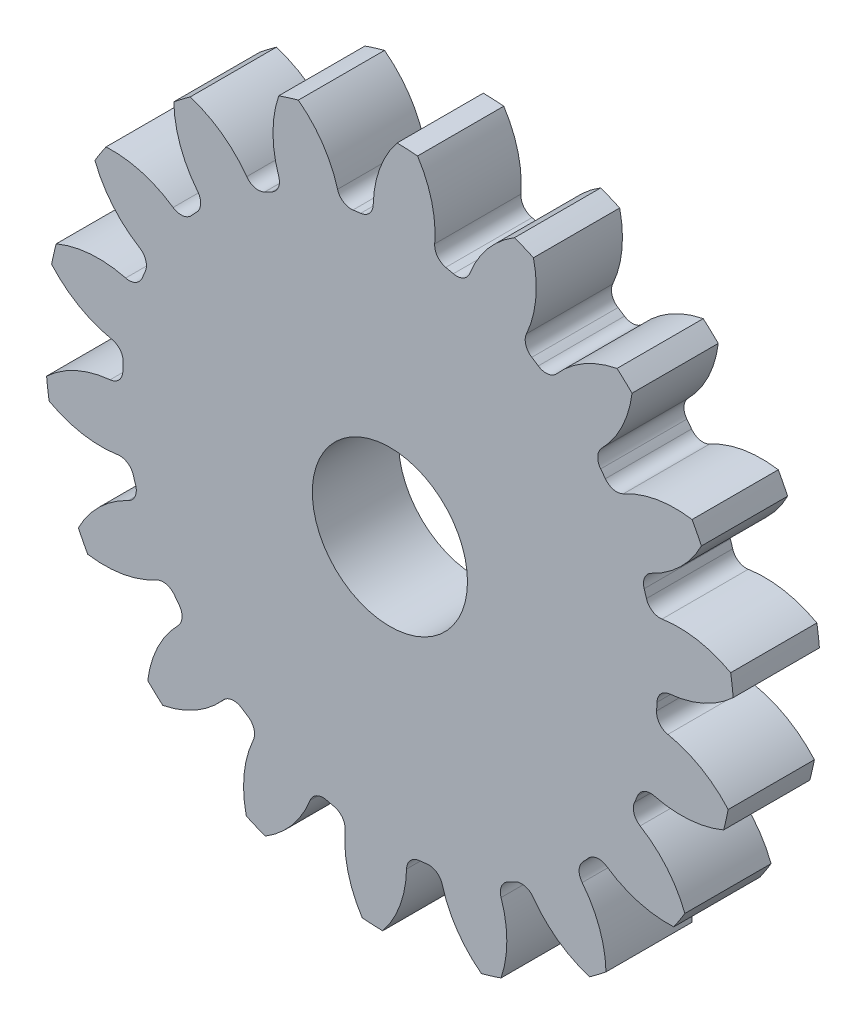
ISO-10303-21;
HEADER;
FILE_DESCRIPTION(('STEP AP214'),'2;1');
FILE_NAME('part.step','',(''),(''),'','','');
FILE_SCHEMA(('AUTOMOTIVE_DESIGN { 1 0 10303 214 1 1 1 1 }'));
ENDSEC;
DATA;
#1=APPLICATION_CONTEXT('core data for automotive mechanical design processes');
#2=APPLICATION_PROTOCOL_DEFINITION('international standard','automotive_design',2000,#1);
#3=PRODUCT_CONTEXT('',#1,'mechanical');
#4=PRODUCT('Part','Part','',(#3));
#5=PRODUCT_RELATED_PRODUCT_CATEGORY('part','',(#4));
#6=PRODUCT_DEFINITION_FORMATION('','',#4);
#7=PRODUCT_DEFINITION_CONTEXT('part definition',#1,'design');
#8=PRODUCT_DEFINITION('design','',#6,#7);
#9=PRODUCT_DEFINITION_SHAPE('','',#8);
#10=(LENGTH_UNIT() NAMED_UNIT(*) SI_UNIT(.MILLI.,.METRE.));
#11=(NAMED_UNIT(*) PLANE_ANGLE_UNIT() SI_UNIT($,.RADIAN.));
#12=(NAMED_UNIT(*) SI_UNIT($,.STERADIAN.) SOLID_ANGLE_UNIT());
#13=UNCERTAINTY_MEASURE_WITH_UNIT(LENGTH_MEASURE(1.E-05),#10,'distance_accuracy_value','');
#14=(GEOMETRIC_REPRESENTATION_CONTEXT(3) GLOBAL_UNCERTAINTY_ASSIGNED_CONTEXT((#13)) GLOBAL_UNIT_ASSIGNED_CONTEXT((#10,
#11,#12)) REPRESENTATION_CONTEXT('',''));
#15=CARTESIAN_POINT('',(0.,0.,0.));
#16=DIRECTION('',(0.,0.,1.));
#17=DIRECTION('',(1.,0.,0.));
#18=AXIS2_PLACEMENT_3D('',#15,#16,#17);
#19=CARTESIAN_POINT('',(0.,0.,127.));
#20=DIRECTION('',(0.,0.,-1.));
#21=DIRECTION('',(-1.,0.,0.));
#22=AXIS2_PLACEMENT_3D('',#19,#20,#21);
#23=CYLINDRICAL_SURFACE('',#22,508.);
#24=DIRECTION('',(0.,0.,-1.));
#25=VECTOR('',#24,1.);
#26=CARTESIAN_POINT('',(502.016231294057,77.7412600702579,63.5));
#27=LINE('',#26,#25);
#28=CARTESIAN_POINT('',(502.016231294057,77.7412600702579,127.));
#29=VERTEX_POINT('',#28);
#30=CARTESIAN_POINT('',(502.016231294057,77.7412600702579,0.));
#31=VERTEX_POINT('',#30);
#32=EDGE_CURVE('E744',#29,#31,#27,.T.);
#33=ORIENTED_EDGE('',*,*,#32,.F.);
#34=CARTESIAN_POINT('',(0.,0.,127.));
#35=DIRECTION('',(0.,0.,1.));
#36=DIRECTION('',(1.,0.,0.));
#37=AXIS2_PLACEMENT_3D('',#34,#35,#36);
#38=CIRCLE('',#37,508.);
#39=CARTESIAN_POINT('',(505.748302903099,47.7771295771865,127.));
#40=VERTEX_POINT('',#39);
#41=EDGE_CURVE('E1389',#40,#29,#38,.T.);
#42=ORIENTED_EDGE('',*,*,#41,.F.);
#43=DIRECTION('',(0.,0.,-1.));
#44=VECTOR('',#43,1.);
#45=CARTESIAN_POINT('',(505.748302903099,47.7771295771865,63.5));
#46=LINE('',#45,#44);
#47=CARTESIAN_POINT('',(505.748302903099,47.7771295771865,0.));
#48=VERTEX_POINT('',#47);
#49=EDGE_CURVE('E1383',#48,#40,#46,.F.);
#50=ORIENTED_EDGE('',*,*,#49,.F.);
#51=CARTESIAN_POINT('',(0.,0.,0.));
#52=DIRECTION('',(0.,0.,1.));
#53=DIRECTION('',(1.,0.,0.));
#54=AXIS2_PLACEMENT_3D('',#51,#52,#53);
#55=CIRCLE('',#54,508.);
#56=EDGE_CURVE('E1394',#48,#31,#55,.T.);
#57=ORIENTED_EDGE('',*,*,#56,.T.);
#58=EDGE_LOOP('',(#33,#42,#50,#57));
#59=FACE_BOUND('',#58,.T.);
#60=ADVANCED_FACE('F33',(#59),#23,.T.);
#61=DIRECTION('',(0.,0.,-1.));
#62=VECTOR('',#61,1.);
#63=CARTESIAN_POINT('',(458.907207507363,217.87192315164,63.5));
#64=LINE('',#63,#62);
#65=CARTESIAN_POINT('',(458.907207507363,217.87192315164,0.));
#66=VERTEX_POINT('',#65);
#67=CARTESIAN_POINT('',(458.907207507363,217.87192315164,127.));
#68=VERTEX_POINT('',#67);
#69=EDGE_CURVE('E715',#66,#68,#64,.F.);
#70=ORIENTED_EDGE('',*,*,#69,.F.);
#71=CARTESIAN_POINT('',(445.15187115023,244.752551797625,0.));
#72=VERTEX_POINT('',#71);
#73=EDGE_CURVE('E1397',#66,#72,#55,.T.);
#74=ORIENTED_EDGE('',*,*,#73,.T.);
#75=DIRECTION('',(0.,0.,-1.));
#76=VECTOR('',#75,1.);
#77=CARTESIAN_POINT('',(445.15187115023,244.752551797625,63.5));
#78=LINE('',#77,#76);
#79=CARTESIAN_POINT('',(445.15187115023,244.752551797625,127.));
#80=VERTEX_POINT('',#79);
#81=EDGE_CURVE('E777',#80,#72,#78,.T.);
#82=ORIENTED_EDGE('',*,*,#81,.F.);
#83=EDGE_CURVE('E1392',#68,#80,#38,.T.);
#84=ORIENTED_EDGE('',*,*,#83,.F.);
#85=EDGE_LOOP('',(#70,#74,#82,#84));
#86=FACE_BOUND('',#85,.T.);
#87=ADVANCED_FACE('F1601',(#86),#23,.T.);
#88=CARTESIAN_POINT('',(0.,0.,127.));
#89=DIRECTION('',(0.,0.,1.));
#90=DIRECTION('',(1.,0.,0.));
#91=AXIS2_PLACEMENT_3D('',#88,#89,#90);
#92=PLANE('',#91);
#93=CARTESIAN_POINT('',(0.,0.,127.000000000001));
#94=DIRECTION('',(0.,0.,1.));
#95=DIRECTION('',(1.,0.,0.));
#96=AXIS2_PLACEMENT_3D('',#93,#94,#95);
#97=CIRCLE('',#96,114.3);
#98=CARTESIAN_POINT('',(114.3,0.,127.000000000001));
#99=VERTEX_POINT('',#98);
#100=EDGE_CURVE('E732',#99,#99,#97,.T.);
#101=ORIENTED_EDGE('',*,*,#100,.F.);
#102=EDGE_LOOP('',(#101));
#103=FACE_BOUND('',#102,.T.);
#104=ORIENTED_EDGE('',*,*,#41,.T.);
#105=CARTESIAN_POINT('',(425.126813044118,-62.023806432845,127.));
#106=DIRECTION('',(0.,0.,-1.));
#107=DIRECTION('',(0.939692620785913,0.342020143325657,0.));
#108=AXIS2_PLACEMENT_3D('',#105,#106,#107);
#109=CIRCLE('',#108,159.518827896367);
#110=CARTESIAN_POINT('',(400.920821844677,95.6477713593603,127.));
#111=VERTEX_POINT('',#110);
#112=EDGE_CURVE('E724',#111,#29,#109,.T.);
#113=ORIENTED_EDGE('',*,*,#112,.F.);
#114=CARTESIAN_POINT('',(397.783427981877,116.083945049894,127.));
#115=DIRECTION('',(0.,0.,1.));
#116=DIRECTION('',(-0.939692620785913,-0.342020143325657,0.));
#117=AXIS2_PLACEMENT_3D('',#114,#115,#116);
#118=CIRCLE('',#117,20.6756);
#119=CARTESIAN_POINT('',(377.935707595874,110.29184432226,127.));
#120=VERTEX_POINT('',#119);
#121=EDGE_CURVE('E722',#120,#111,#118,.T.);
#122=ORIENTED_EDGE('',*,*,#121,.F.);
#123=CARTESIAN_POINT('',(0.,0.,127.));
#124=DIRECTION('',(0.,0.,-1.));
#125=DIRECTION('',(0.939692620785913,0.342020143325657,0.));
#126=AXIS2_PLACEMENT_3D('',#123,#124,#125);
#127=CIRCLE('',#126,393.7);
#128=CARTESIAN_POINT('',(374.57775432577,121.207243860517,127.));
#129=VERTEX_POINT('',#128);
#130=EDGE_CURVE('E707',#129,#120,#127,.T.);
#131=ORIENTED_EDGE('',*,*,#130,.F.);
#132=CARTESIAN_POINT('',(394.249128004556,127.572579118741,127.));
#133=DIRECTION('',(0.,0.,1.));
#134=DIRECTION('',(-0.939692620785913,-0.342020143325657,0.));
#135=AXIS2_PLACEMENT_3D('',#132,#133,#134);
#136=CIRCLE('',#135,20.6756);
#137=CARTESIAN_POINT('',(385.357365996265,146.238510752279,127.));
#138=VERTEX_POINT('',#137);
#139=EDGE_CURVE('E699',#138,#129,#136,.T.);
#140=ORIENTED_EDGE('',*,*,#139,.F.);
#141=CARTESIAN_POINT('',(316.754594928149,290.252108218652,127.));
#142=DIRECTION('',(0.,0.,-1.));
#143=DIRECTION('',(-0.939692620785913,-0.342020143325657,0.));
#144=AXIS2_PLACEMENT_3D('',#141,#142,#143);
#145=CIRCLE('',#144,159.518827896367);
#146=EDGE_CURVE('E729',#68,#138,#145,.T.);
#147=ORIENTED_EDGE('',*,*,#146,.F.);
#148=ORIENTED_EDGE('',*,*,#83,.T.);
#149=CARTESIAN_POINT('',(420.701920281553,87.1186203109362,127.));
#150=DIRECTION('',(0.,0.,-1.));
#151=DIRECTION('',(0.766044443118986,0.64278760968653,0.));
#152=AXIS2_PLACEMENT_3D('',#149,#150,#151);
#153=CIRCLE('',#152,159.518827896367);
#154=CARTESIAN_POINT('',(344.028873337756,227.00250189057,127.));
#155=VERTEX_POINT('',#154);
#156=EDGE_CURVE('E753',#155,#80,#153,.T.);
#157=ORIENTED_EDGE('',*,*,#156,.F.);
#158=CARTESIAN_POINT('',(334.091104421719,245.13317160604,127.));
#159=DIRECTION('',(0.,0.,1.));
#160=DIRECTION('',(-0.766044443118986,-0.64278760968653,0.));
#161=AXIS2_PLACEMENT_3D('',#158,#159,#160);
#162=CIRCLE('',#161,20.6756);
#163=CARTESIAN_POINT('',(317.421363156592,232.902057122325,127.));
#164=VERTEX_POINT('',#163);
#165=EDGE_CURVE('E751',#164,#155,#162,.T.);
#166=ORIENTED_EDGE('',*,*,#165,.F.);
#167=CARTESIAN_POINT('',(0.,0.,127.));
#168=DIRECTION('',(0.,0.,-1.));
#169=DIRECTION('',(0.766044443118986,0.64278760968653,0.));
#170=AXIS2_PLACEMENT_3D('',#167,#168,#169);
#171=CIRCLE('',#170,393.7);
#172=CARTESIAN_POINT('',(310.5326327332,242.010689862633,127.));
#173=VERTEX_POINT('',#172);
#174=EDGE_CURVE('E748',#173,#164,#171,.T.);
#175=ORIENTED_EDGE('',*,*,#174,.F.);
#176=CARTESIAN_POINT('',(326.840604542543,254.720154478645,127.));
#177=DIRECTION('',(0.,0.,1.));
#178=DIRECTION('',(-0.766044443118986,-0.64278760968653,0.));
#179=AXIS2_PLACEMENT_3D('',#176,#177,#178);
#180=CIRCLE('',#179,20.6756);
#181=CARTESIAN_POINT('',(312.100956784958,269.219230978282,127.));
#182=VERTEX_POINT('',#181);
#183=EDGE_CURVE('E746',#182,#173,#180,.T.);
#184=ORIENTED_EDGE('',*,*,#183,.F.);
#185=CARTESIAN_POINT('',(198.37988780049,381.08421621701,127.));
#186=DIRECTION('',(0.,0.,-1.));
#187=DIRECTION('',(-0.766044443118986,-0.64278760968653,0.));
#188=AXIS2_PLACEMENT_3D('',#185,#186,#187);
#189=CIRCLE('',#188,159.518827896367);
#190=CARTESIAN_POINT('',(356.715130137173,361.688147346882,127.));
#191=VERTEX_POINT('',#190);
#192=EDGE_CURVE('E756',#191,#182,#189,.T.);
#193=ORIENTED_EDGE('',*,*,#192,.F.);
#194=CARTESIAN_POINT('',(334.595625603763,382.243073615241,127.));
#195=VERTEX_POINT('',#194);
#196=EDGE_CURVE('E1441',#191,#195,#38,.T.);
#197=ORIENTED_EDGE('',*,*,#196,.T.);
#198=CARTESIAN_POINT('',(365.534167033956,225.753255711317,127.));
#199=DIRECTION('',(0.,0.,-1.));
#200=DIRECTION('',(0.50000000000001,0.866025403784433,0.));
#201=AXIS2_PLACEMENT_3D('',#198,#199,#200);
#202=CIRCLE('',#201,159.518827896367);
#203=CARTESIAN_POINT('',(245.641965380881,330.977380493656,127.));
#204=VERTEX_POINT('',#203);
#205=EDGE_CURVE('E788',#204,#195,#202,.T.);
#206=ORIENTED_EDGE('',*,*,#205,.F.);
#207=CARTESIAN_POINT('',(230.10246300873,344.615719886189,127.));
#208=DIRECTION('',(0.,0.,1.));
#209=DIRECTION('',(-0.50000000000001,-0.866025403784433,0.));
#210=AXIS2_PLACEMENT_3D('',#207,#208,#209);
#211=CIRCLE('',#210,20.6756);
#212=CARTESIAN_POINT('',(218.621317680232,327.420844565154,127.));
#213=VERTEX_POINT('',#212);
#214=EDGE_CURVE('E786',#213,#204,#211,.T.);
#215=ORIENTED_EDGE('',*,*,#214,.F.);
#216=CARTESIAN_POINT('',(0.,0.,127.));
#217=DIRECTION('',(0.,0.,-1.));
#218=DIRECTION('',(0.50000000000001,0.866025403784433,0.));
#219=AXIS2_PLACEMENT_3D('',#216,#217,#218);
#220=CIRCLE('',#219,393.7);
#221=CARTESIAN_POINT('',(209.032692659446,333.62407496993,127.));
#222=VERTEX_POINT('',#221);
#223=EDGE_CURVE('E783',#222,#213,#220,.T.);
#224=ORIENTED_EDGE('',*,*,#223,.F.);
#225=CARTESIAN_POINT('',(220.01028051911,351.144719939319,127.));
#226=DIRECTION('',(0.,0.,1.));
#227=DIRECTION('',(-0.50000000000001,-0.866025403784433,0.));
#228=AXIS2_PLACEMENT_3D('',#225,#226,#227);
#229=CIRCLE('',#228,20.6756);
#230=CARTESIAN_POINT('',(201.200566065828,359.728138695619,127.));
#231=VERTEX_POINT('',#230);
#232=EDGE_CURVE('E781',#231,#222,#229,.T.);
#233=ORIENTED_EDGE('',*,*,#232,.F.);
#234=CARTESIAN_POINT('',(56.0776384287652,425.951943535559,127.));
#235=DIRECTION('',(0.,0.,-1.));
#236=DIRECTION('',(-0.50000000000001,-0.866025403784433,0.));
#237=AXIS2_PLACEMENT_3D('',#234,#235,#236);
#238=CIRCLE('',#237,159.518827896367);
#239=CARTESIAN_POINT('',(211.49794351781,461.879443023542,127.));
#240=VERTEX_POINT('',#239);
#241=EDGE_CURVE('E791',#240,#231,#238,.T.);
#242=ORIENTED_EDGE('',*,*,#241,.F.);
#243=CARTESIAN_POINT('',(183.682209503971,473.629439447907,127.));
#244=VERTEX_POINT('',#243);
#245=EDGE_CURVE('E1583',#240,#244,#38,.T.);
#246=ORIENTED_EDGE('',*,*,#245,.T.);
#247=CARTESIAN_POINT('',(266.277598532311,337.158716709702,127.));
#248=DIRECTION('',(0.,0.,-1.));
#249=DIRECTION('',(0.17364817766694,0.984807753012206,0.));
#250=AXIS2_PLACEMENT_3D('',#247,#248,#249);
#251=CIRCLE('',#250,159.518827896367);
#252=CARTESIAN_POINT('',(117.627011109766,395.031502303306,127.));
#253=VERTEX_POINT('',#252);
#254=EDGE_CURVE('E826',#253,#244,#251,.T.);
#255=ORIENTED_EDGE('',*,*,#254,.F.);
#256=CARTESIAN_POINT('',(98.3600686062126,402.53252636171,127.));
#257=DIRECTION('',(0.,0.,1.));
#258=DIRECTION('',(-0.17364817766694,-0.984807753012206,0.));
#259=AXIS2_PLACEMENT_3D('',#256,#257,#258);
#260=CIRCLE('',#259,20.6756);
#261=CARTESIAN_POINT('',(93.4523147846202,382.447845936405,127.));
#262=VERTEX_POINT('',#261);
#263=EDGE_CURVE('E824',#262,#253,#260,.T.);
#264=ORIENTED_EDGE('',*,*,#263,.F.);
#265=CARTESIAN_POINT('',(0.,0.,127.));
#266=DIRECTION('',(0.,0.,-1.));
#267=DIRECTION('',(0.17364817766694,0.984807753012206,0.));
#268=AXIS2_PLACEMENT_3D('',#265,#266,#267);
#269=CIRCLE('',#268,393.7);
#270=CARTESIAN_POINT('',(82.3203248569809,384.997472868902,127.));
#271=VERTEX_POINT('',#270);
#272=EDGE_CURVE('E821',#271,#262,#269,.T.);
#273=ORIENTED_EDGE('',*,*,#272,.F.);
#274=CARTESIAN_POINT('',(86.6434696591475,405.216049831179,127.));
#275=DIRECTION('',(0.,0.,1.));
#276=DIRECTION('',(-0.17364817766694,-0.984807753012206,0.));
#277=AXIS2_PLACEMENT_3D('',#274,#275,#276);
#278=CIRCLE('',#277,20.6756);
#279=CARTESIAN_POINT('',(66.0324176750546,406.848523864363,127.));
#280=VERTEX_POINT('',#279);
#281=EDGE_CURVE('E819',#280,#271,#278,.T.);
#282=ORIENTED_EDGE('',*,*,#281,.F.);
#283=CARTESIAN_POINT('',(-92.9884017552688,419.443580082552,127.));
#284=DIRECTION('',(0.,0.,-1.));
#285=DIRECTION('',(-0.17364817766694,-0.984807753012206,0.));
#286=AXIS2_PLACEMENT_3D('',#283,#284,#285);
#287=CIRCLE('',#286,159.518827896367);
#288=CARTESIAN_POINT('',(40.7709835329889,506.361261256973,127.));
#289=VERTEX_POINT('',#288);
#290=EDGE_CURVE('E829',#289,#280,#287,.T.);
#291=ORIENTED_EDGE('',*,*,#290,.F.);
#292=CARTESIAN_POINT('',(10.6140080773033,507.889104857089,127.));
#293=VERTEX_POINT('',#292);
#294=EDGE_CURVE('E1579',#289,#293,#38,.T.);
#295=ORIENTED_EDGE('',*,*,#294,.T.);
#296=CARTESIAN_POINT('',(134.904021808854,407.89786054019,127.));
#297=DIRECTION('',(0.,0.,-1.));
#298=DIRECTION('',(-0.173648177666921,0.98480775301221,0.));
#299=AXIS2_PLACEMENT_3D('',#296,#297,#298);
#300=CIRCLE('',#299,159.518827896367);
#301=CARTESIAN_POINT('',(-24.5754966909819,411.438994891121,127.));
#302=VERTEX_POINT('',#301);
#303=EDGE_CURVE('E864',#302,#293,#300,.T.);
#304=ORIENTED_EDGE('',*,*,#303,.F.);
#305=CARTESIAN_POINT('',(-45.2460017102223,411.897969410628,127.));
#306=DIRECTION('',(0.,0.,1.));
#307=DIRECTION('',(0.173648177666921,-0.98480775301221,0.));
#308=AXIS2_PLACEMENT_3D('',#305,#306,#307);
#309=CIRCLE('',#308,20.6756);
#310=CARTESIAN_POINT('',(-42.9884164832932,391.345992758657,127.));
#311=VERTEX_POINT('',#310);
#312=EDGE_CURVE('E862',#311,#302,#309,.T.);
#313=ORIENTED_EDGE('',*,*,#312,.F.);
#314=CARTESIAN_POINT('',(0.,0.,127.));
#315=DIRECTION('',(0.,0.,-1.));
#316=DIRECTION('',(-0.173648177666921,0.98480775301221,0.));
#317=AXIS2_PLACEMENT_3D('',#314,#315,#316);
#318=CIRCLE('',#317,393.7);
#319=CARTESIAN_POINT('',(-54.3210890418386,389.934493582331,127.));
#320=VERTEX_POINT('',#319);
#321=EDGE_CURVE('E859',#320,#311,#318,.T.);
#322=ORIENTED_EDGE('',*,*,#321,.F.);
#323=CARTESIAN_POINT('',(-57.1738223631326,410.412343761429,127.));
#324=DIRECTION('',(0.,0.,1.));
#325=DIRECTION('',(0.173648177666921,-0.98480775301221,0.));
#326=AXIS2_PLACEMENT_3D('',#323,#324,#325);
#327=CIRCLE('',#326,20.6756);
#328=CARTESIAN_POINT('',(-77.1002148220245,404.896972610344,127.));
#329=VERTEX_POINT('',#328);
#330=EDGE_CURVE('E857',#329,#320,#327,.T.);
#331=ORIENTED_EDGE('',*,*,#330,.F.);
#332=CARTESIAN_POINT('',(-230.838668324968,362.344130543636,127.));
#333=DIRECTION('',(0.,0.,-1.));
#334=DIRECTION('',(0.173648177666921,-0.98480775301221,0.));
#335=AXIS2_PLACEMENT_3D('',#332,#333,#334);
#336=CIRCLE('',#335,159.518827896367);
#337=CARTESIAN_POINT('',(-134.873558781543,489.768438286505,127.));
#338=VERTEX_POINT('',#337);
#339=EDGE_CURVE('E867',#338,#329,#336,.T.);
#340=ORIENTED_EDGE('',*,*,#339,.F.);
#341=CARTESIAN_POINT('',(-163.734399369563,480.889848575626,127.));
#342=VERTEX_POINT('',#341);
#343=EDGE_CURVE('E1575',#338,#342,#38,.T.);
#344=ORIENTED_EDGE('',*,*,#343,.T.);
#345=CARTESIAN_POINT('',(-12.7409709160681,429.438502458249,127.));
#346=DIRECTION('',(0.,0.,-1.));
#347=DIRECTION('',(-0.499999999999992,0.866025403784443,0.));
#348=AXIS2_PLACEMENT_3D('',#345,#346,#347);
#349=CIRCLE('',#348,159.518827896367);
#350=CARTESIAN_POINT('',(-163.813836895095,378.220872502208,127.));
#351=VERTEX_POINT('',#350);
#352=EDGE_CURVE('E902',#351,#342,#349,.T.);
#353=ORIENTED_EDGE('',*,*,#352,.F.);
#354=CARTESIAN_POINT('',(-183.394736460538,371.582438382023,127.));
#355=DIRECTION('',(0.,0.,1.));
#356=DIRECTION('',(0.499999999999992,-0.866025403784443,0.));
#357=AXIS2_PLACEMENT_3D('',#354,#355,#356);
#358=CIRCLE('',#357,20.6756);
#359=CARTESIAN_POINT('',(-174.244110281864,353.042037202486,127.));
#360=VERTEX_POINT('',#359);
#361=EDGE_CURVE('E900',#360,#351,#358,.T.);
#362=ORIENTED_EDGE('',*,*,#361,.F.);
#363=CARTESIAN_POINT('',(0.,0.,127.));
#364=DIRECTION('',(0.,0.,-1.));
#365=DIRECTION('',(-0.499999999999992,0.866025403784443,0.));
#366=AXIS2_PLACEMENT_3D('',#363,#364,#365);
#367=CIRCLE('',#366,393.7);
#368=CARTESIAN_POINT('',(-184.410577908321,347.83965954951,127.));
#369=VERTEX_POINT('',#368);
#370=EDGE_CURVE('E897',#369,#360,#367,.T.);
#371=ORIENTED_EDGE('',*,*,#370,.F.);
#372=CARTESIAN_POINT('',(-194.095107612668,366.106851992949,127.));
#373=DIRECTION('',(0.,0.,1.));
#374=DIRECTION('',(0.499999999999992,-0.866025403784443,0.));
#375=AXIS2_PLACEMENT_3D('',#372,#373,#374);
#376=CIRCLE('',#375,20.6756);
#377=CARTESIAN_POINT('',(-210.933423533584,354.108870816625,127.));
#378=VERTEX_POINT('',#377);
#379=EDGE_CURVE('E895',#378,#369,#376,.T.);
#380=ORIENTED_EDGE('',*,*,#379,.F.);
#381=CARTESIAN_POINT('',(-340.846384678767,261.540631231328,127.));
#382=DIRECTION('',(0.,0.,-1.));
#383=DIRECTION('',(0.499999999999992,-0.866025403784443,0.));
#384=AXIS2_PLACEMENT_3D('',#381,#382,#383);
#385=CIRCLE('',#384,159.518827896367);
#386=CARTESIAN_POINT('',(-294.25035938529,414.10231344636,127.));
#387=VERTEX_POINT('',#386);
#388=EDGE_CURVE('E905',#387,#378,#385,.T.);
#389=ORIENTED_EDGE('',*,*,#388,.F.);
#390=CARTESIAN_POINT('',(-318.334021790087,395.888179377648,127.));
#391=VERTEX_POINT('',#390);
#392=EDGE_CURVE('E1571',#387,#391,#38,.T.);
#393=ORIENTED_EDGE('',*,*,#392,.T.);
#394=CARTESIAN_POINT('',(-158.849214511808,399.182523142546,127.));
#395=DIRECTION('',(0.,0.,-1.));
#396=DIRECTION('',(-0.766044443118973,0.642787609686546,0.));
#397=AXIS2_PLACEMENT_3D('',#394,#395,#396);
#398=CIRCLE('',#397,159.518827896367);
#399=CARTESIAN_POINT('',(-283.293810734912,299.383730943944,127.));
#400=VERTEX_POINT('',#399);
#401=EDGE_CURVE('E940',#400,#391,#398,.T.);
#402=ORIENTED_EDGE('',*,*,#401,.F.);
#403=CARTESIAN_POINT('',(-299.423359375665,286.448581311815,127.));
#404=DIRECTION('',(0.,0.,1.));
#405=DIRECTION('',(0.766044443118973,-0.642787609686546,0.));
#406=AXIS2_PLACEMENT_3D('',#403,#404,#405);
#407=CIRCLE('',#406,20.6756);
#408=CARTESIAN_POINT('',(-284.483392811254,272.156001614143,127.));
#409=VERTEX_POINT('',#408);
#410=EDGE_CURVE('E938',#409,#400,#407,.T.);
#411=ORIENTED_EDGE('',*,*,#410,.F.);
#412=CARTESIAN_POINT('',(0.,0.,127.));
#413=DIRECTION('',(0.,0.,-1.));
#414=DIRECTION('',(-0.766044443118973,0.642787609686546,0.));
#415=AXIS2_PLACEMENT_3D('',#412,#413,#414);
#416=CIRCLE('',#415,393.7);
#417=CARTESIAN_POINT('',(-292.257429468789,263.790229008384,127.));
#418=VERTEX_POINT('',#417);
#419=EDGE_CURVE('E935',#418,#409,#416,.T.);
#420=ORIENTED_EDGE('',*,*,#419,.F.);
#421=CARTESIAN_POINT('',(-307.605658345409,277.643470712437,127.));
#422=DIRECTION('',(0.,0.,1.));
#423=DIRECTION('',(0.766044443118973,-0.642787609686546,0.));
#424=AXIS2_PLACEMENT_3D('',#421,#422,#423);
#425=CIRCLE('',#424,20.6756);
#426=CARTESIAN_POINT('',(-319.324948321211,260.610013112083,127.));
#427=VERTEX_POINT('',#426);
#428=EDGE_CURVE('E933',#427,#418,#425,.T.);
#429=ORIENTED_EDGE('',*,*,#428,.F.);
#430=CARTESIAN_POINT('',(-409.742996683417,129.191471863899,127.));
#431=DIRECTION('',(0.,0.,-1.));
#432=DIRECTION('',(0.766044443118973,-0.642787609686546,0.));
#433=AXIS2_PLACEMENT_3D('',#430,#431,#432);
#434=CIRCLE('',#433,159.518827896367);
#435=CARTESIAN_POINT('',(-418.136223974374,288.489338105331,127.));
#436=VERTEX_POINT('',#435);
#437=EDGE_CURVE('E943',#436,#427,#434,.T.);
#438=ORIENTED_EDGE('',*,*,#437,.F.);
#439=CARTESIAN_POINT('',(-434.537863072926,263.136553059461,127.));
#440=VERTEX_POINT('',#439);
#441=EDGE_CURVE('E1567',#436,#440,#38,.T.);
#442=ORIENTED_EDGE('',*,*,#441,.T.);
#443=CARTESIAN_POINT('',(-285.7978984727,320.779240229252,127.));
#444=DIRECTION('',(0.,0.,-1.));
#445=DIRECTION('',(-0.939692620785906,0.342020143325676,0.));
#446=AXIS2_PLACEMENT_3D('',#443,#444,#445);
#447=CIRCLE('',#446,159.518827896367);
#448=CARTESIAN_POINT('',(-368.604370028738,184.436493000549,127.));
#449=VERTEX_POINT('',#448);
#450=EDGE_CURVE('E978',#449,#440,#447,.T.);
#451=ORIENTED_EDGE('',*,*,#450,.F.);
#452=CARTESIAN_POINT('',(-379.337106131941,166.764797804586,127.));
#453=DIRECTION('',(0.,0.,1.));
#454=DIRECTION('',(0.939692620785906,-0.342020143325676,0.));
#455=AXIS2_PLACEMENT_3D('',#452,#453,#454);
#456=CIRCLE('',#455,20.6756);
#457=CARTESIAN_POINT('',(-360.409779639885,158.44393563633,127.));
#458=VERTEX_POINT('',#457);
#459=EDGE_CURVE('E976',#458,#449,#456,.T.);
#460=ORIENTED_EDGE('',*,*,#459,.F.);
#461=CARTESIAN_POINT('',(0.,0.,127.));
#462=DIRECTION('',(0.,0.,-1.));
#463=DIRECTION('',(-0.939692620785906,0.342020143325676,0.));
#464=AXIS2_PLACEMENT_3D('',#461,#462,#463);
#465=CIRCLE('',#464,393.7);
#466=CARTESIAN_POINT('',(-364.853721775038,147.923803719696,127.));
#467=VERTEX_POINT('',#466);
#468=EDGE_CURVE('E973',#467,#458,#465,.T.);
#469=ORIENTED_EDGE('',*,*,#468,.F.);
#470=CARTESIAN_POINT('',(-384.014426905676,155.692189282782,127.));
#471=DIRECTION('',(0.,0.,1.));
#472=DIRECTION('',(0.939692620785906,-0.342020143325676,0.));
#473=AXIS2_PLACEMENT_3D('',#470,#471,#472);
#474=CIRCLE('',#473,20.6756);
#475=CARTESIAN_POINT('',(-389.201171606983,135.67774163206,127.));
#476=VERTEX_POINT('',#475);
#477=EDGE_CURVE('E971',#476,#467,#474,.T.);
#478=ORIENTED_EDGE('',*,*,#477,.F.);
#479=CARTESIAN_POINT('',(-429.218556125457,-18.7400856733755,127.));
#480=DIRECTION('',(0.,0.,-1.));
#481=DIRECTION('',(0.939692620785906,-0.342020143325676,0.));
#482=AXIS2_PLACEMENT_3D('',#479,#480,#481);
#483=CIRCLE('',#482,159.518827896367);
#484=CARTESIAN_POINT('',(-491.588688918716,128.080290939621,127.));
#485=VERTEX_POINT('',#484);
#486=EDGE_CURVE('E981',#485,#476,#483,.T.);
#487=ORIENTED_EDGE('',*,*,#486,.F.);
#488=CARTESIAN_POINT('',(-498.330024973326,98.6467749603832,127.));
#489=VERTEX_POINT('',#488);
#490=EDGE_CURVE('E1563',#485,#489,#38,.T.);
#491=ORIENTED_EDGE('',*,*,#490,.T.);
#492=CARTESIAN_POINT('',(-378.275137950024,203.68524674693,127.));
#493=DIRECTION('',(0.,0.,-1.));
#494=DIRECTION('',(-1.,0.,0.));
#495=AXIS2_PLACEMENT_3D('',#492,#493,#494);
#496=CIRCLE('',#495,159.518827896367);
#497=CARTESIAN_POINT('',(-409.455802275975,47.2434920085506,127.));
#498=VERTEX_POINT('',#497);
#499=EDGE_CURVE('E1016',#498,#489,#496,.T.);
#500=ORIENTED_EDGE('',*,*,#499,.F.);
#501=CARTESIAN_POINT('',(-413.497199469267,26.9667184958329,127.));
#502=DIRECTION('',(0.,0.,1.));
#503=DIRECTION('',(1.,0.,0.));
#504=AXIS2_PLACEMENT_3D('',#501,#502,#503);
#505=CIRCLE('',#504,20.6756);
#506=CARTESIAN_POINT('',(-392.865427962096,25.6211926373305,127.));
#507=VERTEX_POINT('',#506);
#508=EDGE_CURVE('E1014',#507,#498,#505,.T.);
#509=ORIENTED_EDGE('',*,*,#508,.F.);
#510=CARTESIAN_POINT('',(0.,0.,127.));
#511=DIRECTION('',(0.,0.,-1.));
#512=DIRECTION('',(-1.,0.,0.));
#513=AXIS2_PLACEMENT_3D('',#510,#511,#512);
#514=CIRCLE('',#513,393.7);
#515=CARTESIAN_POINT('',(-393.443270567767,14.2155845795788,127.));
#516=VERTEX_POINT('',#515);
#517=EDGE_CURVE('E1011',#516,#507,#514,.T.);
#518=ORIENTED_EDGE('',*,*,#517,.F.);
#519=CARTESIAN_POINT('',(-414.105388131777,14.9621320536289,127.));
#520=DIRECTION('',(0.,0.,1.));
#521=DIRECTION('',(1.,0.,0.));
#522=AXIS2_PLACEMENT_3D('',#519,#520,#521);
#523=CIRCLE('',#522,20.6756);
#524=CARTESIAN_POINT('',(-412.133989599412,-5.61926787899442,127.));
#525=VERTEX_POINT('',#524);
#526=EDGE_CURVE('E1009',#525,#516,#523,.T.);
#527=ORIENTED_EDGE('',*,*,#526,.F.);
#528=CARTESIAN_POINT('',(-396.924023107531,-164.411312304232,127.));
#529=DIRECTION('',(0.,0.,-1.));
#530=DIRECTION('',(1.,0.,0.));
#531=AXIS2_PLACEMENT_3D('',#528,#529,#530);
#532=CIRCLE('',#531,159.518827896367);
#533=CARTESIAN_POINT('',(-505.748302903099,-47.777129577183,127.));
#534=VERTEX_POINT('',#533);
#535=EDGE_CURVE('E1019',#534,#525,#532,.T.);
#536=ORIENTED_EDGE('',*,*,#535,.F.);
#537=CARTESIAN_POINT('',(-502.016231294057,-77.7412600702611,127.));
#538=VERTEX_POINT('',#537);
#539=EDGE_CURVE('E1559',#534,#538,#38,.T.);
#540=ORIENTED_EDGE('',*,*,#539,.T.);
#541=CARTESIAN_POINT('',(-425.126813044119,62.0238064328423,127.));
#542=DIRECTION('',(0.,0.,-1.));
#543=DIRECTION('',(-0.939692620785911,-0.342020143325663,0.));
#544=AXIS2_PLACEMENT_3D('',#541,#542,#543);
#545=CIRCLE('',#544,159.518827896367);
#546=CARTESIAN_POINT('',(-400.920821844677,-95.6477713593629,127.));
#547=VERTEX_POINT('',#546);
#548=EDGE_CURVE('E1054',#547,#538,#545,.T.);
#549=ORIENTED_EDGE('',*,*,#548,.F.);
#550=CARTESIAN_POINT('',(-397.783427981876,-116.083945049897,127.));
#551=DIRECTION('',(0.,0.,1.));
#552=DIRECTION('',(0.939692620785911,0.342020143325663,0.));
#553=AXIS2_PLACEMENT_3D('',#550,#551,#552);
#554=CIRCLE('',#553,20.6756);
#555=CARTESIAN_POINT('',(-377.935707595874,-110.291844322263,127.));
#556=VERTEX_POINT('',#555);
#557=EDGE_CURVE('E1052',#556,#547,#554,.T.);
#558=ORIENTED_EDGE('',*,*,#557,.F.);
#559=CARTESIAN_POINT('',(0.,0.,127.));
#560=DIRECTION('',(0.,0.,-1.));
#561=DIRECTION('',(-0.939692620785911,-0.342020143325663,0.));
#562=AXIS2_PLACEMENT_3D('',#559,#560,#561);
#563=CIRCLE('',#562,393.7);
#564=CARTESIAN_POINT('',(-374.577754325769,-121.20724386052,127.));
#565=VERTEX_POINT('',#564);
#566=EDGE_CURVE('E1049',#565,#556,#563,.T.);
#567=ORIENTED_EDGE('',*,*,#566,.F.);
#568=CARTESIAN_POINT('',(-394.249128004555,-127.572579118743,127.));
#569=DIRECTION('',(0.,0.,1.));
#570=DIRECTION('',(0.939692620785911,0.342020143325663,0.));
#571=AXIS2_PLACEMENT_3D('',#568,#569,#570);
#572=CIRCLE('',#571,20.6756);
#573=CARTESIAN_POINT('',(-385.357365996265,-146.238510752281,127.));
#574=VERTEX_POINT('',#573);
#575=EDGE_CURVE('E1047',#574,#565,#572,.T.);
#576=ORIENTED_EDGE('',*,*,#575,.F.);
#577=CARTESIAN_POINT('',(-316.754594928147,-290.252108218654,127.));
#578=DIRECTION('',(0.,0.,-1.));
#579=DIRECTION('',(0.939692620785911,0.342020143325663,0.));
#580=AXIS2_PLACEMENT_3D('',#577,#578,#579);
#581=CIRCLE('',#580,159.518827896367);
#582=CARTESIAN_POINT('',(-458.907207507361,-217.871923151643,127.));
#583=VERTEX_POINT('',#582);
#584=EDGE_CURVE('E1057',#583,#574,#581,.T.);
#585=ORIENTED_EDGE('',*,*,#584,.F.);
#586=CARTESIAN_POINT('',(-445.151871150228,-244.752551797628,127.));
#587=VERTEX_POINT('',#586);
#588=EDGE_CURVE('E1555',#583,#587,#38,.T.);
#589=ORIENTED_EDGE('',*,*,#588,.T.);
#590=CARTESIAN_POINT('',(-420.701920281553,-87.1186203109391,127.));
#591=DIRECTION('',(0.,0.,-1.));
#592=DIRECTION('',(-0.766044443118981,-0.642787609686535,0.));
#593=AXIS2_PLACEMENT_3D('',#590,#591,#592);
#594=CIRCLE('',#593,159.518827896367);
#595=CARTESIAN_POINT('',(-344.028873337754,-227.002501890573,127.));
#596=VERTEX_POINT('',#595);
#597=EDGE_CURVE('E1092',#596,#587,#594,.T.);
#598=ORIENTED_EDGE('',*,*,#597,.F.);
#599=CARTESIAN_POINT('',(-334.091104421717,-245.133171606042,127.));
#600=DIRECTION('',(0.,0.,1.));
#601=DIRECTION('',(0.766044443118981,0.642787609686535,0.));
#602=AXIS2_PLACEMENT_3D('',#599,#600,#601);
#603=CIRCLE('',#602,20.6756);
#604=CARTESIAN_POINT('',(-317.42136315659,-232.902057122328,127.));
#605=VERTEX_POINT('',#604);
#606=EDGE_CURVE('E1090',#605,#596,#603,.T.);
#607=ORIENTED_EDGE('',*,*,#606,.F.);
#608=CARTESIAN_POINT('',(0.,0.,127.));
#609=DIRECTION('',(0.,0.,-1.));
#610=DIRECTION('',(-0.766044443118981,-0.642787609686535,0.));
#611=AXIS2_PLACEMENT_3D('',#608,#609,#610);
#612=CIRCLE('',#611,393.7);
#613=CARTESIAN_POINT('',(-310.532632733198,-242.010689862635,127.));
#614=VERTEX_POINT('',#613);
#615=EDGE_CURVE('E1087',#614,#605,#612,.T.);
#616=ORIENTED_EDGE('',*,*,#615,.F.);
#617=CARTESIAN_POINT('',(-326.840604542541,-254.720154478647,127.));
#618=DIRECTION('',(0.,0.,1.));
#619=DIRECTION('',(0.766044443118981,0.642787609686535,0.));
#620=AXIS2_PLACEMENT_3D('',#617,#618,#619);
#621=CIRCLE('',#620,20.6756);
#622=CARTESIAN_POINT('',(-312.100956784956,-269.219230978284,127.));
#623=VERTEX_POINT('',#622);
#624=EDGE_CURVE('E1085',#623,#614,#621,.T.);
#625=ORIENTED_EDGE('',*,*,#624,.F.);
#626=CARTESIAN_POINT('',(-198.379887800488,-381.084216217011,127.));
#627=DIRECTION('',(0.,0.,-1.));
#628=DIRECTION('',(0.766044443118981,0.642787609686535,0.));
#629=AXIS2_PLACEMENT_3D('',#626,#627,#628);
#630=CIRCLE('',#629,159.518827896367);
#631=CARTESIAN_POINT('',(-356.715130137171,-361.688147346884,127.));
#632=VERTEX_POINT('',#631);
#633=EDGE_CURVE('E1095',#632,#623,#630,.T.);
#634=ORIENTED_EDGE('',*,*,#633,.F.);
#635=CARTESIAN_POINT('',(-334.59562560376,-382.243073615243,127.));
#636=VERTEX_POINT('',#635);
#637=EDGE_CURVE('E1551',#632,#636,#38,.T.);
#638=ORIENTED_EDGE('',*,*,#637,.T.);
#639=CARTESIAN_POINT('',(-365.534167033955,-225.75325571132,127.));
#640=DIRECTION('',(0.,0.,-1.));
#641=DIRECTION('',(-0.500000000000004,-0.866025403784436,0.));
#642=AXIS2_PLACEMENT_3D('',#639,#640,#641);
#643=CIRCLE('',#642,159.518827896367);
#644=CARTESIAN_POINT('',(-245.641965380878,-330.977380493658,127.));
#645=VERTEX_POINT('',#644);
#646=EDGE_CURVE('E1130',#645,#636,#643,.T.);
#647=ORIENTED_EDGE('',*,*,#646,.F.);
#648=CARTESIAN_POINT('',(-230.102463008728,-344.61571988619,127.));
#649=DIRECTION('',(0.,0.,1.));
#650=DIRECTION('',(0.500000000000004,0.866025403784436,0.));
#651=AXIS2_PLACEMENT_3D('',#648,#649,#650);
#652=CIRCLE('',#651,20.6756);
#653=CARTESIAN_POINT('',(-218.62131768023,-327.420844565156,127.));
#654=VERTEX_POINT('',#653);
#655=EDGE_CURVE('E1128',#654,#645,#652,.T.);
#656=ORIENTED_EDGE('',*,*,#655,.F.);
#657=CARTESIAN_POINT('',(0.,0.,127.));
#658=DIRECTION('',(0.,0.,-1.));
#659=DIRECTION('',(-0.500000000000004,-0.866025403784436,0.));
#660=AXIS2_PLACEMENT_3D('',#657,#658,#659);
#661=CIRCLE('',#660,393.7);
#662=CARTESIAN_POINT('',(-209.032692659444,-333.624074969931,127.));
#663=VERTEX_POINT('',#662);
#664=EDGE_CURVE('E1125',#663,#654,#661,.T.);
#665=ORIENTED_EDGE('',*,*,#664,.F.);
#666=CARTESIAN_POINT('',(-220.010280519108,-351.14471993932,127.));
#667=DIRECTION('',(0.,0.,1.));
#668=DIRECTION('',(0.500000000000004,0.866025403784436,0.));
#669=AXIS2_PLACEMENT_3D('',#666,#667,#668);
#670=CIRCLE('',#669,20.6756);
#671=CARTESIAN_POINT('',(-201.200566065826,-359.72813869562,127.));
#672=VERTEX_POINT('',#671);
#673=EDGE_CURVE('E1123',#672,#663,#670,.T.);
#674=ORIENTED_EDGE('',*,*,#673,.F.);
#675=CARTESIAN_POINT('',(-56.0776384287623,-425.95194353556,127.));
#676=DIRECTION('',(0.,0.,-1.));
#677=DIRECTION('',(0.500000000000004,0.866025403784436,0.));
#678=AXIS2_PLACEMENT_3D('',#675,#676,#677);
#679=CIRCLE('',#678,159.518827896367);
#680=CARTESIAN_POINT('',(-211.497943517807,-461.879443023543,127.));
#681=VERTEX_POINT('',#680);
#682=EDGE_CURVE('E1133',#681,#672,#679,.T.);
#683=ORIENTED_EDGE('',*,*,#682,.F.);
#684=CARTESIAN_POINT('',(-183.682209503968,-473.629439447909,127.));
#685=VERTEX_POINT('',#684);
#686=EDGE_CURVE('E1547',#681,#685,#38,.T.);
#687=ORIENTED_EDGE('',*,*,#686,.T.);
#688=CARTESIAN_POINT('',(-266.277598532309,-337.158716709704,127.));
#689=DIRECTION('',(0.,0.,-1.));
#690=DIRECTION('',(-0.173648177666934,-0.984807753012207,0.));
#691=AXIS2_PLACEMENT_3D('',#688,#689,#690);
#692=CIRCLE('',#691,159.518827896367);
#693=CARTESIAN_POINT('',(-117.627011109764,-395.031502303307,127.));
#694=VERTEX_POINT('',#693);
#695=EDGE_CURVE('E1168',#694,#685,#692,.T.);
#696=ORIENTED_EDGE('',*,*,#695,.F.);
#697=CARTESIAN_POINT('',(-98.3600686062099,-402.532526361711,127.));
#698=DIRECTION('',(0.,0.,1.));
#699=DIRECTION('',(0.173648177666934,0.984807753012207,0.));
#700=AXIS2_PLACEMENT_3D('',#697,#698,#699);
#701=CIRCLE('',#700,20.6756);
#702=CARTESIAN_POINT('',(-93.4523147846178,-382.447845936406,127.));
#703=VERTEX_POINT('',#702);
#704=EDGE_CURVE('E1166',#703,#694,#701,.T.);
#705=ORIENTED_EDGE('',*,*,#704,.F.);
#706=CARTESIAN_POINT('',(0.,0.,127.));
#707=DIRECTION('',(0.,0.,-1.));
#708=DIRECTION('',(-0.173648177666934,-0.984807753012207,0.));
#709=AXIS2_PLACEMENT_3D('',#706,#707,#708);
#710=CIRCLE('',#709,393.7);
#711=CARTESIAN_POINT('',(-82.3203248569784,-384.997472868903,127.));
#712=VERTEX_POINT('',#711);
#713=EDGE_CURVE('E1163',#712,#703,#710,.T.);
#714=ORIENTED_EDGE('',*,*,#713,.F.);
#715=CARTESIAN_POINT('',(-86.6434696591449,-405.216049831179,127.));
#716=DIRECTION('',(0.,0.,1.));
#717=DIRECTION('',(0.173648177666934,0.984807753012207,0.));
#718=AXIS2_PLACEMENT_3D('',#715,#716,#717);
#719=CIRCLE('',#718,20.6756);
#720=CARTESIAN_POINT('',(-66.032417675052,-406.848523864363,127.));
#721=VERTEX_POINT('',#720);
#722=EDGE_CURVE('E1161',#721,#712,#719,.T.);
#723=ORIENTED_EDGE('',*,*,#722,.F.);
#724=CARTESIAN_POINT('',(92.9884017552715,-419.443580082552,127.));
#725=DIRECTION('',(0.,0.,-1.));
#726=DIRECTION('',(0.173648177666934,0.984807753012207,0.));
#727=AXIS2_PLACEMENT_3D('',#724,#725,#726);
#728=CIRCLE('',#727,159.518827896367);
#729=CARTESIAN_POINT('',(-40.7709835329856,-506.361261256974,127.));
#730=VERTEX_POINT('',#729);
#731=EDGE_CURVE('E1171',#730,#721,#728,.T.);
#732=ORIENTED_EDGE('',*,*,#731,.F.);
#733=CARTESIAN_POINT('',(-10.6140080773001,-507.889104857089,127.));
#734=VERTEX_POINT('',#733);
#735=EDGE_CURVE('E1543',#730,#734,#38,.T.);
#736=ORIENTED_EDGE('',*,*,#735,.T.);
#737=CARTESIAN_POINT('',(-134.904021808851,-407.89786054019,127.));
#738=DIRECTION('',(0.,0.,-1.));
#739=DIRECTION('',(0.173648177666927,-0.984807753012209,0.));
#740=AXIS2_PLACEMENT_3D('',#737,#738,#739);
#741=CIRCLE('',#740,159.518827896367);
#742=CARTESIAN_POINT('',(24.5754966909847,-411.43899489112,127.));
#743=VERTEX_POINT('',#742);
#744=EDGE_CURVE('E1206',#743,#734,#741,.T.);
#745=ORIENTED_EDGE('',*,*,#744,.F.);
#746=CARTESIAN_POINT('',(45.2460017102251,-411.897969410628,127.));
#747=DIRECTION('',(0.,0.,1.));
#748=DIRECTION('',(-0.173648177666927,0.984807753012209,0.));
#749=AXIS2_PLACEMENT_3D('',#746,#747,#748);
#750=CIRCLE('',#749,20.6756);
#751=CARTESIAN_POINT('',(42.9884164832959,-391.345992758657,127.));
#752=VERTEX_POINT('',#751);
#753=EDGE_CURVE('E1204',#752,#743,#750,.T.);
#754=ORIENTED_EDGE('',*,*,#753,.F.);
#755=CARTESIAN_POINT('',(0.,0.,127.));
#756=DIRECTION('',(0.,0.,-1.));
#757=DIRECTION('',(0.173648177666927,-0.984807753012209,0.));
#758=AXIS2_PLACEMENT_3D('',#755,#756,#757);
#759=CIRCLE('',#758,393.7);
#760=CARTESIAN_POINT('',(54.3210890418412,-389.93449358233,127.));
#761=VERTEX_POINT('',#760);
#762=EDGE_CURVE('E1201',#761,#752,#759,.T.);
#763=ORIENTED_EDGE('',*,*,#762,.F.);
#764=CARTESIAN_POINT('',(57.1738223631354,-410.412343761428,127.));
#765=DIRECTION('',(0.,0.,1.));
#766=DIRECTION('',(-0.173648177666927,0.984807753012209,0.));
#767=AXIS2_PLACEMENT_3D('',#764,#765,#766);
#768=CIRCLE('',#767,20.6756);
#769=CARTESIAN_POINT('',(77.1002148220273,-404.896972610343,127.));
#770=VERTEX_POINT('',#769);
#771=EDGE_CURVE('E1199',#770,#761,#768,.T.);
#772=ORIENTED_EDGE('',*,*,#771,.F.);
#773=CARTESIAN_POINT('',(230.83866832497,-362.344130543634,127.));
#774=DIRECTION('',(0.,0.,-1.));
#775=DIRECTION('',(-0.173648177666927,0.984807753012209,0.));
#776=AXIS2_PLACEMENT_3D('',#773,#774,#775);
#777=CIRCLE('',#776,159.518827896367);
#778=CARTESIAN_POINT('',(134.873558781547,-489.768438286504,127.));
#779=VERTEX_POINT('',#778);
#780=EDGE_CURVE('E1209',#779,#770,#777,.T.);
#781=ORIENTED_EDGE('',*,*,#780,.F.);
#782=CARTESIAN_POINT('',(163.734399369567,-480.889848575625,127.));
#783=VERTEX_POINT('',#782);
#784=EDGE_CURVE('E1539',#779,#783,#38,.T.);
#785=ORIENTED_EDGE('',*,*,#784,.T.);
#786=CARTESIAN_POINT('',(12.7409709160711,-429.438502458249,127.));
#787=DIRECTION('',(0.,0.,-1.));
#788=DIRECTION('',(0.499999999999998,-0.86602540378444,0.));
#789=AXIS2_PLACEMENT_3D('',#786,#787,#788);
#790=CIRCLE('',#789,159.518827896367);
#791=CARTESIAN_POINT('',(163.813836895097,-378.220872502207,127.));
#792=VERTEX_POINT('',#791);
#793=EDGE_CURVE('E1244',#792,#783,#790,.T.);
#794=ORIENTED_EDGE('',*,*,#793,.F.);
#795=CARTESIAN_POINT('',(183.39473646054,-371.582438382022,127.));
#796=DIRECTION('',(0.,0.,1.));
#797=DIRECTION('',(-0.499999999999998,0.86602540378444,0.));
#798=AXIS2_PLACEMENT_3D('',#795,#796,#797);
#799=CIRCLE('',#798,20.6756);
#800=CARTESIAN_POINT('',(174.244110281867,-353.042037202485,127.));
#801=VERTEX_POINT('',#800);
#802=EDGE_CURVE('E1242',#801,#792,#799,.T.);
#803=ORIENTED_EDGE('',*,*,#802,.F.);
#804=CARTESIAN_POINT('',(0.,0.,127.));
#805=DIRECTION('',(0.,0.,-1.));
#806=DIRECTION('',(0.499999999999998,-0.86602540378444,0.));
#807=AXIS2_PLACEMENT_3D('',#804,#805,#806);
#808=CIRCLE('',#807,393.7);
#809=CARTESIAN_POINT('',(184.410577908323,-347.839659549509,127.));
#810=VERTEX_POINT('',#809);
#811=EDGE_CURVE('E1239',#810,#801,#808,.T.);
#812=ORIENTED_EDGE('',*,*,#811,.F.);
#813=CARTESIAN_POINT('',(194.09510761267,-366.106851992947,127.));
#814=DIRECTION('',(0.,0.,1.));
#815=DIRECTION('',(-0.499999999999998,0.86602540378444,0.));
#816=AXIS2_PLACEMENT_3D('',#813,#814,#815);
#817=CIRCLE('',#816,20.6756);
#818=CARTESIAN_POINT('',(210.933423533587,-354.108870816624,127.));
#819=VERTEX_POINT('',#818);
#820=EDGE_CURVE('E1237',#819,#810,#817,.T.);
#821=ORIENTED_EDGE('',*,*,#820,.F.);
#822=CARTESIAN_POINT('',(340.846384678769,-261.540631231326,127.));
#823=DIRECTION('',(0.,0.,-1.));
#824=DIRECTION('',(-0.499999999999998,0.86602540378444,0.));
#825=AXIS2_PLACEMENT_3D('',#822,#823,#824);
#826=CIRCLE('',#825,159.518827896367);
#827=CARTESIAN_POINT('',(294.250359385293,-414.102313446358,127.));
#828=VERTEX_POINT('',#827);
#829=EDGE_CURVE('E1247',#828,#819,#826,.T.);
#830=ORIENTED_EDGE('',*,*,#829,.F.);
#831=CARTESIAN_POINT('',(318.334021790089,-395.888179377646,127.));
#832=VERTEX_POINT('',#831);
#833=EDGE_CURVE('E1535',#828,#832,#38,.T.);
#834=ORIENTED_EDGE('',*,*,#833,.T.);
#835=CARTESIAN_POINT('',(158.849214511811,-399.182523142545,127.));
#836=DIRECTION('',(0.,0.,-1.));
#837=DIRECTION('',(0.766044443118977,-0.642787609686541,0.));
#838=AXIS2_PLACEMENT_3D('',#835,#836,#837);
#839=CIRCLE('',#838,159.518827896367);
#840=CARTESIAN_POINT('',(283.293810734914,-299.383730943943,127.));
#841=VERTEX_POINT('',#840);
#842=EDGE_CURVE('E1282',#841,#832,#839,.T.);
#843=ORIENTED_EDGE('',*,*,#842,.F.);
#844=CARTESIAN_POINT('',(299.423359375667,-286.448581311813,127.));
#845=DIRECTION('',(0.,0.,1.));
#846=DIRECTION('',(-0.766044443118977,0.642787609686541,0.));
#847=AXIS2_PLACEMENT_3D('',#844,#845,#846);
#848=CIRCLE('',#847,20.6756);
#849=CARTESIAN_POINT('',(284.483392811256,-272.156001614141,127.));
#850=VERTEX_POINT('',#849);
#851=EDGE_CURVE('E1280',#850,#841,#848,.T.);
#852=ORIENTED_EDGE('',*,*,#851,.F.);
#853=CARTESIAN_POINT('',(0.,0.,127.));
#854=DIRECTION('',(0.,0.,-1.));
#855=DIRECTION('',(0.766044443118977,-0.642787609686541,0.));
#856=AXIS2_PLACEMENT_3D('',#853,#854,#855);
#857=CIRCLE('',#856,393.7);
#858=CARTESIAN_POINT('',(292.257429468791,-263.790229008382,127.));
#859=VERTEX_POINT('',#858);
#860=EDGE_CURVE('E1277',#859,#850,#857,.T.);
#861=ORIENTED_EDGE('',*,*,#860,.F.);
#862=CARTESIAN_POINT('',(307.605658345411,-277.643470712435,127.));
#863=DIRECTION('',(0.,0.,1.));
#864=DIRECTION('',(-0.766044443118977,0.642787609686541,0.));
#865=AXIS2_PLACEMENT_3D('',#862,#863,#864);
#866=CIRCLE('',#865,20.6756);
#867=CARTESIAN_POINT('',(319.324948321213,-260.610013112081,127.));
#868=VERTEX_POINT('',#867);
#869=EDGE_CURVE('E1275',#868,#859,#866,.T.);
#870=ORIENTED_EDGE('',*,*,#869,.F.);
#871=CARTESIAN_POINT('',(409.742996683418,-129.191471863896,127.));
#872=DIRECTION('',(0.,0.,-1.));
#873=DIRECTION('',(-0.766044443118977,0.642787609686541,0.));
#874=AXIS2_PLACEMENT_3D('',#871,#872,#873);
#875=CIRCLE('',#874,159.518827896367);
#876=CARTESIAN_POINT('',(418.136223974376,-288.489338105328,127.));
#877=VERTEX_POINT('',#876);
#878=EDGE_CURVE('E1285',#877,#868,#875,.T.);
#879=ORIENTED_EDGE('',*,*,#878,.F.);
#880=CARTESIAN_POINT('',(434.537863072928,-263.136553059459,127.));
#881=VERTEX_POINT('',#880);
#882=EDGE_CURVE('E1534',#877,#881,#38,.T.);
#883=ORIENTED_EDGE('',*,*,#882,.T.);
#884=CARTESIAN_POINT('',(285.797898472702,-320.77924022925,127.));
#885=DIRECTION('',(0.,0.,-1.));
#886=DIRECTION('',(0.939692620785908,-0.342020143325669,0.));
#887=AXIS2_PLACEMENT_3D('',#884,#885,#886);
#888=CIRCLE('',#887,159.518827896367);
#889=CARTESIAN_POINT('',(368.604370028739,-184.436493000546,127.));
#890=VERTEX_POINT('',#889);
#891=EDGE_CURVE('E1320',#890,#881,#888,.T.);
#892=ORIENTED_EDGE('',*,*,#891,.F.);
#893=CARTESIAN_POINT('',(379.337106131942,-166.764797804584,127.));
#894=DIRECTION('',(0.,0.,1.));
#895=DIRECTION('',(-0.939692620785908,0.342020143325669,0.));
#896=AXIS2_PLACEMENT_3D('',#893,#894,#895);
#897=CIRCLE('',#896,20.6756);
#898=CARTESIAN_POINT('',(360.409779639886,-158.443935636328,127.));
#899=VERTEX_POINT('',#898);
#900=EDGE_CURVE('E1318',#899,#890,#897,.T.);
#901=ORIENTED_EDGE('',*,*,#900,.F.);
#902=CARTESIAN_POINT('',(0.,0.,127.));
#903=DIRECTION('',(0.,0.,-1.));
#904=DIRECTION('',(0.939692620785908,-0.342020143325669,0.));
#905=AXIS2_PLACEMENT_3D('',#902,#903,#904);
#906=CIRCLE('',#905,393.7);
#907=CARTESIAN_POINT('',(364.853721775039,-147.923803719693,127.));
#908=VERTEX_POINT('',#907);
#909=EDGE_CURVE('E1315',#908,#899,#906,.T.);
#910=ORIENTED_EDGE('',*,*,#909,.F.);
#911=CARTESIAN_POINT('',(384.014426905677,-155.692189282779,127.));
#912=DIRECTION('',(0.,0.,1.));
#913=DIRECTION('',(-0.939692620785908,0.342020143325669,0.));
#914=AXIS2_PLACEMENT_3D('',#911,#912,#913);
#915=CIRCLE('',#914,20.6756);
#916=CARTESIAN_POINT('',(389.201171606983,-135.677741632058,127.));
#917=VERTEX_POINT('',#916);
#918=EDGE_CURVE('E1313',#917,#908,#915,.T.);
#919=ORIENTED_EDGE('',*,*,#918,.F.);
#920=CARTESIAN_POINT('',(429.218556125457,18.7400856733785,127.));
#921=DIRECTION('',(0.,0.,-1.));
#922=DIRECTION('',(-0.939692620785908,0.342020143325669,0.));
#923=AXIS2_PLACEMENT_3D('',#920,#921,#922);
#924=CIRCLE('',#923,159.518827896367);
#925=CARTESIAN_POINT('',(491.588688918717,-128.080290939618,127.));
#926=VERTEX_POINT('',#925);
#927=EDGE_CURVE('E1323',#926,#917,#924,.T.);
#928=ORIENTED_EDGE('',*,*,#927,.F.);
#929=CARTESIAN_POINT('',(498.330024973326,-98.6467749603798,127.));
#930=VERTEX_POINT('',#929);
#931=EDGE_CURVE('E1393',#926,#930,#38,.T.);
#932=ORIENTED_EDGE('',*,*,#931,.T.);
#933=CARTESIAN_POINT('',(378.275137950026,-203.685246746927,127.));
#934=DIRECTION('',(0.,0.,-1.));
#935=DIRECTION('',(1.,0.,0.));
#936=AXIS2_PLACEMENT_3D('',#933,#934,#935);
#937=CIRCLE('',#936,159.518827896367);
#938=CARTESIAN_POINT('',(409.455802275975,-47.2434920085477,127.));
#939=VERTEX_POINT('',#938);
#940=EDGE_CURVE('E1358',#939,#930,#937,.T.);
#941=ORIENTED_EDGE('',*,*,#940,.F.);
#942=CARTESIAN_POINT('',(413.497199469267,-26.96671849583,127.));
#943=DIRECTION('',(0.,0.,1.));
#944=DIRECTION('',(-1.,0.,0.));
#945=AXIS2_PLACEMENT_3D('',#942,#943,#944);
#946=CIRCLE('',#945,20.6756);
#947=CARTESIAN_POINT('',(392.865427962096,-25.6211926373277,127.));
#948=VERTEX_POINT('',#947);
#949=EDGE_CURVE('E1356',#948,#939,#946,.T.);
#950=ORIENTED_EDGE('',*,*,#949,.F.);
#951=CARTESIAN_POINT('',(0.,0.,127.));
#952=DIRECTION('',(0.,0.,-1.));
#953=DIRECTION('',(1.,0.,0.));
#954=AXIS2_PLACEMENT_3D('',#951,#952,#953);
#955=CIRCLE('',#954,393.7);
#956=CARTESIAN_POINT('',(393.443270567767,-14.2155845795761,127.));
#957=VERTEX_POINT('',#956);
#958=EDGE_CURVE('E1353',#957,#948,#955,.T.);
#959=ORIENTED_EDGE('',*,*,#958,.F.);
#960=CARTESIAN_POINT('',(414.105388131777,-14.962132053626,127.));
#961=DIRECTION('',(0.,0.,1.));
#962=DIRECTION('',(-1.,0.,0.));
#963=AXIS2_PLACEMENT_3D('',#960,#961,#962);
#964=CIRCLE('',#963,20.6756);
#965=CARTESIAN_POINT('',(412.133989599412,5.6192678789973,127.));
#966=VERTEX_POINT('',#965);
#967=EDGE_CURVE('E1351',#966,#957,#964,.T.);
#968=ORIENTED_EDGE('',*,*,#967,.F.);
#969=CARTESIAN_POINT('',(396.92402310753,164.411312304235,127.));
#970=DIRECTION('',(0.,0.,-1.));
#971=DIRECTION('',(-1.,0.,0.));
#972=AXIS2_PLACEMENT_3D('',#969,#970,#971);
#973=CIRCLE('',#972,159.518827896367);
#974=EDGE_CURVE('E1361',#40,#966,#973,.T.);
#975=ORIENTED_EDGE('',*,*,#974,.F.);
#976=EDGE_LOOP('',(#104,#113,#122,#131,#140,#147,#148,#157,#166,#175,#184,#193,#197,#206,#215,
#224,#233,#242,#246,#255,#264,#273,#282,#291,#295,#304,#313,#322,#331,#340,#344,#353,#362,#371,
#380,#389,#393,#402,#411,#420,#429,#438,#442,#451,#460,#469,#478,#487,#491,#500,#509,#518,#527,
#536,#540,#549,#558,#567,#576,#585,#589,#598,#607,#616,#625,#634,#638,#647,#656,#665,#674,#683,
#687,#696,#705,#714,#723,#732,#736,#745,#754,#763,#772,#781,#785,#794,#803,#812,#821,#830,#834,
#843,#852,#861,#870,#879,#883,#892,#901,#910,#919,#928,#932,#941,#950,#959,#968,#975));
#977=FACE_BOUND('',#976,.T.);
#978=ADVANCED_FACE('F720',(#103,#977),#92,.T.);
#979=CARTESIAN_POINT('',(0.,0.,0.));
#980=DIRECTION('',(0.,0.,1.));
#981=DIRECTION('',(1.,0.,0.));
#982=AXIS2_PLACEMENT_3D('',#979,#980,#981);
#983=PLANE('',#982);
#984=CARTESIAN_POINT('',(0.,0.,0.));
#985=DIRECTION('',(0.,0.,1.));
#986=DIRECTION('',(1.,0.,0.));
#987=AXIS2_PLACEMENT_3D('',#984,#985,#986);
#988=CIRCLE('',#987,114.3);
#989=CARTESIAN_POINT('',(114.3,0.,-1.77635683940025E-12));
#990=VERTEX_POINT('',#989);
#991=EDGE_CURVE('E36',#990,#990,#988,.T.);
#992=ORIENTED_EDGE('',*,*,#991,.T.);
#993=EDGE_LOOP('',(#992));
#994=FACE_BOUND('',#993,.T.);
#995=CARTESIAN_POINT('',(425.126813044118,-62.023806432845,0.));
#996=DIRECTION('',(0.,0.,-1.));
#997=DIRECTION('',(0.939692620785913,0.342020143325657,0.));
#998=AXIS2_PLACEMENT_3D('',#995,#996,#997);
#999=CIRCLE('',#998,159.518827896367);
#1000=CARTESIAN_POINT('',(400.920821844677,95.6477713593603,0.));
#1001=VERTEX_POINT('',#1000);
#1002=EDGE_CURVE('E708',#1001,#31,#999,.T.);
#1003=ORIENTED_EDGE('',*,*,#1002,.T.);
#1004=ORIENTED_EDGE('',*,*,#56,.F.);
#1005=CARTESIAN_POINT('',(396.92402310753,164.411312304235,0.));
#1006=DIRECTION('',(0.,0.,1.));
#1007=DIRECTION('',(1.,0.,0.));
#1008=AXIS2_PLACEMENT_3D('',#1005,#1006,#1007);
#1009=CIRCLE('',#1008,159.518827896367);
#1010=CARTESIAN_POINT('',(412.133989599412,5.6192678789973,0.));
#1011=VERTEX_POINT('',#1010);
#1012=EDGE_CURVE('E1391',#1011,#48,#1009,.T.);
#1013=ORIENTED_EDGE('',*,*,#1012,.F.);
#1014=CARTESIAN_POINT('',(414.105388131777,-14.962132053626,0.));
#1015=DIRECTION('',(0.,0.,1.));
#1016=DIRECTION('',(-1.,0.,0.));
#1017=AXIS2_PLACEMENT_3D('',#1014,#1015,#1016);
#1018=CIRCLE('',#1017,20.6756);
#1019=CARTESIAN_POINT('',(393.443270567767,-14.2155845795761,0.));
#1020=VERTEX_POINT('',#1019);
#1021=EDGE_CURVE('E1350',#1011,#1020,#1018,.T.);
#1022=ORIENTED_EDGE('',*,*,#1021,.T.);
#1023=CARTESIAN_POINT('',(0.,0.,0.));
#1024=DIRECTION('',(0.,0.,-1.));
#1025=DIRECTION('',(1.,0.,0.));
#1026=AXIS2_PLACEMENT_3D('',#1023,#1024,#1025);
#1027=CIRCLE('',#1026,393.7);
#1028=CARTESIAN_POINT('',(392.865427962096,-25.6211926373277,0.));
#1029=VERTEX_POINT('',#1028);
#1030=EDGE_CURVE('E1366',#1020,#1029,#1027,.T.);
#1031=ORIENTED_EDGE('',*,*,#1030,.T.);
#1032=CARTESIAN_POINT('',(413.497199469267,-26.96671849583,0.));
#1033=DIRECTION('',(0.,0.,1.));
#1034=DIRECTION('',(-1.,0.,0.));
#1035=AXIS2_PLACEMENT_3D('',#1032,#1033,#1034);
#1036=CIRCLE('',#1035,20.6756);
#1037=CARTESIAN_POINT('',(409.455802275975,-47.2434920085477,0.));
#1038=VERTEX_POINT('',#1037);
#1039=EDGE_CURVE('E1369',#1029,#1038,#1036,.T.);
#1040=ORIENTED_EDGE('',*,*,#1039,.T.);
#1041=CARTESIAN_POINT('',(378.275137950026,-203.685246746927,0.));
#1042=DIRECTION('',(0.,0.,-1.));
#1043=DIRECTION('',(1.,0.,0.));
#1044=AXIS2_PLACEMENT_3D('',#1041,#1042,#1043);
#1045=CIRCLE('',#1044,159.518827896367);
#1046=CARTESIAN_POINT('',(498.330024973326,-98.6467749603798,0.));
#1047=VERTEX_POINT('',#1046);
#1048=EDGE_CURVE('E1354',#1038,#1047,#1045,.T.);
#1049=ORIENTED_EDGE('',*,*,#1048,.T.);
#1050=CARTESIAN_POINT('',(491.588688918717,-128.080290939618,0.));
#1051=VERTEX_POINT('',#1050);
#1052=EDGE_CURVE('E1388',#1051,#1047,#55,.T.);
#1053=ORIENTED_EDGE('',*,*,#1052,.F.);
#1054=CARTESIAN_POINT('',(429.218556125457,18.7400856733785,0.));
#1055=DIRECTION('',(0.,0.,1.));
#1056=DIRECTION('',(1.,0.,0.));
#1057=AXIS2_PLACEMENT_3D('',#1054,#1055,#1056);
#1058=CIRCLE('',#1057,159.518827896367);
#1059=CARTESIAN_POINT('',(389.201171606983,-135.677741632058,0.));
#1060=VERTEX_POINT('',#1059);
#1061=EDGE_CURVE('E1399',#1060,#1051,#1058,.T.);
#1062=ORIENTED_EDGE('',*,*,#1061,.F.);
#1063=CARTESIAN_POINT('',(384.014426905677,-155.692189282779,0.));
#1064=DIRECTION('',(0.,0.,1.));
#1065=DIRECTION('',(-0.939692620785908,0.342020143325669,0.));
#1066=AXIS2_PLACEMENT_3D('',#1063,#1064,#1065);
#1067=CIRCLE('',#1066,20.6756);
#1068=CARTESIAN_POINT('',(364.853721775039,-147.923803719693,0.));
#1069=VERTEX_POINT('',#1068);
#1070=EDGE_CURVE('E1312',#1060,#1069,#1067,.T.);
#1071=ORIENTED_EDGE('',*,*,#1070,.T.);
#1072=CARTESIAN_POINT('',(0.,0.,0.));
#1073=DIRECTION('',(0.,0.,-1.));
#1074=DIRECTION('',(0.939692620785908,-0.342020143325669,0.));
#1075=AXIS2_PLACEMENT_3D('',#1072,#1073,#1074);
#1076=CIRCLE('',#1075,393.7);
#1077=CARTESIAN_POINT('',(360.409779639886,-158.443935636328,0.));
#1078=VERTEX_POINT('',#1077);
#1079=EDGE_CURVE('E1328',#1069,#1078,#1076,.T.);
#1080=ORIENTED_EDGE('',*,*,#1079,.T.);
#1081=CARTESIAN_POINT('',(379.337106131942,-166.764797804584,0.));
#1082=DIRECTION('',(0.,0.,1.));
#1083=DIRECTION('',(-0.939692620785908,0.342020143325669,0.));
#1084=AXIS2_PLACEMENT_3D('',#1081,#1082,#1083);
#1085=CIRCLE('',#1084,20.6756);
#1086=CARTESIAN_POINT('',(368.604370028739,-184.436493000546,0.));
#1087=VERTEX_POINT('',#1086);
#1088=EDGE_CURVE('E1331',#1078,#1087,#1085,.T.);
#1089=ORIENTED_EDGE('',*,*,#1088,.T.);
#1090=CARTESIAN_POINT('',(285.797898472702,-320.77924022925,0.));
#1091=DIRECTION('',(0.,0.,-1.));
#1092=DIRECTION('',(0.939692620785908,-0.342020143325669,0.));
#1093=AXIS2_PLACEMENT_3D('',#1090,#1091,#1092);
#1094=CIRCLE('',#1093,159.518827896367);
#1095=CARTESIAN_POINT('',(434.537863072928,-263.136553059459,0.));
#1096=VERTEX_POINT('',#1095);
#1097=EDGE_CURVE('E1316',#1087,#1096,#1094,.T.);
#1098=ORIENTED_EDGE('',*,*,#1097,.T.);
#1099=CARTESIAN_POINT('',(418.136223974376,-288.489338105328,0.));
#1100=VERTEX_POINT('',#1099);
#1101=EDGE_CURVE('E1505',#1100,#1096,#55,.T.);
#1102=ORIENTED_EDGE('',*,*,#1101,.F.);
#1103=CARTESIAN_POINT('',(409.742996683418,-129.191471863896,0.));
#1104=DIRECTION('',(0.,0.,1.));
#1105=DIRECTION('',(1.,0.,0.));
#1106=AXIS2_PLACEMENT_3D('',#1103,#1104,#1105);
#1107=CIRCLE('',#1106,159.518827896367);
#1108=CARTESIAN_POINT('',(319.324948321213,-260.610013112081,0.));
#1109=VERTEX_POINT('',#1108);
#1110=EDGE_CURVE('E1401',#1109,#1100,#1107,.T.);
#1111=ORIENTED_EDGE('',*,*,#1110,.F.);
#1112=CARTESIAN_POINT('',(307.605658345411,-277.643470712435,0.));
#1113=DIRECTION('',(0.,0.,1.));
#1114=DIRECTION('',(-0.766044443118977,0.642787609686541,0.));
#1115=AXIS2_PLACEMENT_3D('',#1112,#1113,#1114);
#1116=CIRCLE('',#1115,20.6756);
#1117=CARTESIAN_POINT('',(292.257429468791,-263.790229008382,0.));
#1118=VERTEX_POINT('',#1117);
#1119=EDGE_CURVE('E1274',#1109,#1118,#1116,.T.);
#1120=ORIENTED_EDGE('',*,*,#1119,.T.);
#1121=CARTESIAN_POINT('',(0.,0.,0.));
#1122=DIRECTION('',(0.,0.,-1.));
#1123=DIRECTION('',(0.766044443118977,-0.642787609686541,0.));
#1124=AXIS2_PLACEMENT_3D('',#1121,#1122,#1123);
#1125=CIRCLE('',#1124,393.7);
#1126=CARTESIAN_POINT('',(284.483392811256,-272.156001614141,0.));
#1127=VERTEX_POINT('',#1126);
#1128=EDGE_CURVE('E1290',#1118,#1127,#1125,.T.);
#1129=ORIENTED_EDGE('',*,*,#1128,.T.);
#1130=CARTESIAN_POINT('',(299.423359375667,-286.448581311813,0.));
#1131=DIRECTION('',(0.,0.,1.));
#1132=DIRECTION('',(-0.766044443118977,0.642787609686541,0.));
#1133=AXIS2_PLACEMENT_3D('',#1130,#1131,#1132);
#1134=CIRCLE('',#1133,20.6756);
#1135=CARTESIAN_POINT('',(283.293810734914,-299.383730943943,0.));
#1136=VERTEX_POINT('',#1135);
#1137=EDGE_CURVE('E1293',#1127,#1136,#1134,.T.);
#1138=ORIENTED_EDGE('',*,*,#1137,.T.);
#1139=CARTESIAN_POINT('',(158.849214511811,-399.182523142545,0.));
#1140=DIRECTION('',(0.,0.,-1.));
#1141=DIRECTION('',(0.766044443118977,-0.642787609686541,0.));
#1142=AXIS2_PLACEMENT_3D('',#1139,#1140,#1141);
#1143=CIRCLE('',#1142,159.518827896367);
#1144=CARTESIAN_POINT('',(318.334021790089,-395.888179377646,0.));
#1145=VERTEX_POINT('',#1144);
#1146=EDGE_CURVE('E1278',#1136,#1145,#1143,.T.);
#1147=ORIENTED_EDGE('',*,*,#1146,.T.);
#1148=CARTESIAN_POINT('',(294.250359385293,-414.102313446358,0.));
#1149=VERTEX_POINT('',#1148);
#1150=EDGE_CURVE('E1500',#1149,#1145,#55,.T.);
#1151=ORIENTED_EDGE('',*,*,#1150,.F.);
#1152=CARTESIAN_POINT('',(340.846384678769,-261.540631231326,0.));
#1153=DIRECTION('',(0.,0.,1.));
#1154=DIRECTION('',(1.,0.,0.));
#1155=AXIS2_PLACEMENT_3D('',#1152,#1153,#1154);
#1156=CIRCLE('',#1155,159.518827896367);
#1157=CARTESIAN_POINT('',(210.933423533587,-354.108870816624,0.));
#1158=VERTEX_POINT('',#1157);
#1159=EDGE_CURVE('E1403',#1158,#1149,#1156,.T.);
#1160=ORIENTED_EDGE('',*,*,#1159,.F.);
#1161=CARTESIAN_POINT('',(194.09510761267,-366.106851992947,0.));
#1162=DIRECTION('',(0.,0.,1.));
#1163=DIRECTION('',(-0.499999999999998,0.86602540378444,0.));
#1164=AXIS2_PLACEMENT_3D('',#1161,#1162,#1163);
#1165=CIRCLE('',#1164,20.6756);
#1166=CARTESIAN_POINT('',(184.410577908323,-347.839659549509,0.));
#1167=VERTEX_POINT('',#1166);
#1168=EDGE_CURVE('E1236',#1158,#1167,#1165,.T.);
#1169=ORIENTED_EDGE('',*,*,#1168,.T.);
#1170=CARTESIAN_POINT('',(0.,0.,0.));
#1171=DIRECTION('',(0.,0.,-1.));
#1172=DIRECTION('',(0.499999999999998,-0.86602540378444,0.));
#1173=AXIS2_PLACEMENT_3D('',#1170,#1171,#1172);
#1174=CIRCLE('',#1173,393.7);
#1175=CARTESIAN_POINT('',(174.244110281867,-353.042037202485,0.));
#1176=VERTEX_POINT('',#1175);
#1177=EDGE_CURVE('E1252',#1167,#1176,#1174,.T.);
#1178=ORIENTED_EDGE('',*,*,#1177,.T.);
#1179=CARTESIAN_POINT('',(183.39473646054,-371.582438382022,0.));
#1180=DIRECTION('',(0.,0.,1.));
#1181=DIRECTION('',(-0.499999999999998,0.86602540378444,0.));
#1182=AXIS2_PLACEMENT_3D('',#1179,#1180,#1181);
#1183=CIRCLE('',#1182,20.6756);
#1184=CARTESIAN_POINT('',(163.813836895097,-378.220872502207,0.));
#1185=VERTEX_POINT('',#1184);
#1186=EDGE_CURVE('E1255',#1176,#1185,#1183,.T.);
#1187=ORIENTED_EDGE('',*,*,#1186,.T.);
#1188=CARTESIAN_POINT('',(12.7409709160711,-429.438502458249,0.));
#1189=DIRECTION('',(0.,0.,-1.));
#1190=DIRECTION('',(0.499999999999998,-0.86602540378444,0.));
#1191=AXIS2_PLACEMENT_3D('',#1188,#1189,#1190);
#1192=CIRCLE('',#1191,159.518827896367);
#1193=CARTESIAN_POINT('',(163.734399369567,-480.889848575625,0.));
#1194=VERTEX_POINT('',#1193);
#1195=EDGE_CURVE('E1240',#1185,#1194,#1192,.T.);
#1196=ORIENTED_EDGE('',*,*,#1195,.T.);
#1197=CARTESIAN_POINT('',(134.873558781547,-489.768438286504,0.));
#1198=VERTEX_POINT('',#1197);
#1199=EDGE_CURVE('E1495',#1198,#1194,#55,.T.);
#1200=ORIENTED_EDGE('',*,*,#1199,.F.);
#1201=CARTESIAN_POINT('',(230.83866832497,-362.344130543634,0.));
#1202=DIRECTION('',(0.,0.,1.));
#1203=DIRECTION('',(1.,0.,0.));
#1204=AXIS2_PLACEMENT_3D('',#1201,#1202,#1203);
#1205=CIRCLE('',#1204,159.518827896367);
#1206=CARTESIAN_POINT('',(77.1002148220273,-404.896972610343,0.));
#1207=VERTEX_POINT('',#1206);
#1208=EDGE_CURVE('E1405',#1207,#1198,#1205,.T.);
#1209=ORIENTED_EDGE('',*,*,#1208,.F.);
#1210=CARTESIAN_POINT('',(57.1738223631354,-410.412343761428,0.));
#1211=DIRECTION('',(0.,0.,1.));
#1212=DIRECTION('',(-0.173648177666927,0.984807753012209,0.));
#1213=AXIS2_PLACEMENT_3D('',#1210,#1211,#1212);
#1214=CIRCLE('',#1213,20.6756);
#1215=CARTESIAN_POINT('',(54.3210890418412,-389.93449358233,0.));
#1216=VERTEX_POINT('',#1215);
#1217=EDGE_CURVE('E1198',#1207,#1216,#1214,.T.);
#1218=ORIENTED_EDGE('',*,*,#1217,.T.);
#1219=CARTESIAN_POINT('',(0.,0.,0.));
#1220=DIRECTION('',(0.,0.,-1.));
#1221=DIRECTION('',(0.173648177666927,-0.984807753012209,0.));
#1222=AXIS2_PLACEMENT_3D('',#1219,#1220,#1221);
#1223=CIRCLE('',#1222,393.7);
#1224=CARTESIAN_POINT('',(42.9884164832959,-391.345992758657,0.));
#1225=VERTEX_POINT('',#1224);
#1226=EDGE_CURVE('E1214',#1216,#1225,#1223,.T.);
#1227=ORIENTED_EDGE('',*,*,#1226,.T.);
#1228=CARTESIAN_POINT('',(45.2460017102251,-411.897969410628,0.));
#1229=DIRECTION('',(0.,0.,1.));
#1230=DIRECTION('',(-0.173648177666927,0.984807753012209,0.));
#1231=AXIS2_PLACEMENT_3D('',#1228,#1229,#1230);
#1232=CIRCLE('',#1231,20.6756);
#1233=CARTESIAN_POINT('',(24.5754966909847,-411.43899489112,0.));
#1234=VERTEX_POINT('',#1233);
#1235=EDGE_CURVE('E1217',#1225,#1234,#1232,.T.);
#1236=ORIENTED_EDGE('',*,*,#1235,.T.);
#1237=CARTESIAN_POINT('',(-134.904021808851,-407.89786054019,0.));
#1238=DIRECTION('',(0.,0.,-1.));
#1239=DIRECTION('',(0.173648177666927,-0.984807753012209,0.));
#1240=AXIS2_PLACEMENT_3D('',#1237,#1238,#1239);
#1241=CIRCLE('',#1240,159.518827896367);
#1242=CARTESIAN_POINT('',(-10.6140080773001,-507.889104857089,0.));
#1243=VERTEX_POINT('',#1242);
#1244=EDGE_CURVE('E1202',#1234,#1243,#1241,.T.);
#1245=ORIENTED_EDGE('',*,*,#1244,.T.);
#1246=CARTESIAN_POINT('',(-40.7709835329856,-506.361261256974,0.));
#1247=VERTEX_POINT('',#1246);
#1248=EDGE_CURVE('E1490',#1247,#1243,#55,.T.);
#1249=ORIENTED_EDGE('',*,*,#1248,.F.);
#1250=CARTESIAN_POINT('',(92.9884017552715,-419.443580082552,0.));
#1251=DIRECTION('',(0.,0.,1.));
#1252=DIRECTION('',(1.,0.,0.));
#1253=AXIS2_PLACEMENT_3D('',#1250,#1251,#1252);
#1254=CIRCLE('',#1253,159.518827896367);
#1255=CARTESIAN_POINT('',(-66.032417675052,-406.848523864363,0.));
#1256=VERTEX_POINT('',#1255);
#1257=EDGE_CURVE('E1407',#1256,#1247,#1254,.T.);
#1258=ORIENTED_EDGE('',*,*,#1257,.F.);
#1259=CARTESIAN_POINT('',(-86.6434696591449,-405.216049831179,0.));
#1260=DIRECTION('',(0.,0.,1.));
#1261=DIRECTION('',(0.173648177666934,0.984807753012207,0.));
#1262=AXIS2_PLACEMENT_3D('',#1259,#1260,#1261);
#1263=CIRCLE('',#1262,20.6756);
#1264=CARTESIAN_POINT('',(-82.3203248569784,-384.997472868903,0.));
#1265=VERTEX_POINT('',#1264);
#1266=EDGE_CURVE('E1160',#1256,#1265,#1263,.T.);
#1267=ORIENTED_EDGE('',*,*,#1266,.T.);
#1268=CARTESIAN_POINT('',(0.,0.,0.));
#1269=DIRECTION('',(0.,0.,-1.));
#1270=DIRECTION('',(-0.173648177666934,-0.984807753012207,0.));
#1271=AXIS2_PLACEMENT_3D('',#1268,#1269,#1270);
#1272=CIRCLE('',#1271,393.7);
#1273=CARTESIAN_POINT('',(-93.4523147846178,-382.447845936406,0.));
#1274=VERTEX_POINT('',#1273);
#1275=EDGE_CURVE('E1176',#1265,#1274,#1272,.T.);
#1276=ORIENTED_EDGE('',*,*,#1275,.T.);
#1277=CARTESIAN_POINT('',(-98.3600686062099,-402.532526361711,0.));
#1278=DIRECTION('',(0.,0.,1.));
#1279=DIRECTION('',(0.173648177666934,0.984807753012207,0.));
#1280=AXIS2_PLACEMENT_3D('',#1277,#1278,#1279);
#1281=CIRCLE('',#1280,20.6756);
#1282=CARTESIAN_POINT('',(-117.627011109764,-395.031502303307,0.));
#1283=VERTEX_POINT('',#1282);
#1284=EDGE_CURVE('E1179',#1274,#1283,#1281,.T.);
#1285=ORIENTED_EDGE('',*,*,#1284,.T.);
#1286=CARTESIAN_POINT('',(-266.277598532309,-337.158716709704,0.));
#1287=DIRECTION('',(0.,0.,-1.));
#1288=DIRECTION('',(-0.173648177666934,-0.984807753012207,0.));
#1289=AXIS2_PLACEMENT_3D('',#1286,#1287,#1288);
#1290=CIRCLE('',#1289,159.518827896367);
#1291=CARTESIAN_POINT('',(-183.682209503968,-473.629439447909,0.));
#1292=VERTEX_POINT('',#1291);
#1293=EDGE_CURVE('E1164',#1283,#1292,#1290,.T.);
#1294=ORIENTED_EDGE('',*,*,#1293,.T.);
#1295=CARTESIAN_POINT('',(-211.497943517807,-461.879443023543,0.));
#1296=VERTEX_POINT('',#1295);
#1297=EDGE_CURVE('E1485',#1296,#1292,#55,.T.);
#1298=ORIENTED_EDGE('',*,*,#1297,.F.);
#1299=CARTESIAN_POINT('',(-56.0776384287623,-425.95194353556,0.));
#1300=DIRECTION('',(0.,0.,1.));
#1301=DIRECTION('',(1.,0.,0.));
#1302=AXIS2_PLACEMENT_3D('',#1299,#1300,#1301);
#1303=CIRCLE('',#1302,159.518827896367);
#1304=CARTESIAN_POINT('',(-201.200566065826,-359.72813869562,0.));
#1305=VERTEX_POINT('',#1304);
#1306=EDGE_CURVE('E1409',#1305,#1296,#1303,.T.);
#1307=ORIENTED_EDGE('',*,*,#1306,.F.);
#1308=CARTESIAN_POINT('',(-220.010280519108,-351.14471993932,0.));
#1309=DIRECTION('',(0.,0.,1.));
#1310=DIRECTION('',(0.500000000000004,0.866025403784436,0.));
#1311=AXIS2_PLACEMENT_3D('',#1308,#1309,#1310);
#1312=CIRCLE('',#1311,20.6756);
#1313=CARTESIAN_POINT('',(-209.032692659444,-333.624074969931,0.));
#1314=VERTEX_POINT('',#1313);
#1315=EDGE_CURVE('E1122',#1305,#1314,#1312,.T.);
#1316=ORIENTED_EDGE('',*,*,#1315,.T.);
#1317=CARTESIAN_POINT('',(0.,0.,0.));
#1318=DIRECTION('',(0.,0.,-1.));
#1319=DIRECTION('',(-0.500000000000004,-0.866025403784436,0.));
#1320=AXIS2_PLACEMENT_3D('',#1317,#1318,#1319);
#1321=CIRCLE('',#1320,393.7);
#1322=CARTESIAN_POINT('',(-218.62131768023,-327.420844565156,0.));
#1323=VERTEX_POINT('',#1322);
#1324=EDGE_CURVE('E1138',#1314,#1323,#1321,.T.);
#1325=ORIENTED_EDGE('',*,*,#1324,.T.);
#1326=CARTESIAN_POINT('',(-230.102463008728,-344.61571988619,0.));
#1327=DIRECTION('',(0.,0.,1.));
#1328=DIRECTION('',(0.500000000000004,0.866025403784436,0.));
#1329=AXIS2_PLACEMENT_3D('',#1326,#1327,#1328);
#1330=CIRCLE('',#1329,20.6756);
#1331=CARTESIAN_POINT('',(-245.641965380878,-330.977380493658,0.));
#1332=VERTEX_POINT('',#1331);
#1333=EDGE_CURVE('E1141',#1323,#1332,#1330,.T.);
#1334=ORIENTED_EDGE('',*,*,#1333,.T.);
#1335=CARTESIAN_POINT('',(-365.534167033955,-225.75325571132,0.));
#1336=DIRECTION('',(0.,0.,-1.));
#1337=DIRECTION('',(-0.500000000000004,-0.866025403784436,0.));
#1338=AXIS2_PLACEMENT_3D('',#1335,#1336,#1337);
#1339=CIRCLE('',#1338,159.518827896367);
#1340=CARTESIAN_POINT('',(-334.59562560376,-382.243073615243,0.));
#1341=VERTEX_POINT('',#1340);
#1342=EDGE_CURVE('E1126',#1332,#1341,#1339,.T.);
#1343=ORIENTED_EDGE('',*,*,#1342,.T.);
#1344=CARTESIAN_POINT('',(-356.715130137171,-361.688147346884,0.));
#1345=VERTEX_POINT('',#1344);
#1346=EDGE_CURVE('E1480',#1345,#1341,#55,.T.);
#1347=ORIENTED_EDGE('',*,*,#1346,.F.);
#1348=CARTESIAN_POINT('',(-198.379887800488,-381.084216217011,0.));
#1349=DIRECTION('',(0.,0.,1.));
#1350=DIRECTION('',(1.,0.,0.));
#1351=AXIS2_PLACEMENT_3D('',#1348,#1349,#1350);
#1352=CIRCLE('',#1351,159.518827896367);
#1353=CARTESIAN_POINT('',(-312.100956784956,-269.219230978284,0.));
#1354=VERTEX_POINT('',#1353);
#1355=EDGE_CURVE('E1411',#1354,#1345,#1352,.T.);
#1356=ORIENTED_EDGE('',*,*,#1355,.F.);
#1357=CARTESIAN_POINT('',(-326.840604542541,-254.720154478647,0.));
#1358=DIRECTION('',(0.,0.,1.));
#1359=DIRECTION('',(0.766044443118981,0.642787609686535,0.));
#1360=AXIS2_PLACEMENT_3D('',#1357,#1358,#1359);
#1361=CIRCLE('',#1360,20.6756);
#1362=CARTESIAN_POINT('',(-310.532632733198,-242.010689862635,0.));
#1363=VERTEX_POINT('',#1362);
#1364=EDGE_CURVE('E1084',#1354,#1363,#1361,.T.);
#1365=ORIENTED_EDGE('',*,*,#1364,.T.);
#1366=CARTESIAN_POINT('',(0.,0.,0.));
#1367=DIRECTION('',(0.,0.,-1.));
#1368=DIRECTION('',(-0.766044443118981,-0.642787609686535,0.));
#1369=AXIS2_PLACEMENT_3D('',#1366,#1367,#1368);
#1370=CIRCLE('',#1369,393.7);
#1371=CARTESIAN_POINT('',(-317.42136315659,-232.902057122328,0.));
#1372=VERTEX_POINT('',#1371);
#1373=EDGE_CURVE('E1100',#1363,#1372,#1370,.T.);
#1374=ORIENTED_EDGE('',*,*,#1373,.T.);
#1375=CARTESIAN_POINT('',(-334.091104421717,-245.133171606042,0.));
#1376=DIRECTION('',(0.,0.,1.));
#1377=DIRECTION('',(0.766044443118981,0.642787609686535,0.));
#1378=AXIS2_PLACEMENT_3D('',#1375,#1376,#1377);
#1379=CIRCLE('',#1378,20.6756);
#1380=CARTESIAN_POINT('',(-344.028873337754,-227.002501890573,0.));
#1381=VERTEX_POINT('',#1380);
#1382=EDGE_CURVE('E1103',#1372,#1381,#1379,.T.);
#1383=ORIENTED_EDGE('',*,*,#1382,.T.);
#1384=CARTESIAN_POINT('',(-420.701920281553,-87.1186203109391,0.));
#1385=DIRECTION('',(0.,0.,-1.));
#1386=DIRECTION('',(-0.766044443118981,-0.642787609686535,0.));
#1387=AXIS2_PLACEMENT_3D('',#1384,#1385,#1386);
#1388=CIRCLE('',#1387,159.518827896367);
#1389=CARTESIAN_POINT('',(-445.151871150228,-244.752551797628,0.));
#1390=VERTEX_POINT('',#1389);
#1391=EDGE_CURVE('E1088',#1381,#1390,#1388,.T.);
#1392=ORIENTED_EDGE('',*,*,#1391,.T.);
#1393=CARTESIAN_POINT('',(-458.907207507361,-217.871923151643,0.));
#1394=VERTEX_POINT('',#1393);
#1395=EDGE_CURVE('E1475',#1394,#1390,#55,.T.);
#1396=ORIENTED_EDGE('',*,*,#1395,.F.);
#1397=CARTESIAN_POINT('',(-316.754594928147,-290.252108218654,0.));
#1398=DIRECTION('',(0.,0.,1.));
#1399=DIRECTION('',(1.,0.,0.));
#1400=AXIS2_PLACEMENT_3D('',#1397,#1398,#1399);
#1401=CIRCLE('',#1400,159.518827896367);
#1402=CARTESIAN_POINT('',(-385.357365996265,-146.238510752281,0.));
#1403=VERTEX_POINT('',#1402);
#1404=EDGE_CURVE('E1413',#1403,#1394,#1401,.T.);
#1405=ORIENTED_EDGE('',*,*,#1404,.F.);
#1406=CARTESIAN_POINT('',(-394.249128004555,-127.572579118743,0.));
#1407=DIRECTION('',(0.,0.,1.));
#1408=DIRECTION('',(0.939692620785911,0.342020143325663,0.));
#1409=AXIS2_PLACEMENT_3D('',#1406,#1407,#1408);
#1410=CIRCLE('',#1409,20.6756);
#1411=CARTESIAN_POINT('',(-374.577754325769,-121.20724386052,0.));
#1412=VERTEX_POINT('',#1411);
#1413=EDGE_CURVE('E1046',#1403,#1412,#1410,.T.);
#1414=ORIENTED_EDGE('',*,*,#1413,.T.);
#1415=CARTESIAN_POINT('',(0.,0.,0.));
#1416=DIRECTION('',(0.,0.,-1.));
#1417=DIRECTION('',(-0.939692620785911,-0.342020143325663,0.));
#1418=AXIS2_PLACEMENT_3D('',#1415,#1416,#1417);
#1419=CIRCLE('',#1418,393.7);
#1420=CARTESIAN_POINT('',(-377.935707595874,-110.291844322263,0.));
#1421=VERTEX_POINT('',#1420);
#1422=EDGE_CURVE('E1062',#1412,#1421,#1419,.T.);
#1423=ORIENTED_EDGE('',*,*,#1422,.T.);
#1424=CARTESIAN_POINT('',(-397.783427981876,-116.083945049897,0.));
#1425=DIRECTION('',(0.,0.,1.));
#1426=DIRECTION('',(0.939692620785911,0.342020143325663,0.));
#1427=AXIS2_PLACEMENT_3D('',#1424,#1425,#1426);
#1428=CIRCLE('',#1427,20.6756);
#1429=CARTESIAN_POINT('',(-400.920821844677,-95.6477713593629,0.));
#1430=VERTEX_POINT('',#1429);
#1431=EDGE_CURVE('E1065',#1421,#1430,#1428,.T.);
#1432=ORIENTED_EDGE('',*,*,#1431,.T.);
#1433=CARTESIAN_POINT('',(-425.126813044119,62.0238064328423,0.));
#1434=DIRECTION('',(0.,0.,-1.));
#1435=DIRECTION('',(-0.939692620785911,-0.342020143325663,0.));
#1436=AXIS2_PLACEMENT_3D('',#1433,#1434,#1435);
#1437=CIRCLE('',#1436,159.518827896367);
#1438=CARTESIAN_POINT('',(-502.016231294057,-77.7412600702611,0.));
#1439=VERTEX_POINT('',#1438);
#1440=EDGE_CURVE('E1050',#1430,#1439,#1437,.T.);
#1441=ORIENTED_EDGE('',*,*,#1440,.T.);
#1442=CARTESIAN_POINT('',(-505.748302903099,-47.777129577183,0.));
#1443=VERTEX_POINT('',#1442);
#1444=EDGE_CURVE('E1470',#1443,#1439,#55,.T.);
#1445=ORIENTED_EDGE('',*,*,#1444,.F.);
#1446=CARTESIAN_POINT('',(-396.924023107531,-164.411312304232,0.));
#1447=DIRECTION('',(0.,0.,1.));
#1448=DIRECTION('',(1.,0.,0.));
#1449=AXIS2_PLACEMENT_3D('',#1446,#1447,#1448);
#1450=CIRCLE('',#1449,159.518827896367);
#1451=CARTESIAN_POINT('',(-412.133989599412,-5.61926787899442,0.));
#1452=VERTEX_POINT('',#1451);
#1453=EDGE_CURVE('E1415',#1452,#1443,#1450,.T.);
#1454=ORIENTED_EDGE('',*,*,#1453,.F.);
#1455=CARTESIAN_POINT('',(-414.105388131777,14.9621320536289,0.));
#1456=DIRECTION('',(0.,0.,1.));
#1457=DIRECTION('',(1.,0.,0.));
#1458=AXIS2_PLACEMENT_3D('',#1455,#1456,#1457);
#1459=CIRCLE('',#1458,20.6756);
#1460=CARTESIAN_POINT('',(-393.443270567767,14.2155845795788,0.));
#1461=VERTEX_POINT('',#1460);
#1462=EDGE_CURVE('E1008',#1452,#1461,#1459,.T.);
#1463=ORIENTED_EDGE('',*,*,#1462,.T.);
#1464=CARTESIAN_POINT('',(0.,0.,0.));
#1465=DIRECTION('',(0.,0.,-1.));
#1466=DIRECTION('',(-1.,0.,0.));
#1467=AXIS2_PLACEMENT_3D('',#1464,#1465,#1466);
#1468=CIRCLE('',#1467,393.7);
#1469=CARTESIAN_POINT('',(-392.865427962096,25.6211926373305,0.));
#1470=VERTEX_POINT('',#1469);
#1471=EDGE_CURVE('E1024',#1461,#1470,#1468,.T.);
#1472=ORIENTED_EDGE('',*,*,#1471,.T.);
#1473=CARTESIAN_POINT('',(-413.497199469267,26.9667184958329,0.));
#1474=DIRECTION('',(0.,0.,1.));
#1475=DIRECTION('',(1.,0.,0.));
#1476=AXIS2_PLACEMENT_3D('',#1473,#1474,#1475);
#1477=CIRCLE('',#1476,20.6756);
#1478=CARTESIAN_POINT('',(-409.455802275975,47.2434920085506,0.));
#1479=VERTEX_POINT('',#1478);
#1480=EDGE_CURVE('E1027',#1470,#1479,#1477,.T.);
#1481=ORIENTED_EDGE('',*,*,#1480,.T.);
#1482=CARTESIAN_POINT('',(-378.275137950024,203.68524674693,0.));
#1483=DIRECTION('',(0.,0.,-1.));
#1484=DIRECTION('',(-1.,0.,0.));
#1485=AXIS2_PLACEMENT_3D('',#1482,#1483,#1484);
#1486=CIRCLE('',#1485,159.518827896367);
#1487=CARTESIAN_POINT('',(-498.330024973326,98.6467749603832,0.));
#1488=VERTEX_POINT('',#1487);
#1489=EDGE_CURVE('E1012',#1479,#1488,#1486,.T.);
#1490=ORIENTED_EDGE('',*,*,#1489,.T.);
#1491=CARTESIAN_POINT('',(-491.588688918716,128.080290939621,0.));
#1492=VERTEX_POINT('',#1491);
#1493=EDGE_CURVE('E1465',#1492,#1488,#55,.T.);
#1494=ORIENTED_EDGE('',*,*,#1493,.F.);
#1495=CARTESIAN_POINT('',(-429.218556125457,-18.7400856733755,0.));
#1496=DIRECTION('',(0.,0.,1.));
#1497=DIRECTION('',(1.,0.,0.));
#1498=AXIS2_PLACEMENT_3D('',#1495,#1496,#1497);
#1499=CIRCLE('',#1498,159.518827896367);
#1500=CARTESIAN_POINT('',(-389.201171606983,135.67774163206,0.));
#1501=VERTEX_POINT('',#1500);
#1502=EDGE_CURVE('E1417',#1501,#1492,#1499,.T.);
#1503=ORIENTED_EDGE('',*,*,#1502,.F.);
#1504=CARTESIAN_POINT('',(-384.014426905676,155.692189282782,0.));
#1505=DIRECTION('',(0.,0.,1.));
#1506=DIRECTION('',(0.939692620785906,-0.342020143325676,0.));
#1507=AXIS2_PLACEMENT_3D('',#1504,#1505,#1506);
#1508=CIRCLE('',#1507,20.6756);
#1509=CARTESIAN_POINT('',(-364.853721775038,147.923803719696,0.));
#1510=VERTEX_POINT('',#1509);
#1511=EDGE_CURVE('E970',#1501,#1510,#1508,.T.);
#1512=ORIENTED_EDGE('',*,*,#1511,.T.);
#1513=CARTESIAN_POINT('',(0.,0.,0.));
#1514=DIRECTION('',(0.,0.,-1.));
#1515=DIRECTION('',(-0.939692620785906,0.342020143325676,0.));
#1516=AXIS2_PLACEMENT_3D('',#1513,#1514,#1515);
#1517=CIRCLE('',#1516,393.7);
#1518=CARTESIAN_POINT('',(-360.409779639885,158.44393563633,0.));
#1519=VERTEX_POINT('',#1518);
#1520=EDGE_CURVE('E986',#1510,#1519,#1517,.T.);
#1521=ORIENTED_EDGE('',*,*,#1520,.T.);
#1522=CARTESIAN_POINT('',(-379.337106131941,166.764797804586,0.));
#1523=DIRECTION('',(0.,0.,1.));
#1524=DIRECTION('',(0.939692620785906,-0.342020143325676,0.));
#1525=AXIS2_PLACEMENT_3D('',#1522,#1523,#1524);
#1526=CIRCLE('',#1525,20.6756);
#1527=CARTESIAN_POINT('',(-368.604370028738,184.436493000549,0.));
#1528=VERTEX_POINT('',#1527);
#1529=EDGE_CURVE('E989',#1519,#1528,#1526,.T.);
#1530=ORIENTED_EDGE('',*,*,#1529,.T.);
#1531=CARTESIAN_POINT('',(-285.7978984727,320.779240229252,0.));
#1532=DIRECTION('',(0.,0.,-1.));
#1533=DIRECTION('',(-0.939692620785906,0.342020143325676,0.));
#1534=AXIS2_PLACEMENT_3D('',#1531,#1532,#1533);
#1535=CIRCLE('',#1534,159.518827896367);
#1536=CARTESIAN_POINT('',(-434.537863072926,263.136553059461,0.));
#1537=VERTEX_POINT('',#1536);
#1538=EDGE_CURVE('E974',#1528,#1537,#1535,.T.);
#1539=ORIENTED_EDGE('',*,*,#1538,.T.);
#1540=CARTESIAN_POINT('',(-418.136223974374,288.489338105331,0.));
#1541=VERTEX_POINT('',#1540);
#1542=EDGE_CURVE('E1460',#1541,#1537,#55,.T.);
#1543=ORIENTED_EDGE('',*,*,#1542,.F.);
#1544=CARTESIAN_POINT('',(-409.742996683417,129.191471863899,0.));
#1545=DIRECTION('',(0.,0.,1.));
#1546=DIRECTION('',(1.,0.,0.));
#1547=AXIS2_PLACEMENT_3D('',#1544,#1545,#1546);
#1548=CIRCLE('',#1547,159.518827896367);
#1549=CARTESIAN_POINT('',(-319.324948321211,260.610013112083,0.));
#1550=VERTEX_POINT('',#1549);
#1551=EDGE_CURVE('E1419',#1550,#1541,#1548,.T.);
#1552=ORIENTED_EDGE('',*,*,#1551,.F.);
#1553=CARTESIAN_POINT('',(-307.605658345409,277.643470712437,0.));
#1554=DIRECTION('',(0.,0.,1.));
#1555=DIRECTION('',(0.766044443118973,-0.642787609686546,0.));
#1556=AXIS2_PLACEMENT_3D('',#1553,#1554,#1555);
#1557=CIRCLE('',#1556,20.6756);
#1558=CARTESIAN_POINT('',(-292.257429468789,263.790229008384,0.));
#1559=VERTEX_POINT('',#1558);
#1560=EDGE_CURVE('E932',#1550,#1559,#1557,.T.);
#1561=ORIENTED_EDGE('',*,*,#1560,.T.);
#1562=CARTESIAN_POINT('',(0.,0.,0.));
#1563=DIRECTION('',(0.,0.,-1.));
#1564=DIRECTION('',(-0.766044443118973,0.642787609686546,0.));
#1565=AXIS2_PLACEMENT_3D('',#1562,#1563,#1564);
#1566=CIRCLE('',#1565,393.7);
#1567=CARTESIAN_POINT('',(-284.483392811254,272.156001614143,0.));
#1568=VERTEX_POINT('',#1567);
#1569=EDGE_CURVE('E948',#1559,#1568,#1566,.T.);
#1570=ORIENTED_EDGE('',*,*,#1569,.T.);
#1571=CARTESIAN_POINT('',(-299.423359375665,286.448581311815,0.));
#1572=DIRECTION('',(0.,0.,1.));
#1573=DIRECTION('',(0.766044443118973,-0.642787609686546,0.));
#1574=AXIS2_PLACEMENT_3D('',#1571,#1572,#1573);
#1575=CIRCLE('',#1574,20.6756);
#1576=CARTESIAN_POINT('',(-283.293810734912,299.383730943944,0.));
#1577=VERTEX_POINT('',#1576);
#1578=EDGE_CURVE('E951',#1568,#1577,#1575,.T.);
#1579=ORIENTED_EDGE('',*,*,#1578,.T.);
#1580=CARTESIAN_POINT('',(-158.849214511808,399.182523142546,0.));
#1581=DIRECTION('',(0.,0.,-1.));
#1582=DIRECTION('',(-0.766044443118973,0.642787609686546,0.));
#1583=AXIS2_PLACEMENT_3D('',#1580,#1581,#1582);
#1584=CIRCLE('',#1583,159.518827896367);
#1585=CARTESIAN_POINT('',(-318.334021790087,395.888179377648,0.));
#1586=VERTEX_POINT('',#1585);
#1587=EDGE_CURVE('E936',#1577,#1586,#1584,.T.);
#1588=ORIENTED_EDGE('',*,*,#1587,.T.);
#1589=CARTESIAN_POINT('',(-294.25035938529,414.10231344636,0.));
#1590=VERTEX_POINT('',#1589);
#1591=EDGE_CURVE('E1455',#1590,#1586,#55,.T.);
#1592=ORIENTED_EDGE('',*,*,#1591,.F.);
#1593=CARTESIAN_POINT('',(-340.846384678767,261.540631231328,0.));
#1594=DIRECTION('',(0.,0.,1.));
#1595=DIRECTION('',(1.,0.,0.));
#1596=AXIS2_PLACEMENT_3D('',#1593,#1594,#1595);
#1597=CIRCLE('',#1596,159.518827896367);
#1598=CARTESIAN_POINT('',(-210.933423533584,354.108870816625,0.));
#1599=VERTEX_POINT('',#1598);
#1600=EDGE_CURVE('E1421',#1599,#1590,#1597,.T.);
#1601=ORIENTED_EDGE('',*,*,#1600,.F.);
#1602=CARTESIAN_POINT('',(-194.095107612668,366.106851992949,0.));
#1603=DIRECTION('',(0.,0.,1.));
#1604=DIRECTION('',(0.499999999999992,-0.866025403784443,0.));
#1605=AXIS2_PLACEMENT_3D('',#1602,#1603,#1604);
#1606=CIRCLE('',#1605,20.6756);
#1607=CARTESIAN_POINT('',(-184.410577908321,347.83965954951,0.));
#1608=VERTEX_POINT('',#1607);
#1609=EDGE_CURVE('E894',#1599,#1608,#1606,.T.);
#1610=ORIENTED_EDGE('',*,*,#1609,.T.);
#1611=CARTESIAN_POINT('',(0.,0.,0.));
#1612=DIRECTION('',(0.,0.,-1.));
#1613=DIRECTION('',(-0.499999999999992,0.866025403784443,0.));
#1614=AXIS2_PLACEMENT_3D('',#1611,#1612,#1613);
#1615=CIRCLE('',#1614,393.7);
#1616=CARTESIAN_POINT('',(-174.244110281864,353.042037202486,0.));
#1617=VERTEX_POINT('',#1616);
#1618=EDGE_CURVE('E910',#1608,#1617,#1615,.T.);
#1619=ORIENTED_EDGE('',*,*,#1618,.T.);
#1620=CARTESIAN_POINT('',(-183.394736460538,371.582438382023,0.));
#1621=DIRECTION('',(0.,0.,1.));
#1622=DIRECTION('',(0.499999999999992,-0.866025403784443,0.));
#1623=AXIS2_PLACEMENT_3D('',#1620,#1621,#1622);
#1624=CIRCLE('',#1623,20.6756);
#1625=CARTESIAN_POINT('',(-163.813836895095,378.220872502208,0.));
#1626=VERTEX_POINT('',#1625);
#1627=EDGE_CURVE('E913',#1617,#1626,#1624,.T.);
#1628=ORIENTED_EDGE('',*,*,#1627,.T.);
#1629=CARTESIAN_POINT('',(-12.7409709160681,429.438502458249,0.));
#1630=DIRECTION('',(0.,0.,-1.));
#1631=DIRECTION('',(-0.499999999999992,0.866025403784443,0.));
#1632=AXIS2_PLACEMENT_3D('',#1629,#1630,#1631);
#1633=CIRCLE('',#1632,159.518827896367);
#1634=CARTESIAN_POINT('',(-163.734399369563,480.889848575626,0.));
#1635=VERTEX_POINT('',#1634);
#1636=EDGE_CURVE('E898',#1626,#1635,#1633,.T.);
#1637=ORIENTED_EDGE('',*,*,#1636,.T.);
#1638=CARTESIAN_POINT('',(-134.873558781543,489.768438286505,0.));
#1639=VERTEX_POINT('',#1638);
#1640=EDGE_CURVE('E1450',#1639,#1635,#55,.T.);
#1641=ORIENTED_EDGE('',*,*,#1640,.F.);
#1642=CARTESIAN_POINT('',(-230.838668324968,362.344130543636,0.));
#1643=DIRECTION('',(0.,0.,1.));
#1644=DIRECTION('',(1.,0.,0.));
#1645=AXIS2_PLACEMENT_3D('',#1642,#1643,#1644);
#1646=CIRCLE('',#1645,159.518827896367);
#1647=CARTESIAN_POINT('',(-77.1002148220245,404.896972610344,0.));
#1648=VERTEX_POINT('',#1647);
#1649=EDGE_CURVE('E1423',#1648,#1639,#1646,.T.);
#1650=ORIENTED_EDGE('',*,*,#1649,.F.);
#1651=CARTESIAN_POINT('',(-57.1738223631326,410.412343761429,0.));
#1652=DIRECTION('',(0.,0.,1.));
#1653=DIRECTION('',(0.173648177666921,-0.98480775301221,0.));
#1654=AXIS2_PLACEMENT_3D('',#1651,#1652,#1653);
#1655=CIRCLE('',#1654,20.6756);
#1656=CARTESIAN_POINT('',(-54.3210890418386,389.934493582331,0.));
#1657=VERTEX_POINT('',#1656);
#1658=EDGE_CURVE('E856',#1648,#1657,#1655,.T.);
#1659=ORIENTED_EDGE('',*,*,#1658,.T.);
#1660=CARTESIAN_POINT('',(0.,0.,0.));
#1661=DIRECTION('',(0.,0.,-1.));
#1662=DIRECTION('',(-0.173648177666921,0.98480775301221,0.));
#1663=AXIS2_PLACEMENT_3D('',#1660,#1661,#1662);
#1664=CIRCLE('',#1663,393.7);
#1665=CARTESIAN_POINT('',(-42.9884164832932,391.345992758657,0.));
#1666=VERTEX_POINT('',#1665);
#1667=EDGE_CURVE('E872',#1657,#1666,#1664,.T.);
#1668=ORIENTED_EDGE('',*,*,#1667,.T.);
#1669=CARTESIAN_POINT('',(-45.2460017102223,411.897969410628,0.));
#1670=DIRECTION('',(0.,0.,1.));
#1671=DIRECTION('',(0.173648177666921,-0.98480775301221,0.));
#1672=AXIS2_PLACEMENT_3D('',#1669,#1670,#1671);
#1673=CIRCLE('',#1672,20.6756);
#1674=CARTESIAN_POINT('',(-24.5754966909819,411.438994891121,0.));
#1675=VERTEX_POINT('',#1674);
#1676=EDGE_CURVE('E875',#1666,#1675,#1673,.T.);
#1677=ORIENTED_EDGE('',*,*,#1676,.T.);
#1678=CARTESIAN_POINT('',(134.904021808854,407.89786054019,0.));
#1679=DIRECTION('',(0.,0.,-1.));
#1680=DIRECTION('',(-0.173648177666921,0.98480775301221,0.));
#1681=AXIS2_PLACEMENT_3D('',#1678,#1679,#1680);
#1682=CIRCLE('',#1681,159.518827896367);
#1683=CARTESIAN_POINT('',(10.6140080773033,507.889104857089,0.));
#1684=VERTEX_POINT('',#1683);
#1685=EDGE_CURVE('E860',#1675,#1684,#1682,.T.);
#1686=ORIENTED_EDGE('',*,*,#1685,.T.);
#1687=CARTESIAN_POINT('',(40.7709835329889,506.361261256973,0.));
#1688=VERTEX_POINT('',#1687);
#1689=EDGE_CURVE('E1445',#1688,#1684,#55,.T.);
#1690=ORIENTED_EDGE('',*,*,#1689,.F.);
#1691=CARTESIAN_POINT('',(-92.9884017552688,419.443580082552,0.));
#1692=DIRECTION('',(0.,0.,1.));
#1693=DIRECTION('',(1.,0.,0.));
#1694=AXIS2_PLACEMENT_3D('',#1691,#1692,#1693);
#1695=CIRCLE('',#1694,159.518827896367);
#1696=CARTESIAN_POINT('',(66.0324176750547,406.848523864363,0.));
#1697=VERTEX_POINT('',#1696);
#1698=EDGE_CURVE('E1425',#1697,#1688,#1695,.T.);
#1699=ORIENTED_EDGE('',*,*,#1698,.F.);
#1700=CARTESIAN_POINT('',(86.6434696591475,405.216049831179,0.));
#1701=DIRECTION('',(0.,0.,1.));
#1702=DIRECTION('',(-0.17364817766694,-0.984807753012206,0.));
#1703=AXIS2_PLACEMENT_3D('',#1700,#1701,#1702);
#1704=CIRCLE('',#1703,20.6756);
#1705=CARTESIAN_POINT('',(82.3203248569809,384.997472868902,0.));
#1706=VERTEX_POINT('',#1705);
#1707=EDGE_CURVE('E818',#1697,#1706,#1704,.T.);
#1708=ORIENTED_EDGE('',*,*,#1707,.T.);
#1709=CARTESIAN_POINT('',(0.,0.,0.));
#1710=DIRECTION('',(0.,0.,-1.));
#1711=DIRECTION('',(0.17364817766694,0.984807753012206,0.));
#1712=AXIS2_PLACEMENT_3D('',#1709,#1710,#1711);
#1713=CIRCLE('',#1712,393.7);
#1714=CARTESIAN_POINT('',(93.4523147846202,382.447845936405,0.));
#1715=VERTEX_POINT('',#1714);
#1716=EDGE_CURVE('E834',#1706,#1715,#1713,.T.);
#1717=ORIENTED_EDGE('',*,*,#1716,.T.);
#1718=CARTESIAN_POINT('',(98.3600686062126,402.53252636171,0.));
#1719=DIRECTION('',(0.,0.,1.));
#1720=DIRECTION('',(-0.17364817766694,-0.984807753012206,0.));
#1721=AXIS2_PLACEMENT_3D('',#1718,#1719,#1720);
#1722=CIRCLE('',#1721,20.6756);
#1723=CARTESIAN_POINT('',(117.627011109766,395.031502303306,0.));
#1724=VERTEX_POINT('',#1723);
#1725=EDGE_CURVE('E837',#1715,#1724,#1722,.T.);
#1726=ORIENTED_EDGE('',*,*,#1725,.T.);
#1727=CARTESIAN_POINT('',(266.277598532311,337.158716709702,0.));
#1728=DIRECTION('',(0.,0.,-1.));
#1729=DIRECTION('',(0.17364817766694,0.984807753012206,0.));
#1730=AXIS2_PLACEMENT_3D('',#1727,#1728,#1729);
#1731=CIRCLE('',#1730,159.518827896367);
#1732=CARTESIAN_POINT('',(183.682209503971,473.629439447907,0.));
#1733=VERTEX_POINT('',#1732);
#1734=EDGE_CURVE('E822',#1724,#1733,#1731,.T.);
#1735=ORIENTED_EDGE('',*,*,#1734,.T.);
#1736=CARTESIAN_POINT('',(211.49794351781,461.879443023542,0.));
#1737=VERTEX_POINT('',#1736);
#1738=EDGE_CURVE('E1444',#1737,#1733,#55,.T.);
#1739=ORIENTED_EDGE('',*,*,#1738,.F.);
#1740=CARTESIAN_POINT('',(56.0776384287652,425.951943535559,0.));
#1741=DIRECTION('',(0.,0.,1.));
#1742=DIRECTION('',(1.,0.,0.));
#1743=AXIS2_PLACEMENT_3D('',#1740,#1741,#1742);
#1744=CIRCLE('',#1743,159.518827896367);
#1745=CARTESIAN_POINT('',(201.200566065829,359.728138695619,0.));
#1746=VERTEX_POINT('',#1745);
#1747=EDGE_CURVE('E1427',#1746,#1737,#1744,.T.);
#1748=ORIENTED_EDGE('',*,*,#1747,.F.);
#1749=CARTESIAN_POINT('',(220.01028051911,351.144719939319,0.));
#1750=DIRECTION('',(0.,0.,1.));
#1751=DIRECTION('',(-0.50000000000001,-0.866025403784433,0.));
#1752=AXIS2_PLACEMENT_3D('',#1749,#1750,#1751);
#1753=CIRCLE('',#1752,20.6756);
#1754=CARTESIAN_POINT('',(209.032692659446,333.62407496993,0.));
#1755=VERTEX_POINT('',#1754);
#1756=EDGE_CURVE('E780',#1746,#1755,#1753,.T.);
#1757=ORIENTED_EDGE('',*,*,#1756,.T.);
#1758=CARTESIAN_POINT('',(0.,0.,0.));
#1759=DIRECTION('',(0.,0.,-1.));
#1760=DIRECTION('',(0.50000000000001,0.866025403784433,0.));
#1761=AXIS2_PLACEMENT_3D('',#1758,#1759,#1760);
#1762=CIRCLE('',#1761,393.7);
#1763=CARTESIAN_POINT('',(218.621317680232,327.420844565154,0.));
#1764=VERTEX_POINT('',#1763);
#1765=EDGE_CURVE('E796',#1755,#1764,#1762,.T.);
#1766=ORIENTED_EDGE('',*,*,#1765,.T.);
#1767=CARTESIAN_POINT('',(230.10246300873,344.615719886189,0.));
#1768=DIRECTION('',(0.,0.,1.));
#1769=DIRECTION('',(-0.50000000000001,-0.866025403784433,0.));
#1770=AXIS2_PLACEMENT_3D('',#1767,#1768,#1769);
#1771=CIRCLE('',#1770,20.6756);
#1772=CARTESIAN_POINT('',(245.641965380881,330.977380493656,0.));
#1773=VERTEX_POINT('',#1772);
#1774=EDGE_CURVE('E799',#1764,#1773,#1771,.T.);
#1775=ORIENTED_EDGE('',*,*,#1774,.T.);
#1776=CARTESIAN_POINT('',(365.534167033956,225.753255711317,0.));
#1777=DIRECTION('',(0.,0.,-1.));
#1778=DIRECTION('',(0.50000000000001,0.866025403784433,0.));
#1779=AXIS2_PLACEMENT_3D('',#1776,#1777,#1778);
#1780=CIRCLE('',#1779,159.518827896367);
#1781=CARTESIAN_POINT('',(334.595625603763,382.243073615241,0.));
#1782=VERTEX_POINT('',#1781);
#1783=EDGE_CURVE('E784',#1773,#1782,#1780,.T.);
#1784=ORIENTED_EDGE('',*,*,#1783,.T.);
#1785=CARTESIAN_POINT('',(356.715130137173,361.688147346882,0.));
#1786=VERTEX_POINT('',#1785);
#1787=EDGE_CURVE('E1440',#1786,#1782,#55,.T.);
#1788=ORIENTED_EDGE('',*,*,#1787,.F.);
#1789=CARTESIAN_POINT('',(198.37988780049,381.08421621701,0.));
#1790=DIRECTION('',(0.,0.,1.));
#1791=DIRECTION('',(1.,0.,0.));
#1792=AXIS2_PLACEMENT_3D('',#1789,#1790,#1791);
#1793=CIRCLE('',#1792,159.518827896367);
#1794=CARTESIAN_POINT('',(312.100956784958,269.219230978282,0.));
#1795=VERTEX_POINT('',#1794);
#1796=EDGE_CURVE('E41',#1795,#1786,#1793,.T.);
#1797=ORIENTED_EDGE('',*,*,#1796,.F.);
#1798=CARTESIAN_POINT('',(326.840604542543,254.720154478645,0.));
#1799=DIRECTION('',(0.,0.,1.));
#1800=DIRECTION('',(-0.766044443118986,-0.64278760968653,0.));
#1801=AXIS2_PLACEMENT_3D('',#1798,#1799,#1800);
#1802=CIRCLE('',#1801,20.6756);
#1803=CARTESIAN_POINT('',(310.5326327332,242.010689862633,0.));
#1804=VERTEX_POINT('',#1803);
#1805=EDGE_CURVE('E56',#1795,#1804,#1802,.T.);
#1806=ORIENTED_EDGE('',*,*,#1805,.T.);
#1807=CARTESIAN_POINT('',(0.,0.,0.));
#1808=DIRECTION('',(0.,0.,-1.));
#1809=DIRECTION('',(0.766044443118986,0.64278760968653,0.));
#1810=AXIS2_PLACEMENT_3D('',#1807,#1808,#1809);
#1811=CIRCLE('',#1810,393.7);
#1812=CARTESIAN_POINT('',(317.421363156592,232.902057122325,0.));
#1813=VERTEX_POINT('',#1812);
#1814=EDGE_CURVE('E760',#1804,#1813,#1811,.T.);
#1815=ORIENTED_EDGE('',*,*,#1814,.T.);
#1816=CARTESIAN_POINT('',(334.091104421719,245.13317160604,0.));
#1817=DIRECTION('',(0.,0.,1.));
#1818=DIRECTION('',(-0.766044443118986,-0.64278760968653,0.));
#1819=AXIS2_PLACEMENT_3D('',#1816,#1817,#1818);
#1820=CIRCLE('',#1819,20.6756);
#1821=CARTESIAN_POINT('',(344.028873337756,227.00250189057,0.));
#1822=VERTEX_POINT('',#1821);
#1823=EDGE_CURVE('E763',#1813,#1822,#1820,.T.);
#1824=ORIENTED_EDGE('',*,*,#1823,.T.);
#1825=CARTESIAN_POINT('',(420.701920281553,87.1186203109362,0.));
#1826=DIRECTION('',(0.,0.,-1.));
#1827=DIRECTION('',(0.766044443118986,0.64278760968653,0.));
#1828=AXIS2_PLACEMENT_3D('',#1825,#1826,#1827);
#1829=CIRCLE('',#1828,159.518827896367);
#1830=EDGE_CURVE('E749',#1822,#72,#1829,.T.);
#1831=ORIENTED_EDGE('',*,*,#1830,.T.);
#1832=ORIENTED_EDGE('',*,*,#73,.F.);
#1833=CARTESIAN_POINT('',(316.754594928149,290.252108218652,0.));
#1834=DIRECTION('',(0.,0.,1.));
#1835=DIRECTION('',(1.,0.,0.));
#1836=AXIS2_PLACEMENT_3D('',#1833,#1834,#1835);
#1837=CIRCLE('',#1836,159.518827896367);
#1838=CARTESIAN_POINT('',(385.357365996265,146.238510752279,0.));
#1839=VERTEX_POINT('',#1838);
#1840=EDGE_CURVE('E11',#1839,#66,#1837,.T.);
#1841=ORIENTED_EDGE('',*,*,#1840,.F.);
#1842=CARTESIAN_POINT('',(394.249128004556,127.572579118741,0.));
#1843=DIRECTION('',(0.,0.,1.));
#1844=DIRECTION('',(-0.939692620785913,-0.342020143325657,0.));
#1845=AXIS2_PLACEMENT_3D('',#1842,#1843,#1844);
#1846=CIRCLE('',#1845,20.6756);
#1847=CARTESIAN_POINT('',(374.57775432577,121.207243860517,0.));
#1848=VERTEX_POINT('',#1847);
#1849=EDGE_CURVE('E48',#1839,#1848,#1846,.T.);
#1850=ORIENTED_EDGE('',*,*,#1849,.T.);
#1851=CARTESIAN_POINT('',(0.,0.,0.));
#1852=DIRECTION('',(0.,0.,-1.));
#1853=DIRECTION('',(0.939692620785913,0.342020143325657,0.));
#1854=AXIS2_PLACEMENT_3D('',#1851,#1852,#1853);
#1855=CIRCLE('',#1854,393.7);
#1856=CARTESIAN_POINT('',(377.935707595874,110.29184432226,0.));
#1857=VERTEX_POINT('',#1856);
#1858=EDGE_CURVE('E714',#1848,#1857,#1855,.T.);
#1859=ORIENTED_EDGE('',*,*,#1858,.T.);
#1860=CARTESIAN_POINT('',(397.783427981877,116.083945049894,0.));
#1861=DIRECTION('',(0.,0.,1.));
#1862=DIRECTION('',(-0.939692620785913,-0.342020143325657,0.));
#1863=AXIS2_PLACEMENT_3D('',#1860,#1861,#1862);
#1864=CIRCLE('',#1863,20.6756);
#1865=EDGE_CURVE('E734',#1857,#1001,#1864,.T.);
#1866=ORIENTED_EDGE('',*,*,#1865,.T.);
#1867=EDGE_LOOP('',(#1003,#1004,#1013,#1022,#1031,#1040,#1049,#1053,#1062,#1071,#1080,#1089,
#1098,#1102,#1111,#1120,#1129,#1138,#1147,#1151,#1160,#1169,#1178,#1187,#1196,#1200,#1209,#1218,
#1227,#1236,#1245,#1249,#1258,#1267,#1276,#1285,#1294,#1298,#1307,#1316,#1325,#1334,#1343,#1347,
#1356,#1365,#1374,#1383,#1392,#1396,#1405,#1414,#1423,#1432,#1441,#1445,#1454,#1463,#1472,#1481,
#1490,#1494,#1503,#1512,#1521,#1530,#1539,#1543,#1552,#1561,#1570,#1579,#1588,#1592,#1601,#1610,
#1619,#1628,#1637,#1641,#1650,#1659,#1668,#1677,#1686,#1690,#1699,#1708,#1717,#1726,#1735,#1739,
#1748,#1757,#1766,#1775,#1784,#1788,#1797,#1806,#1815,#1824,#1831,#1832,#1841,#1850,#1859,#1866));
#1868=FACE_BOUND('',#1867,.T.);
#1869=ADVANCED_FACE('F1442',(#994,#1868),#983,.F.);
#1870=DIRECTION('',(0.,0.,-1.));
#1871=VECTOR('',#1870,1.);
#1872=CARTESIAN_POINT('',(356.715130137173,361.688147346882,63.5));
#1873=LINE('',#1872,#1871);
#1874=EDGE_CURVE('E775',#1786,#191,#1873,.F.);
#1875=ORIENTED_EDGE('',*,*,#1874,.F.);
#1876=ORIENTED_EDGE('',*,*,#1787,.T.);
#1877=DIRECTION('',(0.,0.,-1.));
#1878=VECTOR('',#1877,1.);
#1879=CARTESIAN_POINT('',(334.595625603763,382.243073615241,63.5));
#1880=LINE('',#1879,#1878);
#1881=EDGE_CURVE('E815',#195,#1782,#1880,.T.);
#1882=ORIENTED_EDGE('',*,*,#1881,.F.);
#1883=ORIENTED_EDGE('',*,*,#196,.F.);
#1884=EDGE_LOOP('',(#1875,#1876,#1882,#1883));
#1885=FACE_BOUND('',#1884,.T.);
#1886=ADVANCED_FACE('F1438',(#1885),#23,.T.);
#1887=DIRECTION('',(0.,0.,-1.));
#1888=VECTOR('',#1887,1.);
#1889=CARTESIAN_POINT('',(211.49794351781,461.879443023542,63.5));
#1890=LINE('',#1889,#1888);
#1891=EDGE_CURVE('E813',#1737,#240,#1890,.F.);
#1892=ORIENTED_EDGE('',*,*,#1891,.F.);
#1893=ORIENTED_EDGE('',*,*,#1738,.T.);
#1894=DIRECTION('',(0.,0.,-1.));
#1895=VECTOR('',#1894,1.);
#1896=CARTESIAN_POINT('',(183.682209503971,473.629439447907,63.5));
#1897=LINE('',#1896,#1895);
#1898=EDGE_CURVE('E853',#244,#1733,#1897,.T.);
#1899=ORIENTED_EDGE('',*,*,#1898,.F.);
#1900=ORIENTED_EDGE('',*,*,#245,.F.);
#1901=EDGE_LOOP('',(#1892,#1893,#1899,#1900));
#1902=FACE_BOUND('',#1901,.T.);
#1903=ADVANCED_FACE('F1699',(#1902),#23,.T.);
#1904=DIRECTION('',(0.,0.,-1.));
#1905=VECTOR('',#1904,1.);
#1906=CARTESIAN_POINT('',(40.7709835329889,506.361261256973,63.5));
#1907=LINE('',#1906,#1905);
#1908=EDGE_CURVE('E851',#1688,#289,#1907,.F.);
#1909=ORIENTED_EDGE('',*,*,#1908,.F.);
#1910=ORIENTED_EDGE('',*,*,#1689,.T.);
#1911=DIRECTION('',(0.,0.,-1.));
#1912=VECTOR('',#1911,1.);
#1913=CARTESIAN_POINT('',(10.6140080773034,507.889104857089,63.5));
#1914=LINE('',#1913,#1912);
#1915=EDGE_CURVE('E891',#293,#1684,#1914,.T.);
#1916=ORIENTED_EDGE('',*,*,#1915,.F.);
#1917=ORIENTED_EDGE('',*,*,#294,.F.);
#1918=EDGE_LOOP('',(#1909,#1910,#1916,#1917));
#1919=FACE_BOUND('',#1918,.T.);
#1920=ADVANCED_FACE('F1787',(#1919),#23,.T.);
#1921=DIRECTION('',(0.,0.,-1.));
#1922=VECTOR('',#1921,1.);
#1923=CARTESIAN_POINT('',(-134.873558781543,489.768438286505,63.5));
#1924=LINE('',#1923,#1922);
#1925=EDGE_CURVE('E889',#1639,#338,#1924,.F.);
#1926=ORIENTED_EDGE('',*,*,#1925,.F.);
#1927=ORIENTED_EDGE('',*,*,#1640,.T.);
#1928=DIRECTION('',(0.,0.,-1.));
#1929=VECTOR('',#1928,1.);
#1930=CARTESIAN_POINT('',(-163.734399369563,480.889848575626,63.5));
#1931=LINE('',#1930,#1929);
#1932=EDGE_CURVE('E929',#342,#1635,#1931,.T.);
#1933=ORIENTED_EDGE('',*,*,#1932,.F.);
#1934=ORIENTED_EDGE('',*,*,#343,.F.);
#1935=EDGE_LOOP('',(#1926,#1927,#1933,#1934));
#1936=FACE_BOUND('',#1935,.T.);
#1937=ADVANCED_FACE('F1794',(#1936),#23,.T.);
#1938=DIRECTION('',(0.,0.,-1.));
#1939=VECTOR('',#1938,1.);
#1940=CARTESIAN_POINT('',(-294.25035938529,414.10231344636,63.5));
#1941=LINE('',#1940,#1939);
#1942=EDGE_CURVE('E927',#1590,#387,#1941,.F.);
#1943=ORIENTED_EDGE('',*,*,#1942,.F.);
#1944=ORIENTED_EDGE('',*,*,#1591,.T.);
#1945=DIRECTION('',(0.,0.,-1.));
#1946=VECTOR('',#1945,1.);
#1947=CARTESIAN_POINT('',(-318.334021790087,395.888179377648,63.5));
#1948=LINE('',#1947,#1946);
#1949=EDGE_CURVE('E967',#391,#1586,#1948,.T.);
#1950=ORIENTED_EDGE('',*,*,#1949,.F.);
#1951=ORIENTED_EDGE('',*,*,#392,.F.);
#1952=EDGE_LOOP('',(#1943,#1944,#1950,#1951));
#1953=FACE_BOUND('',#1952,.T.);
#1954=ADVANCED_FACE('F1801',(#1953),#23,.T.);
#1955=DIRECTION('',(0.,0.,-1.));
#1956=VECTOR('',#1955,1.);
#1957=CARTESIAN_POINT('',(-418.136223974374,288.489338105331,63.5));
#1958=LINE('',#1957,#1956);
#1959=EDGE_CURVE('E965',#1541,#436,#1958,.F.);
#1960=ORIENTED_EDGE('',*,*,#1959,.F.);
#1961=ORIENTED_EDGE('',*,*,#1542,.T.);
#1962=DIRECTION('',(0.,0.,-1.));
#1963=VECTOR('',#1962,1.);
#1964=CARTESIAN_POINT('',(-434.537863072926,263.136553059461,63.5));
#1965=LINE('',#1964,#1963);
#1966=EDGE_CURVE('E1005',#440,#1537,#1965,.T.);
#1967=ORIENTED_EDGE('',*,*,#1966,.F.);
#1968=ORIENTED_EDGE('',*,*,#441,.F.);
#1969=EDGE_LOOP('',(#1960,#1961,#1967,#1968));
#1970=FACE_BOUND('',#1969,.T.);
#1971=ADVANCED_FACE('F1808',(#1970),#23,.T.);
#1972=DIRECTION('',(0.,0.,-1.));
#1973=VECTOR('',#1972,1.);
#1974=CARTESIAN_POINT('',(-491.588688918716,128.080290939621,63.5));
#1975=LINE('',#1974,#1973);
#1976=EDGE_CURVE('E1003',#1492,#485,#1975,.F.);
#1977=ORIENTED_EDGE('',*,*,#1976,.F.);
#1978=ORIENTED_EDGE('',*,*,#1493,.T.);
#1979=DIRECTION('',(0.,0.,-1.));
#1980=VECTOR('',#1979,1.);
#1981=CARTESIAN_POINT('',(-498.330024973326,98.6467749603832,63.5));
#1982=LINE('',#1981,#1980);
#1983=EDGE_CURVE('E1043',#489,#1488,#1982,.T.);
#1984=ORIENTED_EDGE('',*,*,#1983,.F.);
#1985=ORIENTED_EDGE('',*,*,#490,.F.);
#1986=EDGE_LOOP('',(#1977,#1978,#1984,#1985));
#1987=FACE_BOUND('',#1986,.T.);
#1988=ADVANCED_FACE('F1815',(#1987),#23,.T.);
#1989=DIRECTION('',(0.,0.,-1.));
#1990=VECTOR('',#1989,1.);
#1991=CARTESIAN_POINT('',(-505.748302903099,-47.777129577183,63.5));
#1992=LINE('',#1991,#1990);
#1993=EDGE_CURVE('E1041',#1443,#534,#1992,.F.);
#1994=ORIENTED_EDGE('',*,*,#1993,.F.);
#1995=ORIENTED_EDGE('',*,*,#1444,.T.);
#1996=DIRECTION('',(0.,0.,-1.));
#1997=VECTOR('',#1996,1.);
#1998=CARTESIAN_POINT('',(-502.016231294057,-77.7412600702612,63.5));
#1999=LINE('',#1998,#1997);
#2000=EDGE_CURVE('E1081',#538,#1439,#1999,.T.);
#2001=ORIENTED_EDGE('',*,*,#2000,.F.);
#2002=ORIENTED_EDGE('',*,*,#539,.F.);
#2003=EDGE_LOOP('',(#1994,#1995,#2001,#2002));
#2004=FACE_BOUND('',#2003,.T.);
#2005=ADVANCED_FACE('F1822',(#2004),#23,.T.);
#2006=DIRECTION('',(0.,0.,-1.));
#2007=VECTOR('',#2006,1.);
#2008=CARTESIAN_POINT('',(-458.907207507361,-217.871923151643,63.5));
#2009=LINE('',#2008,#2007);
#2010=EDGE_CURVE('E1079',#1394,#583,#2009,.F.);
#2011=ORIENTED_EDGE('',*,*,#2010,.F.);
#2012=ORIENTED_EDGE('',*,*,#1395,.T.);
#2013=DIRECTION('',(0.,0.,-1.));
#2014=VECTOR('',#2013,1.);
#2015=CARTESIAN_POINT('',(-445.151871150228,-244.752551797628,63.5));
#2016=LINE('',#2015,#2014);
#2017=EDGE_CURVE('E1119',#587,#1390,#2016,.T.);
#2018=ORIENTED_EDGE('',*,*,#2017,.F.);
#2019=ORIENTED_EDGE('',*,*,#588,.F.);
#2020=EDGE_LOOP('',(#2011,#2012,#2018,#2019));
#2021=FACE_BOUND('',#2020,.T.);
#2022=ADVANCED_FACE('F1829',(#2021),#23,.T.);
#2023=DIRECTION('',(0.,0.,-1.));
#2024=VECTOR('',#2023,1.);
#2025=CARTESIAN_POINT('',(-356.715130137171,-361.688147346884,63.5));
#2026=LINE('',#2025,#2024);
#2027=EDGE_CURVE('E1117',#1345,#632,#2026,.F.);
#2028=ORIENTED_EDGE('',*,*,#2027,.F.);
#2029=ORIENTED_EDGE('',*,*,#1346,.T.);
#2030=DIRECTION('',(0.,0.,-1.));
#2031=VECTOR('',#2030,1.);
#2032=CARTESIAN_POINT('',(-334.59562560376,-382.243073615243,63.5));
#2033=LINE('',#2032,#2031);
#2034=EDGE_CURVE('E1157',#636,#1341,#2033,.T.);
#2035=ORIENTED_EDGE('',*,*,#2034,.F.);
#2036=ORIENTED_EDGE('',*,*,#637,.F.);
#2037=EDGE_LOOP('',(#2028,#2029,#2035,#2036));
#2038=FACE_BOUND('',#2037,.T.);
#2039=ADVANCED_FACE('F1836',(#2038),#23,.T.);
#2040=DIRECTION('',(0.,0.,-1.));
#2041=VECTOR('',#2040,1.);
#2042=CARTESIAN_POINT('',(-211.497943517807,-461.879443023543,63.5));
#2043=LINE('',#2042,#2041);
#2044=EDGE_CURVE('E1155',#1296,#681,#2043,.F.);
#2045=ORIENTED_EDGE('',*,*,#2044,.F.);
#2046=ORIENTED_EDGE('',*,*,#1297,.T.);
#2047=DIRECTION('',(0.,0.,-1.));
#2048=VECTOR('',#2047,1.);
#2049=CARTESIAN_POINT('',(-183.682209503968,-473.629439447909,63.5));
#2050=LINE('',#2049,#2048);
#2051=EDGE_CURVE('E1195',#685,#1292,#2050,.T.);
#2052=ORIENTED_EDGE('',*,*,#2051,.F.);
#2053=ORIENTED_EDGE('',*,*,#686,.F.);
#2054=EDGE_LOOP('',(#2045,#2046,#2052,#2053));
#2055=FACE_BOUND('',#2054,.T.);
#2056=ADVANCED_FACE('F1843',(#2055),#23,.T.);
#2057=DIRECTION('',(0.,0.,-1.));
#2058=VECTOR('',#2057,1.);
#2059=CARTESIAN_POINT('',(-40.7709835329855,-506.361261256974,63.5));
#2060=LINE('',#2059,#2058);
#2061=EDGE_CURVE('E1193',#1247,#730,#2060,.F.);
#2062=ORIENTED_EDGE('',*,*,#2061,.F.);
#2063=ORIENTED_EDGE('',*,*,#1248,.T.);
#2064=DIRECTION('',(0.,0.,-1.));
#2065=VECTOR('',#2064,1.);
#2066=CARTESIAN_POINT('',(-10.6140080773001,-507.889104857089,63.5));
#2067=LINE('',#2066,#2065);
#2068=EDGE_CURVE('E1233',#734,#1243,#2067,.T.);
#2069=ORIENTED_EDGE('',*,*,#2068,.F.);
#2070=ORIENTED_EDGE('',*,*,#735,.F.);
#2071=EDGE_LOOP('',(#2062,#2063,#2069,#2070));
#2072=FACE_BOUND('',#2071,.T.);
#2073=ADVANCED_FACE('F1850',(#2072),#23,.T.);
#2074=DIRECTION('',(0.,0.,-1.));
#2075=VECTOR('',#2074,1.);
#2076=CARTESIAN_POINT('',(134.873558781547,-489.768438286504,63.5));
#2077=LINE('',#2076,#2075);
#2078=EDGE_CURVE('E1231',#1198,#779,#2077,.F.);
#2079=ORIENTED_EDGE('',*,*,#2078,.F.);
#2080=ORIENTED_EDGE('',*,*,#1199,.T.);
#2081=DIRECTION('',(0.,0.,-1.));
#2082=VECTOR('',#2081,1.);
#2083=CARTESIAN_POINT('',(163.734399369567,-480.889848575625,63.5));
#2084=LINE('',#2083,#2082);
#2085=EDGE_CURVE('E1271',#783,#1194,#2084,.T.);
#2086=ORIENTED_EDGE('',*,*,#2085,.F.);
#2087=ORIENTED_EDGE('',*,*,#784,.F.);
#2088=EDGE_LOOP('',(#2079,#2080,#2086,#2087));
#2089=FACE_BOUND('',#2088,.T.);
#2090=ADVANCED_FACE('F1641',(#2089),#23,.T.);
#2091=DIRECTION('',(0.,0.,-1.));
#2092=VECTOR('',#2091,1.);
#2093=CARTESIAN_POINT('',(294.250359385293,-414.102313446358,63.5));
#2094=LINE('',#2093,#2092);
#2095=EDGE_CURVE('E1269',#1149,#828,#2094,.F.);
#2096=ORIENTED_EDGE('',*,*,#2095,.F.);
#2097=ORIENTED_EDGE('',*,*,#1150,.T.);
#2098=DIRECTION('',(0.,0.,-1.));
#2099=VECTOR('',#2098,1.);
#2100=CARTESIAN_POINT('',(318.334021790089,-395.888179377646,63.5));
#2101=LINE('',#2100,#2099);
#2102=EDGE_CURVE('E1309',#832,#1145,#2101,.T.);
#2103=ORIENTED_EDGE('',*,*,#2102,.F.);
#2104=ORIENTED_EDGE('',*,*,#833,.F.);
#2105=EDGE_LOOP('',(#2096,#2097,#2103,#2104));
#2106=FACE_BOUND('',#2105,.T.);
#2107=ADVANCED_FACE('F1637',(#2106),#23,.T.);
#2108=DIRECTION('',(0.,0.,-1.));
#2109=VECTOR('',#2108,1.);
#2110=CARTESIAN_POINT('',(418.136223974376,-288.489338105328,63.5));
#2111=LINE('',#2110,#2109);
#2112=EDGE_CURVE('E1307',#1100,#877,#2111,.F.);
#2113=ORIENTED_EDGE('',*,*,#2112,.F.);
#2114=ORIENTED_EDGE('',*,*,#1101,.T.);
#2115=DIRECTION('',(0.,0.,-1.));
#2116=VECTOR('',#2115,1.);
#2117=CARTESIAN_POINT('',(434.537863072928,-263.136553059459,63.5));
#2118=LINE('',#2117,#2116);
#2119=EDGE_CURVE('E1347',#881,#1096,#2118,.T.);
#2120=ORIENTED_EDGE('',*,*,#2119,.F.);
#2121=ORIENTED_EDGE('',*,*,#882,.F.);
#2122=EDGE_LOOP('',(#2113,#2114,#2120,#2121));
#2123=FACE_BOUND('',#2122,.T.);
#2124=ADVANCED_FACE('F1630',(#2123),#23,.T.);
#2125=DIRECTION('',(0.,0.,-1.));
#2126=VECTOR('',#2125,1.);
#2127=CARTESIAN_POINT('',(491.588688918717,-128.080290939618,63.5));
#2128=LINE('',#2127,#2126);
#2129=EDGE_CURVE('E1345',#1051,#926,#2128,.F.);
#2130=ORIENTED_EDGE('',*,*,#2129,.F.);
#2131=ORIENTED_EDGE('',*,*,#1052,.T.);
#2132=DIRECTION('',(0.,0.,-1.));
#2133=VECTOR('',#2132,1.);
#2134=CARTESIAN_POINT('',(498.330024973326,-98.6467749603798,63.5));
#2135=LINE('',#2134,#2133);
#2136=EDGE_CURVE('E1385',#930,#1047,#2135,.T.);
#2137=ORIENTED_EDGE('',*,*,#2136,.F.);
#2138=ORIENTED_EDGE('',*,*,#931,.F.);
#2139=EDGE_LOOP('',(#2130,#2131,#2137,#2138));
#2140=FACE_BOUND('',#2139,.T.);
#2141=ADVANCED_FACE('F1518',(#2140),#23,.T.);
#2142=CARTESIAN_POINT('',(378.275137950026,-203.685246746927,127.));
#2143=DIRECTION('',(0.,0.,-1.));
#2144=DIRECTION('',(-1.,0.,0.));
#2145=AXIS2_PLACEMENT_3D('',#2142,#2143,#2144);
#2146=CYLINDRICAL_SURFACE('',#2145,159.518827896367);
#2147=ORIENTED_EDGE('',*,*,#2136,.T.);
#2148=ORIENTED_EDGE('',*,*,#1048,.F.);
#2149=DIRECTION('',(0.,0.,-1.));
#2150=VECTOR('',#2149,1.);
#2151=CARTESIAN_POINT('',(409.455802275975,-47.2434920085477,127.));
#2152=LINE('',#2151,#2150);
#2153=EDGE_CURVE('E1376',#939,#1038,#2152,.T.);
#2154=ORIENTED_EDGE('',*,*,#2153,.F.);
#2155=ORIENTED_EDGE('',*,*,#940,.T.);
#2156=EDGE_LOOP('',(#2147,#2148,#2154,#2155));
#2157=FACE_BOUND('',#2156,.T.);
#2158=ADVANCED_FACE('F1523',(#2157),#2146,.T.);
#2159=CARTESIAN_POINT('',(396.92402310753,164.411312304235,127.));
#2160=DIRECTION('',(0.,0.,-1.));
#2161=DIRECTION('',(-1.,0.,0.));
#2162=AXIS2_PLACEMENT_3D('',#2159,#2160,#2161);
#2163=CYLINDRICAL_SURFACE('',#2162,159.518827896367);
#2164=ORIENTED_EDGE('',*,*,#49,.T.);
#2165=ORIENTED_EDGE('',*,*,#974,.T.);
#2166=DIRECTION('',(0.,0.,-1.));
#2167=VECTOR('',#2166,1.);
#2168=CARTESIAN_POINT('',(412.133989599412,5.6192678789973,127.));
#2169=LINE('',#2168,#2167);
#2170=EDGE_CURVE('E1363',#966,#1011,#2169,.T.);
#2171=ORIENTED_EDGE('',*,*,#2170,.T.);
#2172=ORIENTED_EDGE('',*,*,#1012,.T.);
#2173=EDGE_LOOP('',(#2164,#2165,#2171,#2172));
#2174=FACE_BOUND('',#2173,.T.);
#2175=ADVANCED_FACE('F1635',(#2174),#2163,.T.);
#2176=CARTESIAN_POINT('',(414.105388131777,-14.962132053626,127.));
#2177=DIRECTION('',(0.,0.,-1.));
#2178=DIRECTION('',(-1.,0.,0.));
#2179=AXIS2_PLACEMENT_3D('',#2176,#2177,#2178);
#2180=CYLINDRICAL_SURFACE('',#2179,20.6756);
#2181=ORIENTED_EDGE('',*,*,#1021,.F.);
#2182=ORIENTED_EDGE('',*,*,#2170,.F.);
#2183=ORIENTED_EDGE('',*,*,#967,.T.);
#2184=DIRECTION('',(0.,0.,-1.));
#2185=VECTOR('',#2184,1.);
#2186=CARTESIAN_POINT('',(393.443270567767,-14.2155845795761,127.));
#2187=LINE('',#2186,#2185);
#2188=EDGE_CURVE('E1380',#957,#1020,#2187,.T.);
#2189=ORIENTED_EDGE('',*,*,#2188,.T.);
#2190=EDGE_LOOP('',(#2181,#2182,#2183,#2189));
#2191=FACE_BOUND('',#2190,.T.);
#2192=ADVANCED_FACE('F1680',(#2191),#2180,.F.);
#2193=CARTESIAN_POINT('',(0.,0.,127.));
#2194=DIRECTION('',(0.,0.,-1.));
#2195=DIRECTION('',(-1.,0.,0.));
#2196=AXIS2_PLACEMENT_3D('',#2193,#2194,#2195);
#2197=CYLINDRICAL_SURFACE('',#2196,393.7);
#2198=ORIENTED_EDGE('',*,*,#1030,.F.);
#2199=ORIENTED_EDGE('',*,*,#2188,.F.);
#2200=ORIENTED_EDGE('',*,*,#958,.T.);
#2201=DIRECTION('',(0.,0.,-1.));
#2202=VECTOR('',#2201,1.);
#2203=CARTESIAN_POINT('',(392.865427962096,-25.6211926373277,127.));
#2204=LINE('',#2203,#2202);
#2205=EDGE_CURVE('E1378',#948,#1029,#2204,.T.);
#2206=ORIENTED_EDGE('',*,*,#2205,.T.);
#2207=EDGE_LOOP('',(#2198,#2199,#2200,#2206));
#2208=FACE_BOUND('',#2207,.T.);
#2209=ADVANCED_FACE('F1685',(#2208),#2197,.T.);
#2210=CARTESIAN_POINT('',(413.497199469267,-26.96671849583,127.));
#2211=DIRECTION('',(0.,0.,-1.));
#2212=DIRECTION('',(-1.,0.,0.));
#2213=AXIS2_PLACEMENT_3D('',#2210,#2211,#2212);
#2214=CYLINDRICAL_SURFACE('',#2213,20.6756);
#2215=ORIENTED_EDGE('',*,*,#1039,.F.);
#2216=ORIENTED_EDGE('',*,*,#2205,.F.);
#2217=ORIENTED_EDGE('',*,*,#949,.T.);
#2218=ORIENTED_EDGE('',*,*,#2153,.T.);
#2219=EDGE_LOOP('',(#2215,#2216,#2217,#2218));
#2220=FACE_BOUND('',#2219,.T.);
#2221=ADVANCED_FACE('F1529',(#2220),#2214,.F.);
#2222=CARTESIAN_POINT('',(285.797898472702,-320.77924022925,127.));
#2223=DIRECTION('',(0.,0.,-1.));
#2224=DIRECTION('',(-1.,0.,0.));
#2225=AXIS2_PLACEMENT_3D('',#2222,#2223,#2224);
#2226=CYLINDRICAL_SURFACE('',#2225,159.518827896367);
#2227=ORIENTED_EDGE('',*,*,#2119,.T.);
#2228=ORIENTED_EDGE('',*,*,#1097,.F.);
#2229=DIRECTION('',(0.,0.,-1.));
#2230=VECTOR('',#2229,1.);
#2231=CARTESIAN_POINT('',(368.604370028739,-184.436493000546,127.));
#2232=LINE('',#2231,#2230);
#2233=EDGE_CURVE('E1338',#890,#1087,#2232,.T.);
#2234=ORIENTED_EDGE('',*,*,#2233,.F.);
#2235=ORIENTED_EDGE('',*,*,#891,.T.);
#2236=EDGE_LOOP('',(#2227,#2228,#2234,#2235));
#2237=FACE_BOUND('',#2236,.T.);
#2238=ADVANCED_FACE('F1648',(#2237),#2226,.T.);
#2239=CARTESIAN_POINT('',(429.218556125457,18.7400856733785,127.));
#2240=DIRECTION('',(0.,0.,-1.));
#2241=DIRECTION('',(-1.,0.,0.));
#2242=AXIS2_PLACEMENT_3D('',#2239,#2240,#2241);
#2243=CYLINDRICAL_SURFACE('',#2242,159.518827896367);
#2244=ORIENTED_EDGE('',*,*,#2129,.T.);
#2245=ORIENTED_EDGE('',*,*,#927,.T.);
#2246=DIRECTION('',(0.,0.,-1.));
#2247=VECTOR('',#2246,1.);
#2248=CARTESIAN_POINT('',(389.201171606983,-135.677741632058,127.));
#2249=LINE('',#2248,#2247);
#2250=EDGE_CURVE('E1325',#917,#1060,#2249,.T.);
#2251=ORIENTED_EDGE('',*,*,#2250,.T.);
#2252=ORIENTED_EDGE('',*,*,#1061,.T.);
#2253=EDGE_LOOP('',(#2244,#2245,#2251,#2252));
#2254=FACE_BOUND('',#2253,.T.);
#2255=ADVANCED_FACE('F1661',(#2254),#2243,.T.);
#2256=CARTESIAN_POINT('',(384.014426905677,-155.692189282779,127.));
#2257=DIRECTION('',(0.,0.,-1.));
#2258=DIRECTION('',(-1.,0.,0.));
#2259=AXIS2_PLACEMENT_3D('',#2256,#2257,#2258);
#2260=CYLINDRICAL_SURFACE('',#2259,20.6756);
#2261=ORIENTED_EDGE('',*,*,#1070,.F.);
#2262=ORIENTED_EDGE('',*,*,#2250,.F.);
#2263=ORIENTED_EDGE('',*,*,#918,.T.);
#2264=DIRECTION('',(0.,0.,-1.));
#2265=VECTOR('',#2264,1.);
#2266=CARTESIAN_POINT('',(364.853721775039,-147.923803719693,127.));
#2267=LINE('',#2266,#2265);
#2268=EDGE_CURVE('E1342',#908,#1069,#2267,.T.);
#2269=ORIENTED_EDGE('',*,*,#2268,.T.);
#2270=EDGE_LOOP('',(#2261,#2262,#2263,#2269));
#2271=FACE_BOUND('',#2270,.T.);
#2272=ADVANCED_FACE('F1658',(#2271),#2260,.F.);
#2273=CARTESIAN_POINT('',(0.,0.,127.));
#2274=DIRECTION('',(0.,0.,-1.));
#2275=DIRECTION('',(-1.,0.,0.));
#2276=AXIS2_PLACEMENT_3D('',#2273,#2274,#2275);
#2277=CYLINDRICAL_SURFACE('',#2276,393.7);
#2278=ORIENTED_EDGE('',*,*,#1079,.F.);
#2279=ORIENTED_EDGE('',*,*,#2268,.F.);
#2280=ORIENTED_EDGE('',*,*,#909,.T.);
#2281=DIRECTION('',(0.,0.,-1.));
#2282=VECTOR('',#2281,1.);
#2283=CARTESIAN_POINT('',(360.409779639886,-158.443935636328,127.));
#2284=LINE('',#2283,#2282);
#2285=EDGE_CURVE('E1340',#899,#1078,#2284,.T.);
#2286=ORIENTED_EDGE('',*,*,#2285,.T.);
#2287=EDGE_LOOP('',(#2278,#2279,#2280,#2286));
#2288=FACE_BOUND('',#2287,.T.);
#2289=ADVANCED_FACE('F1655',(#2288),#2277,.T.);
#2290=CARTESIAN_POINT('',(379.337106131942,-166.764797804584,127.));
#2291=DIRECTION('',(0.,0.,-1.));
#2292=DIRECTION('',(-1.,0.,0.));
#2293=AXIS2_PLACEMENT_3D('',#2290,#2291,#2292);
#2294=CYLINDRICAL_SURFACE('',#2293,20.6756);
#2295=ORIENTED_EDGE('',*,*,#1088,.F.);
#2296=ORIENTED_EDGE('',*,*,#2285,.F.);
#2297=ORIENTED_EDGE('',*,*,#900,.T.);
#2298=ORIENTED_EDGE('',*,*,#2233,.T.);
#2299=EDGE_LOOP('',(#2295,#2296,#2297,#2298));
#2300=FACE_BOUND('',#2299,.T.);
#2301=ADVANCED_FACE('F1653',(#2300),#2294,.F.);
#2302=CARTESIAN_POINT('',(158.849214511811,-399.182523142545,127.));
#2303=DIRECTION('',(0.,0.,-1.));
#2304=DIRECTION('',(-1.,0.,0.));
#2305=AXIS2_PLACEMENT_3D('',#2302,#2303,#2304);
#2306=CYLINDRICAL_SURFACE('',#2305,159.518827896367);
#2307=ORIENTED_EDGE('',*,*,#2102,.T.);
#2308=ORIENTED_EDGE('',*,*,#1146,.F.);
#2309=DIRECTION('',(0.,0.,-1.));
#2310=VECTOR('',#2309,1.);
#2311=CARTESIAN_POINT('',(283.293810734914,-299.383730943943,127.));
#2312=LINE('',#2311,#2310);
#2313=EDGE_CURVE('E1300',#841,#1136,#2312,.T.);
#2314=ORIENTED_EDGE('',*,*,#2313,.F.);
#2315=ORIENTED_EDGE('',*,*,#842,.T.);
#2316=EDGE_LOOP('',(#2307,#2308,#2314,#2315));
#2317=FACE_BOUND('',#2316,.T.);
#2318=ADVANCED_FACE('F1676',(#2317),#2306,.T.);
#2319=CARTESIAN_POINT('',(409.742996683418,-129.191471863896,127.));
#2320=DIRECTION('',(0.,0.,-1.));
#2321=DIRECTION('',(-1.,0.,0.));
#2322=AXIS2_PLACEMENT_3D('',#2319,#2320,#2321);
#2323=CYLINDRICAL_SURFACE('',#2322,159.518827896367);
#2324=ORIENTED_EDGE('',*,*,#2112,.T.);
#2325=ORIENTED_EDGE('',*,*,#878,.T.);
#2326=DIRECTION('',(0.,0.,-1.));
#2327=VECTOR('',#2326,1.);
#2328=CARTESIAN_POINT('',(319.324948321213,-260.610013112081,127.));
#2329=LINE('',#2328,#2327);
#2330=EDGE_CURVE('E1287',#868,#1109,#2329,.T.);
#2331=ORIENTED_EDGE('',*,*,#2330,.T.);
#2332=ORIENTED_EDGE('',*,*,#1110,.T.);
#2333=EDGE_LOOP('',(#2324,#2325,#2331,#2332));
#2334=FACE_BOUND('',#2333,.T.);
#2335=ADVANCED_FACE('F1940',(#2334),#2323,.T.);
#2336=CARTESIAN_POINT('',(307.605658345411,-277.643470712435,127.));
#2337=DIRECTION('',(0.,0.,-1.));
#2338=DIRECTION('',(-1.,0.,0.));
#2339=AXIS2_PLACEMENT_3D('',#2336,#2337,#2338);
#2340=CYLINDRICAL_SURFACE('',#2339,20.6756);
#2341=ORIENTED_EDGE('',*,*,#1119,.F.);
#2342=ORIENTED_EDGE('',*,*,#2330,.F.);
#2343=ORIENTED_EDGE('',*,*,#869,.T.);
#2344=DIRECTION('',(0.,0.,-1.));
#2345=VECTOR('',#2344,1.);
#2346=CARTESIAN_POINT('',(292.257429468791,-263.790229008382,127.));
#2347=LINE('',#2346,#2345);
#2348=EDGE_CURVE('E1304',#859,#1118,#2347,.T.);
#2349=ORIENTED_EDGE('',*,*,#2348,.T.);
#2350=EDGE_LOOP('',(#2341,#2342,#2343,#2349));
#2351=FACE_BOUND('',#2350,.T.);
#2352=ADVANCED_FACE('F1671',(#2351),#2340,.F.);
#2353=CARTESIAN_POINT('',(0.,0.,127.));
#2354=DIRECTION('',(0.,0.,-1.));
#2355=DIRECTION('',(-1.,0.,0.));
#2356=AXIS2_PLACEMENT_3D('',#2353,#2354,#2355);
#2357=CYLINDRICAL_SURFACE('',#2356,393.7);
#2358=ORIENTED_EDGE('',*,*,#1128,.F.);
#2359=ORIENTED_EDGE('',*,*,#2348,.F.);
#2360=ORIENTED_EDGE('',*,*,#860,.T.);
#2361=DIRECTION('',(0.,0.,-1.));
#2362=VECTOR('',#2361,1.);
#2363=CARTESIAN_POINT('',(284.483392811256,-272.156001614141,127.));
#2364=LINE('',#2363,#2362);
#2365=EDGE_CURVE('E1302',#850,#1127,#2364,.T.);
#2366=ORIENTED_EDGE('',*,*,#2365,.T.);
#2367=EDGE_LOOP('',(#2358,#2359,#2360,#2366));
#2368=FACE_BOUND('',#2367,.T.);
#2369=ADVANCED_FACE('F1958',(#2368),#2357,.T.);
#2370=CARTESIAN_POINT('',(299.423359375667,-286.448581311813,127.));
#2371=DIRECTION('',(0.,0.,-1.));
#2372=DIRECTION('',(-1.,0.,0.));
#2373=AXIS2_PLACEMENT_3D('',#2370,#2371,#2372);
#2374=CYLINDRICAL_SURFACE('',#2373,20.6756);
#2375=ORIENTED_EDGE('',*,*,#1137,.F.);
#2376=ORIENTED_EDGE('',*,*,#2365,.F.);
#2377=ORIENTED_EDGE('',*,*,#851,.T.);
#2378=ORIENTED_EDGE('',*,*,#2313,.T.);
#2379=EDGE_LOOP('',(#2375,#2376,#2377,#2378));
#2380=FACE_BOUND('',#2379,.T.);
#2381=ADVANCED_FACE('F1967',(#2380),#2374,.F.);
#2382=CARTESIAN_POINT('',(12.7409709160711,-429.438502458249,127.));
#2383=DIRECTION('',(0.,0.,-1.));
#2384=DIRECTION('',(-1.,0.,0.));
#2385=AXIS2_PLACEMENT_3D('',#2382,#2383,#2384);
#2386=CYLINDRICAL_SURFACE('',#2385,159.518827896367);
#2387=ORIENTED_EDGE('',*,*,#2085,.T.);
#2388=ORIENTED_EDGE('',*,*,#1195,.F.);
#2389=DIRECTION('',(0.,0.,-1.));
#2390=VECTOR('',#2389,1.);
#2391=CARTESIAN_POINT('',(163.813836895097,-378.220872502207,127.));
#2392=LINE('',#2391,#2390);
#2393=EDGE_CURVE('E1262',#792,#1185,#2392,.T.);
#2394=ORIENTED_EDGE('',*,*,#2393,.F.);
#2395=ORIENTED_EDGE('',*,*,#793,.T.);
#2396=EDGE_LOOP('',(#2387,#2388,#2394,#2395));
#2397=FACE_BOUND('',#2396,.T.);
#2398=ADVANCED_FACE('F1976',(#2397),#2386,.T.);
#2399=CARTESIAN_POINT('',(340.846384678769,-261.540631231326,127.));
#2400=DIRECTION('',(0.,0.,-1.));
#2401=DIRECTION('',(-1.,0.,0.));
#2402=AXIS2_PLACEMENT_3D('',#2399,#2400,#2401);
#2403=CYLINDRICAL_SURFACE('',#2402,159.518827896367);
#2404=ORIENTED_EDGE('',*,*,#2095,.T.);
#2405=ORIENTED_EDGE('',*,*,#829,.T.);
#2406=DIRECTION('',(0.,0.,-1.));
#2407=VECTOR('',#2406,1.);
#2408=CARTESIAN_POINT('',(210.933423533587,-354.108870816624,127.));
#2409=LINE('',#2408,#2407);
#2410=EDGE_CURVE('E1249',#819,#1158,#2409,.T.);
#2411=ORIENTED_EDGE('',*,*,#2410,.T.);
#2412=ORIENTED_EDGE('',*,*,#1159,.T.);
#2413=EDGE_LOOP('',(#2404,#2405,#2411,#2412));
#2414=FACE_BOUND('',#2413,.T.);
#2415=ADVANCED_FACE('F1986',(#2414),#2403,.T.);
#2416=CARTESIAN_POINT('',(194.09510761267,-366.106851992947,127.));
#2417=DIRECTION('',(0.,0.,-1.));
#2418=DIRECTION('',(-1.,0.,0.));
#2419=AXIS2_PLACEMENT_3D('',#2416,#2417,#2418);
#2420=CYLINDRICAL_SURFACE('',#2419,20.6756);
#2421=ORIENTED_EDGE('',*,*,#1168,.F.);
#2422=ORIENTED_EDGE('',*,*,#2410,.F.);
#2423=ORIENTED_EDGE('',*,*,#820,.T.);
#2424=DIRECTION('',(0.,0.,-1.));
#2425=VECTOR('',#2424,1.);
#2426=CARTESIAN_POINT('',(184.410577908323,-347.839659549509,127.));
#2427=LINE('',#2426,#2425);
#2428=EDGE_CURVE('E1266',#810,#1167,#2427,.T.);
#2429=ORIENTED_EDGE('',*,*,#2428,.T.);
#2430=EDGE_LOOP('',(#2421,#2422,#2423,#2429));
#2431=FACE_BOUND('',#2430,.T.);
#2432=ADVANCED_FACE('F1996',(#2431),#2420,.F.);
#2433=CARTESIAN_POINT('',(0.,0.,127.));
#2434=DIRECTION('',(0.,0.,-1.));
#2435=DIRECTION('',(-1.,0.,0.));
#2436=AXIS2_PLACEMENT_3D('',#2433,#2434,#2435);
#2437=CYLINDRICAL_SURFACE('',#2436,393.7);
#2438=ORIENTED_EDGE('',*,*,#1177,.F.);
#2439=ORIENTED_EDGE('',*,*,#2428,.F.);
#2440=ORIENTED_EDGE('',*,*,#811,.T.);
#2441=DIRECTION('',(0.,0.,-1.));
#2442=VECTOR('',#2441,1.);
#2443=CARTESIAN_POINT('',(174.244110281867,-353.042037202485,127.));
#2444=LINE('',#2443,#2442);
#2445=EDGE_CURVE('E1264',#801,#1176,#2444,.T.);
#2446=ORIENTED_EDGE('',*,*,#2445,.T.);
#2447=EDGE_LOOP('',(#2438,#2439,#2440,#2446));
#2448=FACE_BOUND('',#2447,.T.);
#2449=ADVANCED_FACE('F2006',(#2448),#2437,.T.);
#2450=CARTESIAN_POINT('',(183.39473646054,-371.582438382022,127.));
#2451=DIRECTION('',(0.,0.,-1.));
#2452=DIRECTION('',(-1.,0.,0.));
#2453=AXIS2_PLACEMENT_3D('',#2450,#2451,#2452);
#2454=CYLINDRICAL_SURFACE('',#2453,20.6756);
#2455=ORIENTED_EDGE('',*,*,#1186,.F.);
#2456=ORIENTED_EDGE('',*,*,#2445,.F.);
#2457=ORIENTED_EDGE('',*,*,#802,.T.);
#2458=ORIENTED_EDGE('',*,*,#2393,.T.);
#2459=EDGE_LOOP('',(#2455,#2456,#2457,#2458));
#2460=FACE_BOUND('',#2459,.T.);
#2461=ADVANCED_FACE('F2016',(#2460),#2454,.F.);
#2462=CARTESIAN_POINT('',(-134.904021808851,-407.89786054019,127.));
#2463=DIRECTION('',(0.,0.,-1.));
#2464=DIRECTION('',(-1.,0.,0.));
#2465=AXIS2_PLACEMENT_3D('',#2462,#2463,#2464);
#2466=CYLINDRICAL_SURFACE('',#2465,159.518827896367);
#2467=ORIENTED_EDGE('',*,*,#2068,.T.);
#2468=ORIENTED_EDGE('',*,*,#1244,.F.);
#2469=DIRECTION('',(0.,0.,-1.));
#2470=VECTOR('',#2469,1.);
#2471=CARTESIAN_POINT('',(24.5754966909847,-411.43899489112,127.));
#2472=LINE('',#2471,#2470);
#2473=EDGE_CURVE('E1224',#743,#1234,#2472,.T.);
#2474=ORIENTED_EDGE('',*,*,#2473,.F.);
#2475=ORIENTED_EDGE('',*,*,#744,.T.);
#2476=EDGE_LOOP('',(#2467,#2468,#2474,#2475));
#2477=FACE_BOUND('',#2476,.T.);
#2478=ADVANCED_FACE('F2026',(#2477),#2466,.T.);
#2479=CARTESIAN_POINT('',(230.83866832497,-362.344130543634,127.));
#2480=DIRECTION('',(0.,0.,-1.));
#2481=DIRECTION('',(-1.,0.,0.));
#2482=AXIS2_PLACEMENT_3D('',#2479,#2480,#2481);
#2483=CYLINDRICAL_SURFACE('',#2482,159.518827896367);
#2484=ORIENTED_EDGE('',*,*,#2078,.T.);
#2485=ORIENTED_EDGE('',*,*,#780,.T.);
#2486=DIRECTION('',(0.,0.,-1.));
#2487=VECTOR('',#2486,1.);
#2488=CARTESIAN_POINT('',(77.1002148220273,-404.896972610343,127.));
#2489=LINE('',#2488,#2487);
#2490=EDGE_CURVE('E1211',#770,#1207,#2489,.T.);
#2491=ORIENTED_EDGE('',*,*,#2490,.T.);
#2492=ORIENTED_EDGE('',*,*,#1208,.T.);
#2493=EDGE_LOOP('',(#2484,#2485,#2491,#2492));
#2494=FACE_BOUND('',#2493,.T.);
#2495=ADVANCED_FACE('F2036',(#2494),#2483,.T.);
#2496=CARTESIAN_POINT('',(57.1738223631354,-410.412343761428,127.));
#2497=DIRECTION('',(0.,0.,-1.));
#2498=DIRECTION('',(-1.,0.,0.));
#2499=AXIS2_PLACEMENT_3D('',#2496,#2497,#2498);
#2500=CYLINDRICAL_SURFACE('',#2499,20.6756);
#2501=ORIENTED_EDGE('',*,*,#1217,.F.);
#2502=ORIENTED_EDGE('',*,*,#2490,.F.);
#2503=ORIENTED_EDGE('',*,*,#771,.T.);
#2504=DIRECTION('',(0.,0.,-1.));
#2505=VECTOR('',#2504,1.);
#2506=CARTESIAN_POINT('',(54.3210890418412,-389.93449358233,127.));
#2507=LINE('',#2506,#2505);
#2508=EDGE_CURVE('E1228',#761,#1216,#2507,.T.);
#2509=ORIENTED_EDGE('',*,*,#2508,.T.);
#2510=EDGE_LOOP('',(#2501,#2502,#2503,#2509));
#2511=FACE_BOUND('',#2510,.T.);
#2512=ADVANCED_FACE('F2046',(#2511),#2500,.F.);
#2513=CARTESIAN_POINT('',(0.,0.,127.));
#2514=DIRECTION('',(0.,0.,-1.));
#2515=DIRECTION('',(-1.,0.,0.));
#2516=AXIS2_PLACEMENT_3D('',#2513,#2514,#2515);
#2517=CYLINDRICAL_SURFACE('',#2516,393.7);
#2518=ORIENTED_EDGE('',*,*,#1226,.F.);
#2519=ORIENTED_EDGE('',*,*,#2508,.F.);
#2520=ORIENTED_EDGE('',*,*,#762,.T.);
#2521=DIRECTION('',(0.,0.,-1.));
#2522=VECTOR('',#2521,1.);
#2523=CARTESIAN_POINT('',(42.9884164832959,-391.345992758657,127.));
#2524=LINE('',#2523,#2522);
#2525=EDGE_CURVE('E1226',#752,#1225,#2524,.T.);
#2526=ORIENTED_EDGE('',*,*,#2525,.T.);
#2527=EDGE_LOOP('',(#2518,#2519,#2520,#2526));
#2528=FACE_BOUND('',#2527,.T.);
#2529=ADVANCED_FACE('F2056',(#2528),#2517,.T.);
#2530=CARTESIAN_POINT('',(45.2460017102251,-411.897969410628,127.));
#2531=DIRECTION('',(0.,0.,-1.));
#2532=DIRECTION('',(-1.,0.,0.));
#2533=AXIS2_PLACEMENT_3D('',#2530,#2531,#2532);
#2534=CYLINDRICAL_SURFACE('',#2533,20.6756);
#2535=ORIENTED_EDGE('',*,*,#1235,.F.);
#2536=ORIENTED_EDGE('',*,*,#2525,.F.);
#2537=ORIENTED_EDGE('',*,*,#753,.T.);
#2538=ORIENTED_EDGE('',*,*,#2473,.T.);
#2539=EDGE_LOOP('',(#2535,#2536,#2537,#2538));
#2540=FACE_BOUND('',#2539,.T.);
#2541=ADVANCED_FACE('F2066',(#2540),#2534,.F.);
#2542=CARTESIAN_POINT('',(-266.277598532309,-337.158716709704,127.));
#2543=DIRECTION('',(0.,0.,-1.));
#2544=DIRECTION('',(-1.,0.,0.));
#2545=AXIS2_PLACEMENT_3D('',#2542,#2543,#2544);
#2546=CYLINDRICAL_SURFACE('',#2545,159.518827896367);
#2547=ORIENTED_EDGE('',*,*,#2051,.T.);
#2548=ORIENTED_EDGE('',*,*,#1293,.F.);
#2549=DIRECTION('',(0.,0.,-1.));
#2550=VECTOR('',#2549,1.);
#2551=CARTESIAN_POINT('',(-117.627011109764,-395.031502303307,127.));
#2552=LINE('',#2551,#2550);
#2553=EDGE_CURVE('E1186',#694,#1283,#2552,.T.);
#2554=ORIENTED_EDGE('',*,*,#2553,.F.);
#2555=ORIENTED_EDGE('',*,*,#695,.T.);
#2556=EDGE_LOOP('',(#2547,#2548,#2554,#2555));
#2557=FACE_BOUND('',#2556,.T.);
#2558=ADVANCED_FACE('F2076',(#2557),#2546,.T.);
#2559=CARTESIAN_POINT('',(92.9884017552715,-419.443580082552,127.));
#2560=DIRECTION('',(0.,0.,-1.));
#2561=DIRECTION('',(-1.,0.,0.));
#2562=AXIS2_PLACEMENT_3D('',#2559,#2560,#2561);
#2563=CYLINDRICAL_SURFACE('',#2562,159.518827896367);
#2564=ORIENTED_EDGE('',*,*,#2061,.T.);
#2565=ORIENTED_EDGE('',*,*,#731,.T.);
#2566=DIRECTION('',(0.,0.,-1.));
#2567=VECTOR('',#2566,1.);
#2568=CARTESIAN_POINT('',(-66.032417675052,-406.848523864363,127.));
#2569=LINE('',#2568,#2567);
#2570=EDGE_CURVE('E1173',#721,#1256,#2569,.T.);
#2571=ORIENTED_EDGE('',*,*,#2570,.T.);
#2572=ORIENTED_EDGE('',*,*,#1257,.T.);
#2573=EDGE_LOOP('',(#2564,#2565,#2571,#2572));
#2574=FACE_BOUND('',#2573,.T.);
#2575=ADVANCED_FACE('F2086',(#2574),#2563,.T.);
#2576=CARTESIAN_POINT('',(-86.6434696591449,-405.216049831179,127.));
#2577=DIRECTION('',(0.,0.,-1.));
#2578=DIRECTION('',(-1.,0.,0.));
#2579=AXIS2_PLACEMENT_3D('',#2576,#2577,#2578);
#2580=CYLINDRICAL_SURFACE('',#2579,20.6756);
#2581=ORIENTED_EDGE('',*,*,#1266,.F.);
#2582=ORIENTED_EDGE('',*,*,#2570,.F.);
#2583=ORIENTED_EDGE('',*,*,#722,.T.);
#2584=DIRECTION('',(0.,0.,-1.));
#2585=VECTOR('',#2584,1.);
#2586=CARTESIAN_POINT('',(-82.3203248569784,-384.997472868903,127.));
#2587=LINE('',#2586,#2585);
#2588=EDGE_CURVE('E1190',#712,#1265,#2587,.T.);
#2589=ORIENTED_EDGE('',*,*,#2588,.T.);
#2590=EDGE_LOOP('',(#2581,#2582,#2583,#2589));
#2591=FACE_BOUND('',#2590,.T.);
#2592=ADVANCED_FACE('F2096',(#2591),#2580,.F.);
#2593=CARTESIAN_POINT('',(0.,0.,127.));
#2594=DIRECTION('',(0.,0.,-1.));
#2595=DIRECTION('',(-1.,0.,0.));
#2596=AXIS2_PLACEMENT_3D('',#2593,#2594,#2595);
#2597=CYLINDRICAL_SURFACE('',#2596,393.7);
#2598=ORIENTED_EDGE('',*,*,#1275,.F.);
#2599=ORIENTED_EDGE('',*,*,#2588,.F.);
#2600=ORIENTED_EDGE('',*,*,#713,.T.);
#2601=DIRECTION('',(0.,0.,-1.));
#2602=VECTOR('',#2601,1.);
#2603=CARTESIAN_POINT('',(-93.4523147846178,-382.447845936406,127.));
#2604=LINE('',#2603,#2602);
#2605=EDGE_CURVE('E1188',#703,#1274,#2604,.T.);
#2606=ORIENTED_EDGE('',*,*,#2605,.T.);
#2607=EDGE_LOOP('',(#2598,#2599,#2600,#2606));
#2608=FACE_BOUND('',#2607,.T.);
#2609=ADVANCED_FACE('F2106',(#2608),#2597,.T.);
#2610=CARTESIAN_POINT('',(-98.3600686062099,-402.532526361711,127.));
#2611=DIRECTION('',(0.,0.,-1.));
#2612=DIRECTION('',(-1.,0.,0.));
#2613=AXIS2_PLACEMENT_3D('',#2610,#2611,#2612);
#2614=CYLINDRICAL_SURFACE('',#2613,20.6756);
#2615=ORIENTED_EDGE('',*,*,#1284,.F.);
#2616=ORIENTED_EDGE('',*,*,#2605,.F.);
#2617=ORIENTED_EDGE('',*,*,#704,.T.);
#2618=ORIENTED_EDGE('',*,*,#2553,.T.);
#2619=EDGE_LOOP('',(#2615,#2616,#2617,#2618));
#2620=FACE_BOUND('',#2619,.T.);
#2621=ADVANCED_FACE('F2116',(#2620),#2614,.F.);
#2622=CARTESIAN_POINT('',(-365.534167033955,-225.75325571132,127.));
#2623=DIRECTION('',(0.,0.,-1.));
#2624=DIRECTION('',(-1.,0.,0.));
#2625=AXIS2_PLACEMENT_3D('',#2622,#2623,#2624);
#2626=CYLINDRICAL_SURFACE('',#2625,159.518827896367);
#2627=ORIENTED_EDGE('',*,*,#2034,.T.);
#2628=ORIENTED_EDGE('',*,*,#1342,.F.);
#2629=DIRECTION('',(0.,0.,-1.));
#2630=VECTOR('',#2629,1.);
#2631=CARTESIAN_POINT('',(-245.641965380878,-330.977380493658,127.));
#2632=LINE('',#2631,#2630);
#2633=EDGE_CURVE('E1148',#645,#1332,#2632,.T.);
#2634=ORIENTED_EDGE('',*,*,#2633,.F.);
#2635=ORIENTED_EDGE('',*,*,#646,.T.);
#2636=EDGE_LOOP('',(#2627,#2628,#2634,#2635));
#2637=FACE_BOUND('',#2636,.T.);
#2638=ADVANCED_FACE('F2126',(#2637),#2626,.T.);
#2639=CARTESIAN_POINT('',(-56.0776384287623,-425.95194353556,127.));
#2640=DIRECTION('',(0.,0.,-1.));
#2641=DIRECTION('',(-1.,0.,0.));
#2642=AXIS2_PLACEMENT_3D('',#2639,#2640,#2641);
#2643=CYLINDRICAL_SURFACE('',#2642,159.518827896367);
#2644=ORIENTED_EDGE('',*,*,#2044,.T.);
#2645=ORIENTED_EDGE('',*,*,#682,.T.);
#2646=DIRECTION('',(0.,0.,-1.));
#2647=VECTOR('',#2646,1.);
#2648=CARTESIAN_POINT('',(-201.200566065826,-359.72813869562,127.));
#2649=LINE('',#2648,#2647);
#2650=EDGE_CURVE('E1135',#672,#1305,#2649,.T.);
#2651=ORIENTED_EDGE('',*,*,#2650,.T.);
#2652=ORIENTED_EDGE('',*,*,#1306,.T.);
#2653=EDGE_LOOP('',(#2644,#2645,#2651,#2652));
#2654=FACE_BOUND('',#2653,.T.);
#2655=ADVANCED_FACE('F2136',(#2654),#2643,.T.);
#2656=CARTESIAN_POINT('',(-220.010280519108,-351.14471993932,127.));
#2657=DIRECTION('',(0.,0.,-1.));
#2658=DIRECTION('',(-1.,0.,0.));
#2659=AXIS2_PLACEMENT_3D('',#2656,#2657,#2658);
#2660=CYLINDRICAL_SURFACE('',#2659,20.6756);
#2661=ORIENTED_EDGE('',*,*,#1315,.F.);
#2662=ORIENTED_EDGE('',*,*,#2650,.F.);
#2663=ORIENTED_EDGE('',*,*,#673,.T.);
#2664=DIRECTION('',(0.,0.,-1.));
#2665=VECTOR('',#2664,1.);
#2666=CARTESIAN_POINT('',(-209.032692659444,-333.624074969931,127.));
#2667=LINE('',#2666,#2665);
#2668=EDGE_CURVE('E1152',#663,#1314,#2667,.T.);
#2669=ORIENTED_EDGE('',*,*,#2668,.T.);
#2670=EDGE_LOOP('',(#2661,#2662,#2663,#2669));
#2671=FACE_BOUND('',#2670,.T.);
#2672=ADVANCED_FACE('F2146',(#2671),#2660,.F.);
#2673=CARTESIAN_POINT('',(0.,0.,127.));
#2674=DIRECTION('',(0.,0.,-1.));
#2675=DIRECTION('',(-1.,0.,0.));
#2676=AXIS2_PLACEMENT_3D('',#2673,#2674,#2675);
#2677=CYLINDRICAL_SURFACE('',#2676,393.7);
#2678=ORIENTED_EDGE('',*,*,#1324,.F.);
#2679=ORIENTED_EDGE('',*,*,#2668,.F.);
#2680=ORIENTED_EDGE('',*,*,#664,.T.);
#2681=DIRECTION('',(0.,0.,-1.));
#2682=VECTOR('',#2681,1.);
#2683=CARTESIAN_POINT('',(-218.62131768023,-327.420844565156,127.));
#2684=LINE('',#2683,#2682);
#2685=EDGE_CURVE('E1150',#654,#1323,#2684,.T.);
#2686=ORIENTED_EDGE('',*,*,#2685,.T.);
#2687=EDGE_LOOP('',(#2678,#2679,#2680,#2686));
#2688=FACE_BOUND('',#2687,.T.);
#2689=ADVANCED_FACE('F2156',(#2688),#2677,.T.);
#2690=CARTESIAN_POINT('',(-230.102463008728,-344.61571988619,127.));
#2691=DIRECTION('',(0.,0.,-1.));
#2692=DIRECTION('',(-1.,0.,0.));
#2693=AXIS2_PLACEMENT_3D('',#2690,#2691,#2692);
#2694=CYLINDRICAL_SURFACE('',#2693,20.6756);
#2695=ORIENTED_EDGE('',*,*,#1333,.F.);
#2696=ORIENTED_EDGE('',*,*,#2685,.F.);
#2697=ORIENTED_EDGE('',*,*,#655,.T.);
#2698=ORIENTED_EDGE('',*,*,#2633,.T.);
#2699=EDGE_LOOP('',(#2695,#2696,#2697,#2698));
#2700=FACE_BOUND('',#2699,.T.);
#2701=ADVANCED_FACE('F2166',(#2700),#2694,.F.);
#2702=CARTESIAN_POINT('',(-420.701920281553,-87.1186203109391,127.));
#2703=DIRECTION('',(0.,0.,-1.));
#2704=DIRECTION('',(-1.,0.,0.));
#2705=AXIS2_PLACEMENT_3D('',#2702,#2703,#2704);
#2706=CYLINDRICAL_SURFACE('',#2705,159.518827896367);
#2707=ORIENTED_EDGE('',*,*,#2017,.T.);
#2708=ORIENTED_EDGE('',*,*,#1391,.F.);
#2709=DIRECTION('',(0.,0.,-1.));
#2710=VECTOR('',#2709,1.);
#2711=CARTESIAN_POINT('',(-344.028873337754,-227.002501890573,127.));
#2712=LINE('',#2711,#2710);
#2713=EDGE_CURVE('E1110',#596,#1381,#2712,.T.);
#2714=ORIENTED_EDGE('',*,*,#2713,.F.);
#2715=ORIENTED_EDGE('',*,*,#597,.T.);
#2716=EDGE_LOOP('',(#2707,#2708,#2714,#2715));
#2717=FACE_BOUND('',#2716,.T.);
#2718=ADVANCED_FACE('F2176',(#2717),#2706,.T.);
#2719=CARTESIAN_POINT('',(-198.379887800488,-381.084216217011,127.));
#2720=DIRECTION('',(0.,0.,-1.));
#2721=DIRECTION('',(-1.,0.,0.));
#2722=AXIS2_PLACEMENT_3D('',#2719,#2720,#2721);
#2723=CYLINDRICAL_SURFACE('',#2722,159.518827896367);
#2724=ORIENTED_EDGE('',*,*,#2027,.T.);
#2725=ORIENTED_EDGE('',*,*,#633,.T.);
#2726=DIRECTION('',(0.,0.,-1.));
#2727=VECTOR('',#2726,1.);
#2728=CARTESIAN_POINT('',(-312.100956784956,-269.219230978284,127.));
#2729=LINE('',#2728,#2727);
#2730=EDGE_CURVE('E1097',#623,#1354,#2729,.T.);
#2731=ORIENTED_EDGE('',*,*,#2730,.T.);
#2732=ORIENTED_EDGE('',*,*,#1355,.T.);
#2733=EDGE_LOOP('',(#2724,#2725,#2731,#2732));
#2734=FACE_BOUND('',#2733,.T.);
#2735=ADVANCED_FACE('F2186',(#2734),#2723,.T.);
#2736=CARTESIAN_POINT('',(-326.840604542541,-254.720154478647,127.));
#2737=DIRECTION('',(0.,0.,-1.));
#2738=DIRECTION('',(-1.,0.,0.));
#2739=AXIS2_PLACEMENT_3D('',#2736,#2737,#2738);
#2740=CYLINDRICAL_SURFACE('',#2739,20.6756);
#2741=ORIENTED_EDGE('',*,*,#1364,.F.);
#2742=ORIENTED_EDGE('',*,*,#2730,.F.);
#2743=ORIENTED_EDGE('',*,*,#624,.T.);
#2744=DIRECTION('',(0.,0.,-1.));
#2745=VECTOR('',#2744,1.);
#2746=CARTESIAN_POINT('',(-310.532632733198,-242.010689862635,127.));
#2747=LINE('',#2746,#2745);
#2748=EDGE_CURVE('E1114',#614,#1363,#2747,.T.);
#2749=ORIENTED_EDGE('',*,*,#2748,.T.);
#2750=EDGE_LOOP('',(#2741,#2742,#2743,#2749));
#2751=FACE_BOUND('',#2750,.T.);
#2752=ADVANCED_FACE('F2196',(#2751),#2740,.F.);
#2753=CARTESIAN_POINT('',(0.,0.,127.));
#2754=DIRECTION('',(0.,0.,-1.));
#2755=DIRECTION('',(-1.,0.,0.));
#2756=AXIS2_PLACEMENT_3D('',#2753,#2754,#2755);
#2757=CYLINDRICAL_SURFACE('',#2756,393.7);
#2758=ORIENTED_EDGE('',*,*,#1373,.F.);
#2759=ORIENTED_EDGE('',*,*,#2748,.F.);
#2760=ORIENTED_EDGE('',*,*,#615,.T.);
#2761=DIRECTION('',(0.,0.,-1.));
#2762=VECTOR('',#2761,1.);
#2763=CARTESIAN_POINT('',(-317.42136315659,-232.902057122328,127.));
#2764=LINE('',#2763,#2762);
#2765=EDGE_CURVE('E1112',#605,#1372,#2764,.T.);
#2766=ORIENTED_EDGE('',*,*,#2765,.T.);
#2767=EDGE_LOOP('',(#2758,#2759,#2760,#2766));
#2768=FACE_BOUND('',#2767,.T.);
#2769=ADVANCED_FACE('F2206',(#2768),#2757,.T.);
#2770=CARTESIAN_POINT('',(-334.091104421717,-245.133171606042,127.));
#2771=DIRECTION('',(0.,0.,-1.));
#2772=DIRECTION('',(-1.,0.,0.));
#2773=AXIS2_PLACEMENT_3D('',#2770,#2771,#2772);
#2774=CYLINDRICAL_SURFACE('',#2773,20.6756);
#2775=ORIENTED_EDGE('',*,*,#1382,.F.);
#2776=ORIENTED_EDGE('',*,*,#2765,.F.);
#2777=ORIENTED_EDGE('',*,*,#606,.T.);
#2778=ORIENTED_EDGE('',*,*,#2713,.T.);
#2779=EDGE_LOOP('',(#2775,#2776,#2777,#2778));
#2780=FACE_BOUND('',#2779,.T.);
#2781=ADVANCED_FACE('F2216',(#2780),#2774,.F.);
#2782=CARTESIAN_POINT('',(-425.126813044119,62.0238064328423,127.));
#2783=DIRECTION('',(0.,0.,-1.));
#2784=DIRECTION('',(-1.,0.,0.));
#2785=AXIS2_PLACEMENT_3D('',#2782,#2783,#2784);
#2786=CYLINDRICAL_SURFACE('',#2785,159.518827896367);
#2787=ORIENTED_EDGE('',*,*,#2000,.T.);
#2788=ORIENTED_EDGE('',*,*,#1440,.F.);
#2789=DIRECTION('',(0.,0.,-1.));
#2790=VECTOR('',#2789,1.);
#2791=CARTESIAN_POINT('',(-400.920821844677,-95.6477713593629,127.));
#2792=LINE('',#2791,#2790);
#2793=EDGE_CURVE('E1072',#547,#1430,#2792,.T.);
#2794=ORIENTED_EDGE('',*,*,#2793,.F.);
#2795=ORIENTED_EDGE('',*,*,#548,.T.);
#2796=EDGE_LOOP('',(#2787,#2788,#2794,#2795));
#2797=FACE_BOUND('',#2796,.T.);
#2798=ADVANCED_FACE('F2226',(#2797),#2786,.T.);
#2799=CARTESIAN_POINT('',(-316.754594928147,-290.252108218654,127.));
#2800=DIRECTION('',(0.,0.,-1.));
#2801=DIRECTION('',(-1.,0.,0.));
#2802=AXIS2_PLACEMENT_3D('',#2799,#2800,#2801);
#2803=CYLINDRICAL_SURFACE('',#2802,159.518827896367);
#2804=ORIENTED_EDGE('',*,*,#2010,.T.);
#2805=ORIENTED_EDGE('',*,*,#584,.T.);
#2806=DIRECTION('',(0.,0.,-1.));
#2807=VECTOR('',#2806,1.);
#2808=CARTESIAN_POINT('',(-385.357365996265,-146.238510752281,127.));
#2809=LINE('',#2808,#2807);
#2810=EDGE_CURVE('E1059',#574,#1403,#2809,.T.);
#2811=ORIENTED_EDGE('',*,*,#2810,.T.);
#2812=ORIENTED_EDGE('',*,*,#1404,.T.);
#2813=EDGE_LOOP('',(#2804,#2805,#2811,#2812));
#2814=FACE_BOUND('',#2813,.T.);
#2815=ADVANCED_FACE('F2236',(#2814),#2803,.T.);
#2816=CARTESIAN_POINT('',(-394.249128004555,-127.572579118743,127.));
#2817=DIRECTION('',(0.,0.,-1.));
#2818=DIRECTION('',(-1.,0.,0.));
#2819=AXIS2_PLACEMENT_3D('',#2816,#2817,#2818);
#2820=CYLINDRICAL_SURFACE('',#2819,20.6756);
#2821=ORIENTED_EDGE('',*,*,#1413,.F.);
#2822=ORIENTED_EDGE('',*,*,#2810,.F.);
#2823=ORIENTED_EDGE('',*,*,#575,.T.);
#2824=DIRECTION('',(0.,0.,-1.));
#2825=VECTOR('',#2824,1.);
#2826=CARTESIAN_POINT('',(-374.577754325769,-121.20724386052,127.));
#2827=LINE('',#2826,#2825);
#2828=EDGE_CURVE('E1076',#565,#1412,#2827,.T.);
#2829=ORIENTED_EDGE('',*,*,#2828,.T.);
#2830=EDGE_LOOP('',(#2821,#2822,#2823,#2829));
#2831=FACE_BOUND('',#2830,.T.);
#2832=ADVANCED_FACE('F2246',(#2831),#2820,.F.);
#2833=CARTESIAN_POINT('',(0.,0.,127.));
#2834=DIRECTION('',(0.,0.,-1.));
#2835=DIRECTION('',(-1.,0.,0.));
#2836=AXIS2_PLACEMENT_3D('',#2833,#2834,#2835);
#2837=CYLINDRICAL_SURFACE('',#2836,393.7);
#2838=ORIENTED_EDGE('',*,*,#1422,.F.);
#2839=ORIENTED_EDGE('',*,*,#2828,.F.);
#2840=ORIENTED_EDGE('',*,*,#566,.T.);
#2841=DIRECTION('',(0.,0.,-1.));
#2842=VECTOR('',#2841,1.);
#2843=CARTESIAN_POINT('',(-377.935707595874,-110.291844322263,127.));
#2844=LINE('',#2843,#2842);
#2845=EDGE_CURVE('E1074',#556,#1421,#2844,.T.);
#2846=ORIENTED_EDGE('',*,*,#2845,.T.);
#2847=EDGE_LOOP('',(#2838,#2839,#2840,#2846));
#2848=FACE_BOUND('',#2847,.T.);
#2849=ADVANCED_FACE('F2256',(#2848),#2837,.T.);
#2850=CARTESIAN_POINT('',(-397.783427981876,-116.083945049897,127.));
#2851=DIRECTION('',(0.,0.,-1.));
#2852=DIRECTION('',(-1.,0.,0.));
#2853=AXIS2_PLACEMENT_3D('',#2850,#2851,#2852);
#2854=CYLINDRICAL_SURFACE('',#2853,20.6756);
#2855=ORIENTED_EDGE('',*,*,#1431,.F.);
#2856=ORIENTED_EDGE('',*,*,#2845,.F.);
#2857=ORIENTED_EDGE('',*,*,#557,.T.);
#2858=ORIENTED_EDGE('',*,*,#2793,.T.);
#2859=EDGE_LOOP('',(#2855,#2856,#2857,#2858));
#2860=FACE_BOUND('',#2859,.T.);
#2861=ADVANCED_FACE('F2266',(#2860),#2854,.F.);
#2862=CARTESIAN_POINT('',(-378.275137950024,203.68524674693,127.));
#2863=DIRECTION('',(0.,0.,-1.));
#2864=DIRECTION('',(-1.,0.,0.));
#2865=AXIS2_PLACEMENT_3D('',#2862,#2863,#2864);
#2866=CYLINDRICAL_SURFACE('',#2865,159.518827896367);
#2867=ORIENTED_EDGE('',*,*,#1983,.T.);
#2868=ORIENTED_EDGE('',*,*,#1489,.F.);
#2869=DIRECTION('',(0.,0.,-1.));
#2870=VECTOR('',#2869,1.);
#2871=CARTESIAN_POINT('',(-409.455802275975,47.2434920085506,127.));
#2872=LINE('',#2871,#2870);
#2873=EDGE_CURVE('E1034',#498,#1479,#2872,.T.);
#2874=ORIENTED_EDGE('',*,*,#2873,.F.);
#2875=ORIENTED_EDGE('',*,*,#499,.T.);
#2876=EDGE_LOOP('',(#2867,#2868,#2874,#2875));
#2877=FACE_BOUND('',#2876,.T.);
#2878=ADVANCED_FACE('F2276',(#2877),#2866,.T.);
#2879=CARTESIAN_POINT('',(-396.924023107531,-164.411312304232,127.));
#2880=DIRECTION('',(0.,0.,-1.));
#2881=DIRECTION('',(-1.,0.,0.));
#2882=AXIS2_PLACEMENT_3D('',#2879,#2880,#2881);
#2883=CYLINDRICAL_SURFACE('',#2882,159.518827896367);
#2884=ORIENTED_EDGE('',*,*,#1993,.T.);
#2885=ORIENTED_EDGE('',*,*,#535,.T.);
#2886=DIRECTION('',(0.,0.,-1.));
#2887=VECTOR('',#2886,1.);
#2888=CARTESIAN_POINT('',(-412.133989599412,-5.61926787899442,127.));
#2889=LINE('',#2888,#2887);
#2890=EDGE_CURVE('E1021',#525,#1452,#2889,.T.);
#2891=ORIENTED_EDGE('',*,*,#2890,.T.);
#2892=ORIENTED_EDGE('',*,*,#1453,.T.);
#2893=EDGE_LOOP('',(#2884,#2885,#2891,#2892));
#2894=FACE_BOUND('',#2893,.T.);
#2895=ADVANCED_FACE('F2286',(#2894),#2883,.T.);
#2896=CARTESIAN_POINT('',(-414.105388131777,14.9621320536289,127.));
#2897=DIRECTION('',(0.,0.,-1.));
#2898=DIRECTION('',(-1.,0.,0.));
#2899=AXIS2_PLACEMENT_3D('',#2896,#2897,#2898);
#2900=CYLINDRICAL_SURFACE('',#2899,20.6756);
#2901=ORIENTED_EDGE('',*,*,#1462,.F.);
#2902=ORIENTED_EDGE('',*,*,#2890,.F.);
#2903=ORIENTED_EDGE('',*,*,#526,.T.);
#2904=DIRECTION('',(0.,0.,-1.));
#2905=VECTOR('',#2904,1.);
#2906=CARTESIAN_POINT('',(-393.443270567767,14.2155845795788,127.));
#2907=LINE('',#2906,#2905);
#2908=EDGE_CURVE('E1038',#516,#1461,#2907,.T.);
#2909=ORIENTED_EDGE('',*,*,#2908,.T.);
#2910=EDGE_LOOP('',(#2901,#2902,#2903,#2909));
#2911=FACE_BOUND('',#2910,.T.);
#2912=ADVANCED_FACE('F2296',(#2911),#2900,.F.);
#2913=CARTESIAN_POINT('',(0.,0.,127.));
#2914=DIRECTION('',(0.,0.,-1.));
#2915=DIRECTION('',(-1.,0.,0.));
#2916=AXIS2_PLACEMENT_3D('',#2913,#2914,#2915);
#2917=CYLINDRICAL_SURFACE('',#2916,393.7);
#2918=ORIENTED_EDGE('',*,*,#1471,.F.);
#2919=ORIENTED_EDGE('',*,*,#2908,.F.);
#2920=ORIENTED_EDGE('',*,*,#517,.T.);
#2921=DIRECTION('',(0.,0.,-1.));
#2922=VECTOR('',#2921,1.);
#2923=CARTESIAN_POINT('',(-392.865427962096,25.6211926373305,127.));
#2924=LINE('',#2923,#2922);
#2925=EDGE_CURVE('E1036',#507,#1470,#2924,.T.);
#2926=ORIENTED_EDGE('',*,*,#2925,.T.);
#2927=EDGE_LOOP('',(#2918,#2919,#2920,#2926));
#2928=FACE_BOUND('',#2927,.T.);
#2929=ADVANCED_FACE('F2306',(#2928),#2917,.T.);
#2930=CARTESIAN_POINT('',(-413.497199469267,26.9667184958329,127.));
#2931=DIRECTION('',(0.,0.,-1.));
#2932=DIRECTION('',(-1.,0.,0.));
#2933=AXIS2_PLACEMENT_3D('',#2930,#2931,#2932);
#2934=CYLINDRICAL_SURFACE('',#2933,20.6756);
#2935=ORIENTED_EDGE('',*,*,#1480,.F.);
#2936=ORIENTED_EDGE('',*,*,#2925,.F.);
#2937=ORIENTED_EDGE('',*,*,#508,.T.);
#2938=ORIENTED_EDGE('',*,*,#2873,.T.);
#2939=EDGE_LOOP('',(#2935,#2936,#2937,#2938));
#2940=FACE_BOUND('',#2939,.T.);
#2941=ADVANCED_FACE('F2316',(#2940),#2934,.F.);
#2942=CARTESIAN_POINT('',(-285.7978984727,320.779240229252,127.));
#2943=DIRECTION('',(0.,0.,-1.));
#2944=DIRECTION('',(-1.,0.,0.));
#2945=AXIS2_PLACEMENT_3D('',#2942,#2943,#2944);
#2946=CYLINDRICAL_SURFACE('',#2945,159.518827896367);
#2947=ORIENTED_EDGE('',*,*,#1966,.T.);
#2948=ORIENTED_EDGE('',*,*,#1538,.F.);
#2949=DIRECTION('',(0.,0.,-1.));
#2950=VECTOR('',#2949,1.);
#2951=CARTESIAN_POINT('',(-368.604370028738,184.436493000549,127.));
#2952=LINE('',#2951,#2950);
#2953=EDGE_CURVE('E996',#449,#1528,#2952,.T.);
#2954=ORIENTED_EDGE('',*,*,#2953,.F.);
#2955=ORIENTED_EDGE('',*,*,#450,.T.);
#2956=EDGE_LOOP('',(#2947,#2948,#2954,#2955));
#2957=FACE_BOUND('',#2956,.T.);
#2958=ADVANCED_FACE('F2326',(#2957),#2946,.T.);
#2959=CARTESIAN_POINT('',(-429.218556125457,-18.7400856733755,127.));
#2960=DIRECTION('',(0.,0.,-1.));
#2961=DIRECTION('',(-1.,0.,0.));
#2962=AXIS2_PLACEMENT_3D('',#2959,#2960,#2961);
#2963=CYLINDRICAL_SURFACE('',#2962,159.518827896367);
#2964=ORIENTED_EDGE('',*,*,#1976,.T.);
#2965=ORIENTED_EDGE('',*,*,#486,.T.);
#2966=DIRECTION('',(0.,0.,-1.));
#2967=VECTOR('',#2966,1.);
#2968=CARTESIAN_POINT('',(-389.201171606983,135.67774163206,127.));
#2969=LINE('',#2968,#2967);
#2970=EDGE_CURVE('E983',#476,#1501,#2969,.T.);
#2971=ORIENTED_EDGE('',*,*,#2970,.T.);
#2972=ORIENTED_EDGE('',*,*,#1502,.T.);
#2973=EDGE_LOOP('',(#2964,#2965,#2971,#2972));
#2974=FACE_BOUND('',#2973,.T.);
#2975=ADVANCED_FACE('F2336',(#2974),#2963,.T.);
#2976=CARTESIAN_POINT('',(-384.014426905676,155.692189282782,127.));
#2977=DIRECTION('',(0.,0.,-1.));
#2978=DIRECTION('',(-1.,0.,0.));
#2979=AXIS2_PLACEMENT_3D('',#2976,#2977,#2978);
#2980=CYLINDRICAL_SURFACE('',#2979,20.6756);
#2981=ORIENTED_EDGE('',*,*,#1511,.F.);
#2982=ORIENTED_EDGE('',*,*,#2970,.F.);
#2983=ORIENTED_EDGE('',*,*,#477,.T.);
#2984=DIRECTION('',(0.,0.,-1.));
#2985=VECTOR('',#2984,1.);
#2986=CARTESIAN_POINT('',(-364.853721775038,147.923803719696,127.));
#2987=LINE('',#2986,#2985);
#2988=EDGE_CURVE('E1000',#467,#1510,#2987,.T.);
#2989=ORIENTED_EDGE('',*,*,#2988,.T.);
#2990=EDGE_LOOP('',(#2981,#2982,#2983,#2989));
#2991=FACE_BOUND('',#2990,.T.);
#2992=ADVANCED_FACE('F2346',(#2991),#2980,.F.);
#2993=CARTESIAN_POINT('',(0.,0.,127.));
#2994=DIRECTION('',(0.,0.,-1.));
#2995=DIRECTION('',(-1.,0.,0.));
#2996=AXIS2_PLACEMENT_3D('',#2993,#2994,#2995);
#2997=CYLINDRICAL_SURFACE('',#2996,393.7);
#2998=ORIENTED_EDGE('',*,*,#1520,.F.);
#2999=ORIENTED_EDGE('',*,*,#2988,.F.);
#3000=ORIENTED_EDGE('',*,*,#468,.T.);
#3001=DIRECTION('',(0.,0.,-1.));
#3002=VECTOR('',#3001,1.);
#3003=CARTESIAN_POINT('',(-360.409779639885,158.44393563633,127.));
#3004=LINE('',#3003,#3002);
#3005=EDGE_CURVE('E998',#458,#1519,#3004,.T.);
#3006=ORIENTED_EDGE('',*,*,#3005,.T.);
#3007=EDGE_LOOP('',(#2998,#2999,#3000,#3006));
#3008=FACE_BOUND('',#3007,.T.);
#3009=ADVANCED_FACE('F2356',(#3008),#2997,.T.);
#3010=CARTESIAN_POINT('',(-379.337106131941,166.764797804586,127.));
#3011=DIRECTION('',(0.,0.,-1.));
#3012=DIRECTION('',(-1.,0.,0.));
#3013=AXIS2_PLACEMENT_3D('',#3010,#3011,#3012);
#3014=CYLINDRICAL_SURFACE('',#3013,20.6756);
#3015=ORIENTED_EDGE('',*,*,#1529,.F.);
#3016=ORIENTED_EDGE('',*,*,#3005,.F.);
#3017=ORIENTED_EDGE('',*,*,#459,.T.);
#3018=ORIENTED_EDGE('',*,*,#2953,.T.);
#3019=EDGE_LOOP('',(#3015,#3016,#3017,#3018));
#3020=FACE_BOUND('',#3019,.T.);
#3021=ADVANCED_FACE('F2366',(#3020),#3014,.F.);
#3022=CARTESIAN_POINT('',(-158.849214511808,399.182523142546,127.));
#3023=DIRECTION('',(0.,0.,-1.));
#3024=DIRECTION('',(-1.,0.,0.));
#3025=AXIS2_PLACEMENT_3D('',#3022,#3023,#3024);
#3026=CYLINDRICAL_SURFACE('',#3025,159.518827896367);
#3027=ORIENTED_EDGE('',*,*,#1949,.T.);
#3028=ORIENTED_EDGE('',*,*,#1587,.F.);
#3029=DIRECTION('',(0.,0.,-1.));
#3030=VECTOR('',#3029,1.);
#3031=CARTESIAN_POINT('',(-283.293810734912,299.383730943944,127.));
#3032=LINE('',#3031,#3030);
#3033=EDGE_CURVE('E958',#400,#1577,#3032,.T.);
#3034=ORIENTED_EDGE('',*,*,#3033,.F.);
#3035=ORIENTED_EDGE('',*,*,#401,.T.);
#3036=EDGE_LOOP('',(#3027,#3028,#3034,#3035));
#3037=FACE_BOUND('',#3036,.T.);
#3038=ADVANCED_FACE('F2376',(#3037),#3026,.T.);
#3039=CARTESIAN_POINT('',(-409.742996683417,129.191471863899,127.));
#3040=DIRECTION('',(0.,0.,-1.));
#3041=DIRECTION('',(-1.,0.,0.));
#3042=AXIS2_PLACEMENT_3D('',#3039,#3040,#3041);
#3043=CYLINDRICAL_SURFACE('',#3042,159.518827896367);
#3044=ORIENTED_EDGE('',*,*,#1959,.T.);
#3045=ORIENTED_EDGE('',*,*,#437,.T.);
#3046=DIRECTION('',(0.,0.,-1.));
#3047=VECTOR('',#3046,1.);
#3048=CARTESIAN_POINT('',(-319.324948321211,260.610013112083,127.));
#3049=LINE('',#3048,#3047);
#3050=EDGE_CURVE('E945',#427,#1550,#3049,.T.);
#3051=ORIENTED_EDGE('',*,*,#3050,.T.);
#3052=ORIENTED_EDGE('',*,*,#1551,.T.);
#3053=EDGE_LOOP('',(#3044,#3045,#3051,#3052));
#3054=FACE_BOUND('',#3053,.T.);
#3055=ADVANCED_FACE('F2386',(#3054),#3043,.T.);
#3056=CARTESIAN_POINT('',(-307.605658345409,277.643470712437,127.));
#3057=DIRECTION('',(0.,0.,-1.));
#3058=DIRECTION('',(-1.,0.,0.));
#3059=AXIS2_PLACEMENT_3D('',#3056,#3057,#3058);
#3060=CYLINDRICAL_SURFACE('',#3059,20.6756);
#3061=ORIENTED_EDGE('',*,*,#1560,.F.);
#3062=ORIENTED_EDGE('',*,*,#3050,.F.);
#3063=ORIENTED_EDGE('',*,*,#428,.T.);
#3064=DIRECTION('',(0.,0.,-1.));
#3065=VECTOR('',#3064,1.);
#3066=CARTESIAN_POINT('',(-292.257429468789,263.790229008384,127.));
#3067=LINE('',#3066,#3065);
#3068=EDGE_CURVE('E962',#418,#1559,#3067,.T.);
#3069=ORIENTED_EDGE('',*,*,#3068,.T.);
#3070=EDGE_LOOP('',(#3061,#3062,#3063,#3069));
#3071=FACE_BOUND('',#3070,.T.);
#3072=ADVANCED_FACE('F2396',(#3071),#3060,.F.);
#3073=CARTESIAN_POINT('',(0.,0.,127.));
#3074=DIRECTION('',(0.,0.,-1.));
#3075=DIRECTION('',(-1.,0.,0.));
#3076=AXIS2_PLACEMENT_3D('',#3073,#3074,#3075);
#3077=CYLINDRICAL_SURFACE('',#3076,393.7);
#3078=ORIENTED_EDGE('',*,*,#1569,.F.);
#3079=ORIENTED_EDGE('',*,*,#3068,.F.);
#3080=ORIENTED_EDGE('',*,*,#419,.T.);
#3081=DIRECTION('',(0.,0.,-1.));
#3082=VECTOR('',#3081,1.);
#3083=CARTESIAN_POINT('',(-284.483392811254,272.156001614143,127.));
#3084=LINE('',#3083,#3082);
#3085=EDGE_CURVE('E960',#409,#1568,#3084,.T.);
#3086=ORIENTED_EDGE('',*,*,#3085,.T.);
#3087=EDGE_LOOP('',(#3078,#3079,#3080,#3086));
#3088=FACE_BOUND('',#3087,.T.);
#3089=ADVANCED_FACE('F2406',(#3088),#3077,.T.);
#3090=CARTESIAN_POINT('',(-299.423359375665,286.448581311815,127.));
#3091=DIRECTION('',(0.,0.,-1.));
#3092=DIRECTION('',(-1.,0.,0.));
#3093=AXIS2_PLACEMENT_3D('',#3090,#3091,#3092);
#3094=CYLINDRICAL_SURFACE('',#3093,20.6756);
#3095=ORIENTED_EDGE('',*,*,#1578,.F.);
#3096=ORIENTED_EDGE('',*,*,#3085,.F.);
#3097=ORIENTED_EDGE('',*,*,#410,.T.);
#3098=ORIENTED_EDGE('',*,*,#3033,.T.);
#3099=EDGE_LOOP('',(#3095,#3096,#3097,#3098));
#3100=FACE_BOUND('',#3099,.T.);
#3101=ADVANCED_FACE('F2416',(#3100),#3094,.F.);
#3102=CARTESIAN_POINT('',(-12.7409709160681,429.438502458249,127.));
#3103=DIRECTION('',(0.,0.,-1.));
#3104=DIRECTION('',(-1.,0.,0.));
#3105=AXIS2_PLACEMENT_3D('',#3102,#3103,#3104);
#3106=CYLINDRICAL_SURFACE('',#3105,159.518827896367);
#3107=ORIENTED_EDGE('',*,*,#1932,.T.);
#3108=ORIENTED_EDGE('',*,*,#1636,.F.);
#3109=DIRECTION('',(0.,0.,-1.));
#3110=VECTOR('',#3109,1.);
#3111=CARTESIAN_POINT('',(-163.813836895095,378.220872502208,127.));
#3112=LINE('',#3111,#3110);
#3113=EDGE_CURVE('E920',#351,#1626,#3112,.T.);
#3114=ORIENTED_EDGE('',*,*,#3113,.F.);
#3115=ORIENTED_EDGE('',*,*,#352,.T.);
#3116=EDGE_LOOP('',(#3107,#3108,#3114,#3115));
#3117=FACE_BOUND('',#3116,.T.);
#3118=ADVANCED_FACE('F2426',(#3117),#3106,.T.);
#3119=CARTESIAN_POINT('',(-340.846384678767,261.540631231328,127.));
#3120=DIRECTION('',(0.,0.,-1.));
#3121=DIRECTION('',(-1.,0.,0.));
#3122=AXIS2_PLACEMENT_3D('',#3119,#3120,#3121);
#3123=CYLINDRICAL_SURFACE('',#3122,159.518827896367);
#3124=ORIENTED_EDGE('',*,*,#1942,.T.);
#3125=ORIENTED_EDGE('',*,*,#388,.T.);
#3126=DIRECTION('',(0.,0.,-1.));
#3127=VECTOR('',#3126,1.);
#3128=CARTESIAN_POINT('',(-210.933423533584,354.108870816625,127.));
#3129=LINE('',#3128,#3127);
#3130=EDGE_CURVE('E907',#378,#1599,#3129,.T.);
#3131=ORIENTED_EDGE('',*,*,#3130,.T.);
#3132=ORIENTED_EDGE('',*,*,#1600,.T.);
#3133=EDGE_LOOP('',(#3124,#3125,#3131,#3132));
#3134=FACE_BOUND('',#3133,.T.);
#3135=ADVANCED_FACE('F2436',(#3134),#3123,.T.);
#3136=CARTESIAN_POINT('',(-194.095107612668,366.106851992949,127.));
#3137=DIRECTION('',(0.,0.,-1.));
#3138=DIRECTION('',(-1.,0.,0.));
#3139=AXIS2_PLACEMENT_3D('',#3136,#3137,#3138);
#3140=CYLINDRICAL_SURFACE('',#3139,20.6756);
#3141=ORIENTED_EDGE('',*,*,#1609,.F.);
#3142=ORIENTED_EDGE('',*,*,#3130,.F.);
#3143=ORIENTED_EDGE('',*,*,#379,.T.);
#3144=DIRECTION('',(0.,0.,-1.));
#3145=VECTOR('',#3144,1.);
#3146=CARTESIAN_POINT('',(-184.410577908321,347.83965954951,127.));
#3147=LINE('',#3146,#3145);
#3148=EDGE_CURVE('E924',#369,#1608,#3147,.T.);
#3149=ORIENTED_EDGE('',*,*,#3148,.T.);
#3150=EDGE_LOOP('',(#3141,#3142,#3143,#3149));
#3151=FACE_BOUND('',#3150,.T.);
#3152=ADVANCED_FACE('F2446',(#3151),#3140,.F.);
#3153=CARTESIAN_POINT('',(0.,0.,127.));
#3154=DIRECTION('',(0.,0.,-1.));
#3155=DIRECTION('',(-1.,0.,0.));
#3156=AXIS2_PLACEMENT_3D('',#3153,#3154,#3155);
#3157=CYLINDRICAL_SURFACE('',#3156,393.7);
#3158=ORIENTED_EDGE('',*,*,#1618,.F.);
#3159=ORIENTED_EDGE('',*,*,#3148,.F.);
#3160=ORIENTED_EDGE('',*,*,#370,.T.);
#3161=DIRECTION('',(0.,0.,-1.));
#3162=VECTOR('',#3161,1.);
#3163=CARTESIAN_POINT('',(-174.244110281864,353.042037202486,127.));
#3164=LINE('',#3163,#3162);
#3165=EDGE_CURVE('E922',#360,#1617,#3164,.T.);
#3166=ORIENTED_EDGE('',*,*,#3165,.T.);
#3167=EDGE_LOOP('',(#3158,#3159,#3160,#3166));
#3168=FACE_BOUND('',#3167,.T.);
#3169=ADVANCED_FACE('F2456',(#3168),#3157,.T.);
#3170=CARTESIAN_POINT('',(-183.394736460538,371.582438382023,127.));
#3171=DIRECTION('',(0.,0.,-1.));
#3172=DIRECTION('',(-1.,0.,0.));
#3173=AXIS2_PLACEMENT_3D('',#3170,#3171,#3172);
#3174=CYLINDRICAL_SURFACE('',#3173,20.6756);
#3175=ORIENTED_EDGE('',*,*,#1627,.F.);
#3176=ORIENTED_EDGE('',*,*,#3165,.F.);
#3177=ORIENTED_EDGE('',*,*,#361,.T.);
#3178=ORIENTED_EDGE('',*,*,#3113,.T.);
#3179=EDGE_LOOP('',(#3175,#3176,#3177,#3178));
#3180=FACE_BOUND('',#3179,.T.);
#3181=ADVANCED_FACE('F2466',(#3180),#3174,.F.);
#3182=CARTESIAN_POINT('',(134.904021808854,407.89786054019,127.));
#3183=DIRECTION('',(0.,0.,-1.));
#3184=DIRECTION('',(-1.,0.,0.));
#3185=AXIS2_PLACEMENT_3D('',#3182,#3183,#3184);
#3186=CYLINDRICAL_SURFACE('',#3185,159.518827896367);
#3187=ORIENTED_EDGE('',*,*,#1915,.T.);
#3188=ORIENTED_EDGE('',*,*,#1685,.F.);
#3189=DIRECTION('',(0.,0.,-1.));
#3190=VECTOR('',#3189,1.);
#3191=CARTESIAN_POINT('',(-24.5754966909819,411.438994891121,127.));
#3192=LINE('',#3191,#3190);
#3193=EDGE_CURVE('E882',#302,#1675,#3192,.T.);
#3194=ORIENTED_EDGE('',*,*,#3193,.F.);
#3195=ORIENTED_EDGE('',*,*,#303,.T.);
#3196=EDGE_LOOP('',(#3187,#3188,#3194,#3195));
#3197=FACE_BOUND('',#3196,.T.);
#3198=ADVANCED_FACE('F2476',(#3197),#3186,.T.);
#3199=CARTESIAN_POINT('',(-230.838668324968,362.344130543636,127.));
#3200=DIRECTION('',(0.,0.,-1.));
#3201=DIRECTION('',(-1.,0.,0.));
#3202=AXIS2_PLACEMENT_3D('',#3199,#3200,#3201);
#3203=CYLINDRICAL_SURFACE('',#3202,159.518827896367);
#3204=ORIENTED_EDGE('',*,*,#1925,.T.);
#3205=ORIENTED_EDGE('',*,*,#339,.T.);
#3206=DIRECTION('',(0.,0.,-1.));
#3207=VECTOR('',#3206,1.);
#3208=CARTESIAN_POINT('',(-77.1002148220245,404.896972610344,127.));
#3209=LINE('',#3208,#3207);
#3210=EDGE_CURVE('E869',#329,#1648,#3209,.T.);
#3211=ORIENTED_EDGE('',*,*,#3210,.T.);
#3212=ORIENTED_EDGE('',*,*,#1649,.T.);
#3213=EDGE_LOOP('',(#3204,#3205,#3211,#3212));
#3214=FACE_BOUND('',#3213,.T.);
#3215=ADVANCED_FACE('F2486',(#3214),#3203,.T.);
#3216=CARTESIAN_POINT('',(-57.1738223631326,410.412343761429,127.));
#3217=DIRECTION('',(0.,0.,-1.));
#3218=DIRECTION('',(-1.,0.,0.));
#3219=AXIS2_PLACEMENT_3D('',#3216,#3217,#3218);
#3220=CYLINDRICAL_SURFACE('',#3219,20.6756);
#3221=ORIENTED_EDGE('',*,*,#1658,.F.);
#3222=ORIENTED_EDGE('',*,*,#3210,.F.);
#3223=ORIENTED_EDGE('',*,*,#330,.T.);
#3224=DIRECTION('',(0.,0.,-1.));
#3225=VECTOR('',#3224,1.);
#3226=CARTESIAN_POINT('',(-54.3210890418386,389.934493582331,127.));
#3227=LINE('',#3226,#3225);
#3228=EDGE_CURVE('E886',#320,#1657,#3227,.T.);
#3229=ORIENTED_EDGE('',*,*,#3228,.T.);
#3230=EDGE_LOOP('',(#3221,#3222,#3223,#3229));
#3231=FACE_BOUND('',#3230,.T.);
#3232=ADVANCED_FACE('F2496',(#3231),#3220,.F.);
#3233=CARTESIAN_POINT('',(0.,0.,127.));
#3234=DIRECTION('',(0.,0.,-1.));
#3235=DIRECTION('',(-1.,0.,0.));
#3236=AXIS2_PLACEMENT_3D('',#3233,#3234,#3235);
#3237=CYLINDRICAL_SURFACE('',#3236,393.7);
#3238=ORIENTED_EDGE('',*,*,#1667,.F.);
#3239=ORIENTED_EDGE('',*,*,#3228,.F.);
#3240=ORIENTED_EDGE('',*,*,#321,.T.);
#3241=DIRECTION('',(0.,0.,-1.));
#3242=VECTOR('',#3241,1.);
#3243=CARTESIAN_POINT('',(-42.9884164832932,391.345992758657,127.));
#3244=LINE('',#3243,#3242);
#3245=EDGE_CURVE('E884',#311,#1666,#3244,.T.);
#3246=ORIENTED_EDGE('',*,*,#3245,.T.);
#3247=EDGE_LOOP('',(#3238,#3239,#3240,#3246));
#3248=FACE_BOUND('',#3247,.T.);
#3249=ADVANCED_FACE('F2506',(#3248),#3237,.T.);
#3250=CARTESIAN_POINT('',(-45.2460017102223,411.897969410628,127.));
#3251=DIRECTION('',(0.,0.,-1.));
#3252=DIRECTION('',(-1.,0.,0.));
#3253=AXIS2_PLACEMENT_3D('',#3250,#3251,#3252);
#3254=CYLINDRICAL_SURFACE('',#3253,20.6756);
#3255=ORIENTED_EDGE('',*,*,#1676,.F.);
#3256=ORIENTED_EDGE('',*,*,#3245,.F.);
#3257=ORIENTED_EDGE('',*,*,#312,.T.);
#3258=ORIENTED_EDGE('',*,*,#3193,.T.);
#3259=EDGE_LOOP('',(#3255,#3256,#3257,#3258));
#3260=FACE_BOUND('',#3259,.T.);
#3261=ADVANCED_FACE('F2516',(#3260),#3254,.F.);
#3262=CARTESIAN_POINT('',(266.277598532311,337.158716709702,127.));
#3263=DIRECTION('',(0.,0.,-1.));
#3264=DIRECTION('',(-1.,0.,0.));
#3265=AXIS2_PLACEMENT_3D('',#3262,#3263,#3264);
#3266=CYLINDRICAL_SURFACE('',#3265,159.518827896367);
#3267=ORIENTED_EDGE('',*,*,#1898,.T.);
#3268=ORIENTED_EDGE('',*,*,#1734,.F.);
#3269=DIRECTION('',(0.,0.,-1.));
#3270=VECTOR('',#3269,1.);
#3271=CARTESIAN_POINT('',(117.627011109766,395.031502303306,127.));
#3272=LINE('',#3271,#3270);
#3273=EDGE_CURVE('E844',#253,#1724,#3272,.T.);
#3274=ORIENTED_EDGE('',*,*,#3273,.F.);
#3275=ORIENTED_EDGE('',*,*,#254,.T.);
#3276=EDGE_LOOP('',(#3267,#3268,#3274,#3275));
#3277=FACE_BOUND('',#3276,.T.);
#3278=ADVANCED_FACE('F2526',(#3277),#3266,.T.);
#3279=CARTESIAN_POINT('',(-92.9884017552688,419.443580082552,127.));
#3280=DIRECTION('',(0.,0.,-1.));
#3281=DIRECTION('',(-1.,0.,0.));
#3282=AXIS2_PLACEMENT_3D('',#3279,#3280,#3281);
#3283=CYLINDRICAL_SURFACE('',#3282,159.518827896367);
#3284=ORIENTED_EDGE('',*,*,#1908,.T.);
#3285=ORIENTED_EDGE('',*,*,#290,.T.);
#3286=DIRECTION('',(0.,0.,-1.));
#3287=VECTOR('',#3286,1.);
#3288=CARTESIAN_POINT('',(66.0324176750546,406.848523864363,127.));
#3289=LINE('',#3288,#3287);
#3290=EDGE_CURVE('E831',#280,#1697,#3289,.T.);
#3291=ORIENTED_EDGE('',*,*,#3290,.T.);
#3292=ORIENTED_EDGE('',*,*,#1698,.T.);
#3293=EDGE_LOOP('',(#3284,#3285,#3291,#3292));
#3294=FACE_BOUND('',#3293,.T.);
#3295=ADVANCED_FACE('F2536',(#3294),#3283,.T.);
#3296=CARTESIAN_POINT('',(86.6434696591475,405.216049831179,127.));
#3297=DIRECTION('',(0.,0.,-1.));
#3298=DIRECTION('',(-1.,0.,0.));
#3299=AXIS2_PLACEMENT_3D('',#3296,#3297,#3298);
#3300=CYLINDRICAL_SURFACE('',#3299,20.6756);
#3301=ORIENTED_EDGE('',*,*,#1707,.F.);
#3302=ORIENTED_EDGE('',*,*,#3290,.F.);
#3303=ORIENTED_EDGE('',*,*,#281,.T.);
#3304=DIRECTION('',(0.,0.,-1.));
#3305=VECTOR('',#3304,1.);
#3306=CARTESIAN_POINT('',(82.3203248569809,384.997472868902,127.));
#3307=LINE('',#3306,#3305);
#3308=EDGE_CURVE('E848',#271,#1706,#3307,.T.);
#3309=ORIENTED_EDGE('',*,*,#3308,.T.);
#3310=EDGE_LOOP('',(#3301,#3302,#3303,#3309));
#3311=FACE_BOUND('',#3310,.T.);
#3312=ADVANCED_FACE('F2546',(#3311),#3300,.F.);
#3313=CARTESIAN_POINT('',(0.,0.,127.));
#3314=DIRECTION('',(0.,0.,-1.));
#3315=DIRECTION('',(-1.,0.,0.));
#3316=AXIS2_PLACEMENT_3D('',#3313,#3314,#3315);
#3317=CYLINDRICAL_SURFACE('',#3316,393.7);
#3318=ORIENTED_EDGE('',*,*,#1716,.F.);
#3319=ORIENTED_EDGE('',*,*,#3308,.F.);
#3320=ORIENTED_EDGE('',*,*,#272,.T.);
#3321=DIRECTION('',(0.,0.,-1.));
#3322=VECTOR('',#3321,1.);
#3323=CARTESIAN_POINT('',(93.4523147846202,382.447845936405,127.));
#3324=LINE('',#3323,#3322);
#3325=EDGE_CURVE('E846',#262,#1715,#3324,.T.);
#3326=ORIENTED_EDGE('',*,*,#3325,.T.);
#3327=EDGE_LOOP('',(#3318,#3319,#3320,#3326));
#3328=FACE_BOUND('',#3327,.T.);
#3329=ADVANCED_FACE('F2556',(#3328),#3317,.T.);
#3330=CARTESIAN_POINT('',(98.3600686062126,402.53252636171,127.));
#3331=DIRECTION('',(0.,0.,-1.));
#3332=DIRECTION('',(-1.,0.,0.));
#3333=AXIS2_PLACEMENT_3D('',#3330,#3331,#3332);
#3334=CYLINDRICAL_SURFACE('',#3333,20.6756);
#3335=ORIENTED_EDGE('',*,*,#1725,.F.);
#3336=ORIENTED_EDGE('',*,*,#3325,.F.);
#3337=ORIENTED_EDGE('',*,*,#263,.T.);
#3338=ORIENTED_EDGE('',*,*,#3273,.T.);
#3339=EDGE_LOOP('',(#3335,#3336,#3337,#3338));
#3340=FACE_BOUND('',#3339,.T.);
#3341=ADVANCED_FACE('F2566',(#3340),#3334,.F.);
#3342=CARTESIAN_POINT('',(365.534167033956,225.753255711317,127.));
#3343=DIRECTION('',(0.,0.,-1.));
#3344=DIRECTION('',(-1.,0.,0.));
#3345=AXIS2_PLACEMENT_3D('',#3342,#3343,#3344);
#3346=CYLINDRICAL_SURFACE('',#3345,159.518827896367);
#3347=ORIENTED_EDGE('',*,*,#1881,.T.);
#3348=ORIENTED_EDGE('',*,*,#1783,.F.);
#3349=DIRECTION('',(0.,0.,-1.));
#3350=VECTOR('',#3349,1.);
#3351=CARTESIAN_POINT('',(245.641965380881,330.977380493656,127.));
#3352=LINE('',#3351,#3350);
#3353=EDGE_CURVE('E806',#204,#1773,#3352,.T.);
#3354=ORIENTED_EDGE('',*,*,#3353,.F.);
#3355=ORIENTED_EDGE('',*,*,#205,.T.);
#3356=EDGE_LOOP('',(#3347,#3348,#3354,#3355));
#3357=FACE_BOUND('',#3356,.T.);
#3358=ADVANCED_FACE('F2576',(#3357),#3346,.T.);
#3359=CARTESIAN_POINT('',(56.0776384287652,425.951943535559,127.));
#3360=DIRECTION('',(0.,0.,-1.));
#3361=DIRECTION('',(-1.,0.,0.));
#3362=AXIS2_PLACEMENT_3D('',#3359,#3360,#3361);
#3363=CYLINDRICAL_SURFACE('',#3362,159.518827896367);
#3364=ORIENTED_EDGE('',*,*,#1891,.T.);
#3365=ORIENTED_EDGE('',*,*,#241,.T.);
#3366=DIRECTION('',(0.,0.,-1.));
#3367=VECTOR('',#3366,1.);
#3368=CARTESIAN_POINT('',(201.200566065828,359.728138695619,127.));
#3369=LINE('',#3368,#3367);
#3370=EDGE_CURVE('E793',#231,#1746,#3369,.T.);
#3371=ORIENTED_EDGE('',*,*,#3370,.T.);
#3372=ORIENTED_EDGE('',*,*,#1747,.T.);
#3373=EDGE_LOOP('',(#3364,#3365,#3371,#3372));
#3374=FACE_BOUND('',#3373,.T.);
#3375=ADVANCED_FACE('F2586',(#3374),#3363,.T.);
#3376=CARTESIAN_POINT('',(220.01028051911,351.144719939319,127.));
#3377=DIRECTION('',(0.,0.,-1.));
#3378=DIRECTION('',(-1.,0.,0.));
#3379=AXIS2_PLACEMENT_3D('',#3376,#3377,#3378);
#3380=CYLINDRICAL_SURFACE('',#3379,20.6756);
#3381=ORIENTED_EDGE('',*,*,#1756,.F.);
#3382=ORIENTED_EDGE('',*,*,#3370,.F.);
#3383=ORIENTED_EDGE('',*,*,#232,.T.);
#3384=DIRECTION('',(0.,0.,-1.));
#3385=VECTOR('',#3384,1.);
#3386=CARTESIAN_POINT('',(209.032692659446,333.62407496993,127.));
#3387=LINE('',#3386,#3385);
#3388=EDGE_CURVE('E810',#222,#1755,#3387,.T.);
#3389=ORIENTED_EDGE('',*,*,#3388,.T.);
#3390=EDGE_LOOP('',(#3381,#3382,#3383,#3389));
#3391=FACE_BOUND('',#3390,.T.);
#3392=ADVANCED_FACE('F2596',(#3391),#3380,.F.);
#3393=CARTESIAN_POINT('',(0.,0.,127.));
#3394=DIRECTION('',(0.,0.,-1.));
#3395=DIRECTION('',(-1.,0.,0.));
#3396=AXIS2_PLACEMENT_3D('',#3393,#3394,#3395);
#3397=CYLINDRICAL_SURFACE('',#3396,393.7);
#3398=ORIENTED_EDGE('',*,*,#1765,.F.);
#3399=ORIENTED_EDGE('',*,*,#3388,.F.);
#3400=ORIENTED_EDGE('',*,*,#223,.T.);
#3401=DIRECTION('',(0.,0.,-1.));
#3402=VECTOR('',#3401,1.);
#3403=CARTESIAN_POINT('',(218.621317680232,327.420844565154,127.));
#3404=LINE('',#3403,#3402);
#3405=EDGE_CURVE('E808',#213,#1764,#3404,.T.);
#3406=ORIENTED_EDGE('',*,*,#3405,.T.);
#3407=EDGE_LOOP('',(#3398,#3399,#3400,#3406));
#3408=FACE_BOUND('',#3407,.T.);
#3409=ADVANCED_FACE('F2605',(#3408),#3397,.T.);
#3410=CARTESIAN_POINT('',(230.10246300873,344.615719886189,127.));
#3411=DIRECTION('',(0.,0.,-1.));
#3412=DIRECTION('',(-1.,0.,0.));
#3413=AXIS2_PLACEMENT_3D('',#3410,#3411,#3412);
#3414=CYLINDRICAL_SURFACE('',#3413,20.6756);
#3415=ORIENTED_EDGE('',*,*,#1774,.F.);
#3416=ORIENTED_EDGE('',*,*,#3405,.F.);
#3417=ORIENTED_EDGE('',*,*,#214,.T.);
#3418=ORIENTED_EDGE('',*,*,#3353,.T.);
#3419=EDGE_LOOP('',(#3415,#3416,#3417,#3418));
#3420=FACE_BOUND('',#3419,.T.);
#3421=ADVANCED_FACE('F1730',(#3420),#3414,.F.);
#3422=CARTESIAN_POINT('',(420.701920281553,87.1186203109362,127.));
#3423=DIRECTION('',(0.,0.,-1.));
#3424=DIRECTION('',(-1.,0.,0.));
#3425=AXIS2_PLACEMENT_3D('',#3422,#3423,#3424);
#3426=CYLINDRICAL_SURFACE('',#3425,159.518827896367);
#3427=ORIENTED_EDGE('',*,*,#81,.T.);
#3428=ORIENTED_EDGE('',*,*,#1830,.F.);
#3429=DIRECTION('',(0.,0.,-1.));
#3430=VECTOR('',#3429,1.);
#3431=CARTESIAN_POINT('',(344.028873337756,227.00250189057,127.));
#3432=LINE('',#3431,#3430);
#3433=EDGE_CURVE('E769',#155,#1822,#3432,.T.);
#3434=ORIENTED_EDGE('',*,*,#3433,.F.);
#3435=ORIENTED_EDGE('',*,*,#156,.T.);
#3436=EDGE_LOOP('',(#3427,#3428,#3434,#3435));
#3437=FACE_BOUND('',#3436,.T.);
#3438=ADVANCED_FACE('F1599',(#3437),#3426,.T.);
#3439=CARTESIAN_POINT('',(198.37988780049,381.08421621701,127.));
#3440=DIRECTION('',(0.,0.,-1.));
#3441=DIRECTION('',(-1.,0.,0.));
#3442=AXIS2_PLACEMENT_3D('',#3439,#3440,#3441);
#3443=CYLINDRICAL_SURFACE('',#3442,159.518827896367);
#3444=ORIENTED_EDGE('',*,*,#1874,.T.);
#3445=ORIENTED_EDGE('',*,*,#192,.T.);
#3446=DIRECTION('',(0.,0.,-1.));
#3447=VECTOR('',#3446,1.);
#3448=CARTESIAN_POINT('',(312.100956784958,269.219230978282,127.));
#3449=LINE('',#3448,#3447);
#3450=EDGE_CURVE('E758',#182,#1795,#3449,.T.);
#3451=ORIENTED_EDGE('',*,*,#3450,.T.);
#3452=ORIENTED_EDGE('',*,*,#1796,.T.);
#3453=EDGE_LOOP('',(#3444,#3445,#3451,#3452));
#3454=FACE_BOUND('',#3453,.T.);
#3455=ADVANCED_FACE('F1432',(#3454),#3443,.T.);
#3456=CARTESIAN_POINT('',(326.840604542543,254.720154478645,127.));
#3457=DIRECTION('',(0.,0.,-1.));
#3458=DIRECTION('',(-1.,0.,0.));
#3459=AXIS2_PLACEMENT_3D('',#3456,#3457,#3458);
#3460=CYLINDRICAL_SURFACE('',#3459,20.6756);
#3461=ORIENTED_EDGE('',*,*,#1805,.F.);
#3462=ORIENTED_EDGE('',*,*,#3450,.F.);
#3463=ORIENTED_EDGE('',*,*,#183,.T.);
#3464=DIRECTION('',(0.,0.,-1.));
#3465=VECTOR('',#3464,1.);
#3466=CARTESIAN_POINT('',(310.5326327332,242.010689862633,127.));
#3467=LINE('',#3466,#3465);
#3468=EDGE_CURVE('E773',#173,#1804,#3467,.T.);
#3469=ORIENTED_EDGE('',*,*,#3468,.T.);
#3470=EDGE_LOOP('',(#3461,#3462,#3463,#3469));
#3471=FACE_BOUND('',#3470,.T.);
#3472=ADVANCED_FACE('F1613',(#3471),#3460,.F.);
#3473=CARTESIAN_POINT('',(0.,0.,127.));
#3474=DIRECTION('',(0.,0.,-1.));
#3475=DIRECTION('',(-1.,0.,0.));
#3476=AXIS2_PLACEMENT_3D('',#3473,#3474,#3475);
#3477=CYLINDRICAL_SURFACE('',#3476,393.7);
#3478=ORIENTED_EDGE('',*,*,#1814,.F.);
#3479=ORIENTED_EDGE('',*,*,#3468,.F.);
#3480=ORIENTED_EDGE('',*,*,#174,.T.);
#3481=DIRECTION('',(0.,0.,-1.));
#3482=VECTOR('',#3481,1.);
#3483=CARTESIAN_POINT('',(317.421363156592,232.902057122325,127.));
#3484=LINE('',#3483,#3482);
#3485=EDGE_CURVE('E771',#164,#1813,#3484,.T.);
#3486=ORIENTED_EDGE('',*,*,#3485,.T.);
#3487=EDGE_LOOP('',(#3478,#3479,#3480,#3486));
#3488=FACE_BOUND('',#3487,.T.);
#3489=ADVANCED_FACE('F1612',(#3488),#3477,.T.);
#3490=CARTESIAN_POINT('',(334.091104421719,245.13317160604,127.));
#3491=DIRECTION('',(0.,0.,-1.));
#3492=DIRECTION('',(-1.,0.,0.));
#3493=AXIS2_PLACEMENT_3D('',#3490,#3491,#3492);
#3494=CYLINDRICAL_SURFACE('',#3493,20.6756);
#3495=ORIENTED_EDGE('',*,*,#1823,.F.);
#3496=ORIENTED_EDGE('',*,*,#3485,.F.);
#3497=ORIENTED_EDGE('',*,*,#165,.T.);
#3498=ORIENTED_EDGE('',*,*,#3433,.T.);
#3499=EDGE_LOOP('',(#3495,#3496,#3497,#3498));
#3500=FACE_BOUND('',#3499,.T.);
#3501=ADVANCED_FACE('F1607',(#3500),#3494,.F.);
#3502=CARTESIAN_POINT('',(425.126813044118,-62.023806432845,127.));
#3503=DIRECTION('',(0.,0.,-1.));
#3504=DIRECTION('',(-1.,0.,0.));
#3505=AXIS2_PLACEMENT_3D('',#3502,#3503,#3504);
#3506=CYLINDRICAL_SURFACE('',#3505,159.518827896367);
#3507=ORIENTED_EDGE('',*,*,#32,.T.);
#3508=ORIENTED_EDGE('',*,*,#1002,.F.);
#3509=DIRECTION('',(0.,0.,-1.));
#3510=VECTOR('',#3509,1.);
#3511=CARTESIAN_POINT('',(400.920821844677,95.6477713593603,127.));
#3512=LINE('',#3511,#3510);
#3513=EDGE_CURVE('E740',#111,#1001,#3512,.T.);
#3514=ORIENTED_EDGE('',*,*,#3513,.F.);
#3515=ORIENTED_EDGE('',*,*,#112,.T.);
#3516=EDGE_LOOP('',(#3507,#3508,#3514,#3515));
#3517=FACE_BOUND('',#3516,.T.);
#3518=ADVANCED_FACE('F1719',(#3517),#3506,.T.);
#3519=CARTESIAN_POINT('',(316.754594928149,290.252108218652,127.));
#3520=DIRECTION('',(0.,0.,-1.));
#3521=DIRECTION('',(-1.,0.,0.));
#3522=AXIS2_PLACEMENT_3D('',#3519,#3520,#3521);
#3523=CYLINDRICAL_SURFACE('',#3522,159.518827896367);
#3524=ORIENTED_EDGE('',*,*,#69,.T.);
#3525=ORIENTED_EDGE('',*,*,#146,.T.);
#3526=DIRECTION('',(0.,0.,-1.));
#3527=VECTOR('',#3526,1.);
#3528=CARTESIAN_POINT('',(385.357365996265,146.238510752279,127.));
#3529=LINE('',#3528,#3527);
#3530=EDGE_CURVE('E703',#138,#1839,#3529,.T.);
#3531=ORIENTED_EDGE('',*,*,#3530,.T.);
#3532=ORIENTED_EDGE('',*,*,#1840,.T.);
#3533=EDGE_LOOP('',(#3524,#3525,#3531,#3532));
#3534=FACE_BOUND('',#3533,.T.);
#3535=ADVANCED_FACE('F1716',(#3534),#3523,.T.);
#3536=CARTESIAN_POINT('',(394.249128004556,127.572579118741,127.));
#3537=DIRECTION('',(0.,0.,-1.));
#3538=DIRECTION('',(-1.,0.,0.));
#3539=AXIS2_PLACEMENT_3D('',#3536,#3537,#3538);
#3540=CYLINDRICAL_SURFACE('',#3539,20.6756);
#3541=ORIENTED_EDGE('',*,*,#1849,.F.);
#3542=ORIENTED_EDGE('',*,*,#3530,.F.);
#3543=ORIENTED_EDGE('',*,*,#139,.T.);
#3544=DIRECTION('',(0.,0.,-1.));
#3545=VECTOR('',#3544,1.);
#3546=CARTESIAN_POINT('',(374.57775432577,121.207243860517,127.));
#3547=LINE('',#3546,#3545);
#3548=EDGE_CURVE('E702',#129,#1848,#3547,.T.);
#3549=ORIENTED_EDGE('',*,*,#3548,.T.);
#3550=EDGE_LOOP('',(#3541,#3542,#3543,#3549));
#3551=FACE_BOUND('',#3550,.T.);
#3552=ADVANCED_FACE('F701',(#3551),#3540,.F.);
#3553=CARTESIAN_POINT('',(0.,0.,127.));
#3554=DIRECTION('',(0.,0.,-1.));
#3555=DIRECTION('',(-1.,0.,0.));
#3556=AXIS2_PLACEMENT_3D('',#3553,#3554,#3555);
#3557=CYLINDRICAL_SURFACE('',#3556,393.7);
#3558=ORIENTED_EDGE('',*,*,#1858,.F.);
#3559=ORIENTED_EDGE('',*,*,#3548,.F.);
#3560=ORIENTED_EDGE('',*,*,#130,.T.);
#3561=DIRECTION('',(0.,0.,-1.));
#3562=VECTOR('',#3561,1.);
#3563=CARTESIAN_POINT('',(377.935707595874,110.29184432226,127.));
#3564=LINE('',#3563,#3562);
#3565=EDGE_CURVE('E716',#120,#1857,#3564,.T.);
#3566=ORIENTED_EDGE('',*,*,#3565,.T.);
#3567=EDGE_LOOP('',(#3558,#3559,#3560,#3566));
#3568=FACE_BOUND('',#3567,.T.);
#3569=ADVANCED_FACE('F711',(#3568),#3557,.T.);
#3570=CARTESIAN_POINT('',(397.783427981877,116.083945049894,127.));
#3571=DIRECTION('',(0.,0.,-1.));
#3572=DIRECTION('',(-1.,0.,0.));
#3573=AXIS2_PLACEMENT_3D('',#3570,#3571,#3572);
#3574=CYLINDRICAL_SURFACE('',#3573,20.6756);
#3575=ORIENTED_EDGE('',*,*,#1865,.F.);
#3576=ORIENTED_EDGE('',*,*,#3565,.F.);
#3577=ORIENTED_EDGE('',*,*,#121,.T.);
#3578=ORIENTED_EDGE('',*,*,#3513,.T.);
#3579=EDGE_LOOP('',(#3575,#3576,#3577,#3578));
#3580=FACE_BOUND('',#3579,.T.);
#3581=ADVANCED_FACE('F1708',(#3580),#3574,.F.);
#3582=CARTESIAN_POINT('',(0.,0.,-12700.));
#3583=DIRECTION('',(0.,0.,1.));
#3584=DIRECTION('',(1.,0.,0.));
#3585=AXIS2_PLACEMENT_3D('',#3582,#3583,#3584);
#3586=CYLINDRICAL_SURFACE('',#3585,114.3);
#3587=CARTESIAN_POINT('',(114.3,0.,127.000000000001));
#3588=CARTESIAN_POINT('',(114.3,0.,125.677083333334));
#3589=CARTESIAN_POINT('',(114.3,0.,124.354166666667));
#3590=CARTESIAN_POINT('',(114.3,0.,121.708333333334));
#3591=CARTESIAN_POINT('',(114.3,0.,120.385416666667));
#3592=CARTESIAN_POINT('',(114.3,0.,117.739583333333));
#3593=CARTESIAN_POINT('',(114.3,0.,116.416666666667));
#3594=CARTESIAN_POINT('',(114.3,0.,113.770833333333));
#3595=CARTESIAN_POINT('',(114.3,0.,112.447916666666));
#3596=CARTESIAN_POINT('',(114.3,0.,109.802083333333));
#3597=CARTESIAN_POINT('',(114.3,0.,108.479166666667));
#3598=CARTESIAN_POINT('',(114.3,0.,105.833333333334));
#3599=CARTESIAN_POINT('',(114.3,0.,104.510416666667));
#3600=CARTESIAN_POINT('',(114.3,0.,101.864583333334));
#3601=CARTESIAN_POINT('',(114.3,0.,100.541666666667));
#3602=CARTESIAN_POINT('',(114.3,0.,97.8958333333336));
#3603=CARTESIAN_POINT('',(114.3,0.,96.5729166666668));
#3604=CARTESIAN_POINT('',(114.3,0.,93.9270833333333));
#3605=CARTESIAN_POINT('',(114.3,0.,92.6041666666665));
#3606=CARTESIAN_POINT('',(114.3,0.,89.958333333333));
#3607=CARTESIAN_POINT('',(114.3,0.,88.6354166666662));
#3608=CARTESIAN_POINT('',(114.3,0.,85.9895833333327));
#3609=CARTESIAN_POINT('',(114.3,0.,84.6666666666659));
#3610=CARTESIAN_POINT('',(114.3,0.,82.020833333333));
#3611=CARTESIAN_POINT('',(114.3,0.,80.6979166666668));
#3612=CARTESIAN_POINT('',(114.3,0.,78.0520833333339));
#3613=CARTESIAN_POINT('',(114.3,0.,76.7291666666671));
#3614=CARTESIAN_POINT('',(114.3,0.,74.0833333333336));
#3615=CARTESIAN_POINT('',(114.3,0.,72.7604166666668));
#3616=CARTESIAN_POINT('',(114.3,0.,70.1145833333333));
#3617=CARTESIAN_POINT('',(114.3,0.,68.7916666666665));
#3618=CARTESIAN_POINT('',(114.3,0.,66.145833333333));
#3619=CARTESIAN_POINT('',(114.3,0.,64.8229166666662));
#3620=CARTESIAN_POINT('',(114.3,0.,62.1770833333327));
#3621=CARTESIAN_POINT('',(114.3,0.,60.8541666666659));
#3622=CARTESIAN_POINT('',(114.3,0.,58.2083333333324));
#3623=CARTESIAN_POINT('',(114.3,0.,56.8854166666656));
#3624=CARTESIAN_POINT('',(114.3,0.,54.2395833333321));
#3625=CARTESIAN_POINT('',(114.3,0.,52.9166666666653));
#3626=CARTESIAN_POINT('',(114.3,0.,50.2708333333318));
#3627=CARTESIAN_POINT('',(114.3,0.,48.947916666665));
#3628=CARTESIAN_POINT('',(114.3,0.,46.3020833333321));
#3629=CARTESIAN_POINT('',(114.3,0.,44.9791666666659));
#3630=CARTESIAN_POINT('',(114.3,0.,42.333333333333));
#3631=CARTESIAN_POINT('',(114.3,0.,41.0104166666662));
#3632=CARTESIAN_POINT('',(114.3,0.,38.3645833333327));
#3633=CARTESIAN_POINT('',(114.3,0.,37.0416666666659));
#3634=CARTESIAN_POINT('',(114.3,0.,34.3958333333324));
#3635=CARTESIAN_POINT('',(114.3,0.,33.0729166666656));
#3636=CARTESIAN_POINT('',(114.3,0.,30.4270833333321));
#3637=CARTESIAN_POINT('',(114.3,0.,29.1041666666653));
#3638=CARTESIAN_POINT('',(114.3,0.,26.4583333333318));
#3639=CARTESIAN_POINT('',(114.3,0.,25.135416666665));
#3640=CARTESIAN_POINT('',(114.3,0.,22.4895833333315));
#3641=CARTESIAN_POINT('',(114.3,0.,21.1666666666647));
#3642=CARTESIAN_POINT('',(114.3,0.,18.5208333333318));
#3643=CARTESIAN_POINT('',(114.3,0.,17.1979166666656));
#3644=CARTESIAN_POINT('',(114.3,0.,14.5520833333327));
#3645=CARTESIAN_POINT('',(114.3,0.,13.2291666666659));
#3646=CARTESIAN_POINT('',(114.3,0.,10.5833333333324));
#3647=CARTESIAN_POINT('',(114.3,0.,9.26041666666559));
#3648=CARTESIAN_POINT('',(114.3,0.,6.61458333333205));
#3649=CARTESIAN_POINT('',(114.3,0.,5.29166666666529));
#3650=CARTESIAN_POINT('',(114.3,0.,2.64583333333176));
#3651=CARTESIAN_POINT('',(114.3,0.,1.32291666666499));
#3652=CARTESIAN_POINT('',(114.3,0.,-1.77635683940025E-12));
#3653=B_SPLINE_CURVE_WITH_KNOTS('',3,(#3587,#3588,#3589,#3590,#3591,#3592,#3593,#3594,#3595,
#3596,#3597,#3598,#3599,#3600,#3601,#3602,#3603,#3604,#3605,#3606,#3607,#3608,#3609,#3610,#3611,
#3612,#3613,#3614,#3615,#3616,#3617,#3618,#3619,#3620,#3621,#3622,#3623,#3624,#3625,#3626,#3627,
#3628,#3629,#3630,#3631,#3632,#3633,#3634,#3635,#3636,#3637,#3638,#3639,#3640,#3641,#3642,#3643,
#3644,#3645,#3646,#3647,#3648,#3649,#3650,#3651,#3652),.UNSPECIFIED.,.F.,.F.,(4,2,2,2,2,2,2,2,2,
2,2,2,2,2,2,2,2,2,2,2,2,2,2,2,2,2,2,2,2,2,2,2,4),(0.,3.9687500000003,7.9375000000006,
11.9062500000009,15.8750000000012,19.8437499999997,23.8125,27.7812500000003,31.7500000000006,
35.7187500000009,39.6875000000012,43.6562500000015,47.625,51.5937500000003,55.5625000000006,
59.5312500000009,63.5000000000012,67.4687500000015,71.4375000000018,75.4062500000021,
79.3750000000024,83.3437500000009,87.3125000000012,91.2812500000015,95.2500000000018,
99.2187500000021,103.187500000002,107.156250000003,111.125000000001,115.093750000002,
119.062500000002,123.031250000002,127.000000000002),.UNSPECIFIED.);
#3654=EDGE_CURVE('BSEAM1706',#99,#990,#3653,.T.);
#3655=ORIENTED_EDGE('',*,*,#100,.T.);
#3656=ORIENTED_EDGE('',*,*,#991,.F.);
#3657=ORIENTED_EDGE('',*,*,#3654,.T.);
#3658=ORIENTED_EDGE('',*,*,#3654,.F.);
#3659=EDGE_LOOP('',(#3655,#3657,#3656,#3658));
#3660=FACE_BOUND('',#3659,.T.);
#3661=ADVANCED_FACE('F1706',(#3660),#3586,.F.);
#3662=CLOSED_SHELL('',(#60,#87,#978,#1869,#1886,#1903,#1920,#1937,#1954,#1971,#1988,#2005,#2022,
#2039,#2056,#2073,#2090,#2107,#2124,#2141,#2158,#2175,#2192,#2209,#2221,#2238,#2255,#2272,#2289,
#2301,#2318,#2335,#2352,#2369,#2381,#2398,#2415,#2432,#2449,#2461,#2478,#2495,#2512,#2529,#2541,
#2558,#2575,#2592,#2609,#2621,#2638,#2655,#2672,#2689,#2701,#2718,#2735,#2752,#2769,#2781,#2798,
#2815,#2832,#2849,#2861,#2878,#2895,#2912,#2929,#2941,#2958,#2975,#2992,#3009,#3021,#3038,#3055,
#3072,#3089,#3101,#3118,#3135,#3152,#3169,#3181,#3198,#3215,#3232,#3249,#3261,#3278,#3295,#3312,
#3329,#3341,#3358,#3375,#3392,#3409,#3421,#3438,#3455,#3472,#3489,#3501,#3518,#3535,#3552,#3569,
#3581,#3661));
#3663=MANIFOLD_SOLID_BREP('B2',#3662);
#3664=ADVANCED_BREP_SHAPE_REPRESENTATION('',(#18,#3663),#14);
#3665=SHAPE_DEFINITION_REPRESENTATION(#9,#3664);
ENDSEC;
END-ISO-10303-21;
